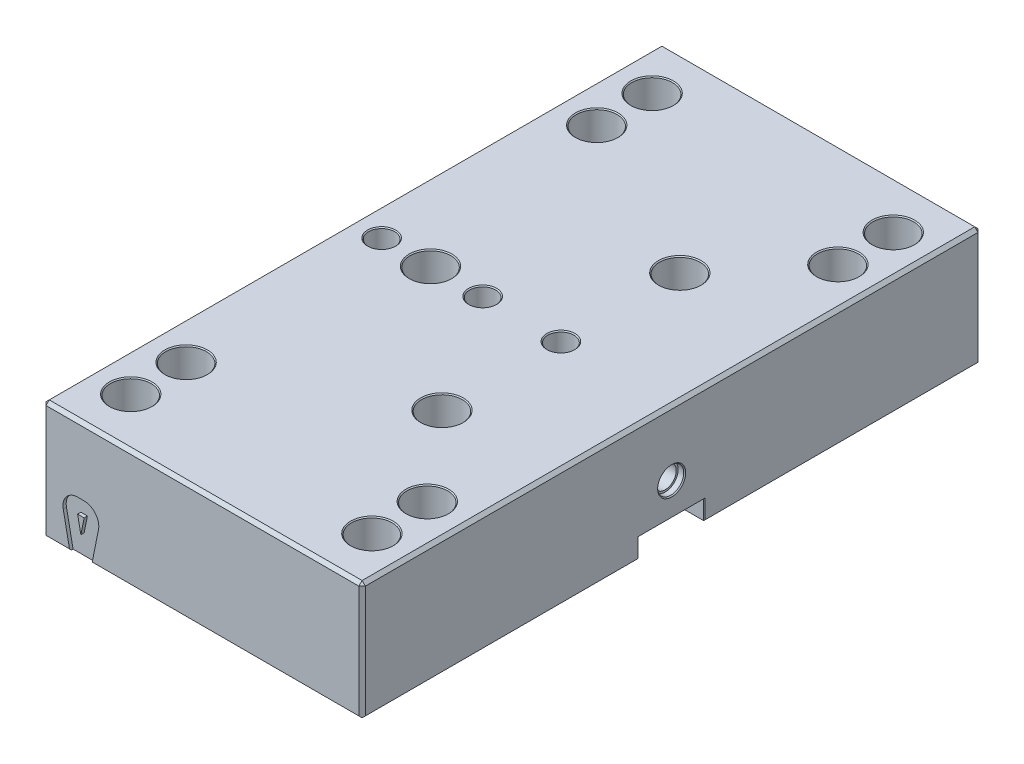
ISO-10303-21;
HEADER;
FILE_DESCRIPTION(('STEP AP214'),'2;1');
FILE_NAME('part.step','',(''),(''),'','','');
FILE_SCHEMA(('AUTOMOTIVE_DESIGN { 1 0 10303 214 1 1 1 1 }'));
ENDSEC;
DATA;
#1=APPLICATION_CONTEXT('core data for automotive mechanical design processes');
#2=APPLICATION_PROTOCOL_DEFINITION('international standard','automotive_design',2000,#1);
#3=PRODUCT_CONTEXT('',#1,'mechanical');
#4=PRODUCT('Part','Part','',(#3));
#5=PRODUCT_RELATED_PRODUCT_CATEGORY('part','',(#4));
#6=PRODUCT_DEFINITION_FORMATION('','',#4);
#7=PRODUCT_DEFINITION_CONTEXT('part definition',#1,'design');
#8=PRODUCT_DEFINITION('design','',#6,#7);
#9=PRODUCT_DEFINITION_SHAPE('','',#8);
#10=(LENGTH_UNIT() NAMED_UNIT(*) SI_UNIT(.MILLI.,.METRE.));
#11=(NAMED_UNIT(*) PLANE_ANGLE_UNIT() SI_UNIT($,.RADIAN.));
#12=(NAMED_UNIT(*) SI_UNIT($,.STERADIAN.) SOLID_ANGLE_UNIT());
#13=UNCERTAINTY_MEASURE_WITH_UNIT(LENGTH_MEASURE(1.E-05),#10,'distance_accuracy_value','');
#14=(GEOMETRIC_REPRESENTATION_CONTEXT(3) GLOBAL_UNCERTAINTY_ASSIGNED_CONTEXT((#13)) GLOBAL_UNIT_ASSIGNED_CONTEXT((#10,
#11,#12)) REPRESENTATION_CONTEXT('',''));
#15=CARTESIAN_POINT('',(0.,0.,0.));
#16=DIRECTION('',(0.,0.,1.));
#17=DIRECTION('',(1.,0.,0.));
#18=AXIS2_PLACEMENT_3D('',#15,#16,#17);
#19=CARTESIAN_POINT('',(-9.,36.,-95.));
#20=DIRECTION('',(0.,0.,1.));
#21=DIRECTION('',(1.,0.,0.));
#22=AXIS2_PLACEMENT_3D('',#19,#20,#21);
#23=PLANE('',#22);
#24=DIRECTION('',(0.196116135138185,0.98058067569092,0.));
#25=VECTOR('',#24,1.);
#26=CARTESIAN_POINT('',(8.11261304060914,10.1174773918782,-95.));
#27=LINE('',#26,#25);
#28=CARTESIAN_POINT('',(6.1891175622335,0.5,-95.));
#29=VERTEX_POINT('',#28);
#30=CARTESIAN_POINT('',(8.11261304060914,10.1174773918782,-95.));
#31=VERTEX_POINT('',#30);
#32=EDGE_CURVE('E322',#29,#31,#27,.T.);
#33=ORIENTED_EDGE('',*,*,#32,.T.);
#34=CARTESIAN_POINT('',(3.7,11.,-95.));
#35=DIRECTION('',(0.,0.,1.));
#36=DIRECTION('',(1.,0.,0.));
#37=AXIS2_PLACEMENT_3D('',#34,#35,#36);
#38=CIRCLE('',#37,4.5);
#39=CARTESIAN_POINT('',(3.7,15.5,-95.));
#40=VERTEX_POINT('',#39);
#41=EDGE_CURVE('E340',#31,#40,#38,.T.);
#42=ORIENTED_EDGE('',*,*,#41,.T.);
#43=DIRECTION('',(-1.,0.,0.));
#44=VECTOR('',#43,1.);
#45=CARTESIAN_POINT('',(1.7,15.5,-95.));
#46=LINE('',#45,#44);
#47=CARTESIAN_POINT('',(1.7,15.5,-95.));
#48=VERTEX_POINT('',#47);
#49=EDGE_CURVE('E337',#40,#48,#46,.T.);
#50=ORIENTED_EDGE('',*,*,#49,.T.);
#51=CARTESIAN_POINT('',(1.7,11.,-95.));
#52=DIRECTION('',(0.,0.,1.));
#53=DIRECTION('',(-1.,0.,0.));
#54=AXIS2_PLACEMENT_3D('',#51,#52,#53);
#55=CIRCLE('',#54,4.5);
#56=CARTESIAN_POINT('',(-2.71261304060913,10.1174773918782,-95.));
#57=VERTEX_POINT('',#56);
#58=EDGE_CURVE('E334',#48,#57,#55,.T.);
#59=ORIENTED_EDGE('',*,*,#58,.T.);
#60=DIRECTION('',(0.196116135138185,-0.98058067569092,0.));
#61=VECTOR('',#60,1.);
#62=CARTESIAN_POINT('',(-2.71261304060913,10.1174773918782,-95.));
#63=LINE('',#62,#61);
#64=CARTESIAN_POINT('',(-0.789117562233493,0.5,-95.));
#65=VERTEX_POINT('',#64);
#66=EDGE_CURVE('E316',#57,#65,#63,.T.);
#67=ORIENTED_EDGE('',*,*,#66,.T.);
#68=DIRECTION('',(-1.,0.,0.));
#69=VECTOR('',#68,1.);
#70=CARTESIAN_POINT('',(-9.,0.5,-95.));
#71=LINE('',#70,#69);
#72=CARTESIAN_POINT('',(-8.,0.5,-95.));
#73=VERTEX_POINT('',#72);
#74=EDGE_CURVE('E1050',#65,#73,#71,.T.);
#75=ORIENTED_EDGE('',*,*,#74,.T.);
#76=DIRECTION('',(0.,1.,0.));
#77=VECTOR('',#76,1.);
#78=CARTESIAN_POINT('',(-8.,36.,-95.));
#79=LINE('',#78,#77);
#80=CARTESIAN_POINT('',(-8.,35.,-95.));
#81=VERTEX_POINT('',#80);
#82=EDGE_CURVE('E1188',#73,#81,#79,.T.);
#83=ORIENTED_EDGE('',*,*,#82,.T.);
#84=DIRECTION('',(1.,0.,0.));
#85=VECTOR('',#84,1.);
#86=CARTESIAN_POINT('',(89.,35.,-95.));
#87=LINE('',#86,#85);
#88=CARTESIAN_POINT('',(88.,35.,-95.));
#89=VERTEX_POINT('',#88);
#90=EDGE_CURVE('E1183',#81,#89,#87,.T.);
#91=ORIENTED_EDGE('',*,*,#90,.T.);
#92=DIRECTION('',(0.,-1.,0.));
#93=VECTOR('',#92,1.);
#94=CARTESIAN_POINT('',(88.,36.,-95.));
#95=LINE('',#94,#93);
#96=CARTESIAN_POINT('',(88.,0.5,-95.));
#97=VERTEX_POINT('',#96);
#98=EDGE_CURVE('E1185',#89,#97,#95,.T.);
#99=ORIENTED_EDGE('',*,*,#98,.T.);
#100=EDGE_CURVE('E1067',#97,#29,#71,.T.);
#101=ORIENTED_EDGE('',*,*,#100,.T.);
#102=EDGE_LOOP('',(#33,#42,#50,#59,#67,#75,#83,#91,#99,#101));
#103=FACE_BOUND('',#102,.T.);
#104=ADVANCED_FACE('F14',(#103),#23,.F.);
#105=CARTESIAN_POINT('',(-9.,0.,95.));
#106=DIRECTION('',(0.,1.,0.));
#107=DIRECTION('',(0.,0.,1.));
#108=AXIS2_PLACEMENT_3D('',#105,#106,#107);
#109=PLANE('',#108);
#110=CARTESIAN_POINT('',(0.,0.,0.));
#111=DIRECTION('',(0.,1.,0.));
#112=DIRECTION('',(0.,0.,1.));
#113=AXIS2_PLACEMENT_3D('',#110,#111,#112);
#114=CIRCLE('',#113,4.2);
#115=CARTESIAN_POINT('',(0.,0.,4.2));
#116=VERTEX_POINT('',#115);
#117=EDGE_CURVE('E638',#116,#116,#114,.T.);
#118=ORIENTED_EDGE('',*,*,#117,.T.);
#119=EDGE_LOOP('',(#118));
#120=FACE_BOUND('',#119,.T.);
#121=CARTESIAN_POINT('',(55.,0.,-36.5));
#122=DIRECTION('',(0.,-1.,0.));
#123=DIRECTION('',(0.,0.,-1.));
#124=AXIS2_PLACEMENT_3D('',#121,#122,#123);
#125=CIRCLE('',#124,10.3);
#126=CARTESIAN_POINT('',(55.,0.,-46.8));
#127=VERTEX_POINT('',#126);
#128=EDGE_CURVE('E581',#127,#127,#125,.T.);
#129=ORIENTED_EDGE('',*,*,#128,.F.);
#130=EDGE_LOOP('',(#129));
#131=FACE_BOUND('',#130,.T.);
#132=CARTESIAN_POINT('',(55.,0.,36.5));
#133=DIRECTION('',(0.,-1.,0.));
#134=DIRECTION('',(0.,0.,-1.));
#135=AXIS2_PLACEMENT_3D('',#132,#133,#134);
#136=CIRCLE('',#135,10.3);
#137=CARTESIAN_POINT('',(55.,0.,26.2));
#138=VERTEX_POINT('',#137);
#139=EDGE_CURVE('E563',#138,#138,#136,.T.);
#140=ORIENTED_EDGE('',*,*,#139,.F.);
#141=EDGE_LOOP('',(#140));
#142=FACE_BOUND('',#141,.T.);
#143=CARTESIAN_POINT('',(77.,0.,80.));
#144=DIRECTION('',(0.,1.,0.));
#145=DIRECTION('',(0.,0.,1.));
#146=AXIS2_PLACEMENT_3D('',#143,#144,#145);
#147=CIRCLE('',#146,6.55);
#148=CARTESIAN_POINT('',(77.,0.,86.55));
#149=VERTEX_POINT('',#148);
#150=EDGE_CURVE('E560',#149,#149,#147,.T.);
#151=ORIENTED_EDGE('',*,*,#150,.T.);
#152=EDGE_LOOP('',(#151));
#153=FACE_BOUND('',#152,.T.);
#154=CARTESIAN_POINT('',(3.,0.,80.));
#155=DIRECTION('',(0.,1.,0.));
#156=DIRECTION('',(0.,0.,1.));
#157=AXIS2_PLACEMENT_3D('',#154,#155,#156);
#158=CIRCLE('',#157,6.55);
#159=CARTESIAN_POINT('',(3.,0.,86.55));
#160=VERTEX_POINT('',#159);
#161=EDGE_CURVE('E548',#160,#160,#158,.T.);
#162=ORIENTED_EDGE('',*,*,#161,.T.);
#163=EDGE_LOOP('',(#162));
#164=FACE_BOUND('',#163,.T.);
#165=CARTESIAN_POINT('',(77.,0.,-80.));
#166=DIRECTION('',(0.,1.,0.));
#167=DIRECTION('',(0.,0.,1.));
#168=AXIS2_PLACEMENT_3D('',#165,#166,#167);
#169=CIRCLE('',#168,6.55);
#170=CARTESIAN_POINT('',(77.,0.,-73.45));
#171=VERTEX_POINT('',#170);
#172=EDGE_CURVE('E536',#171,#171,#169,.T.);
#173=ORIENTED_EDGE('',*,*,#172,.T.);
#174=EDGE_LOOP('',(#173));
#175=FACE_BOUND('',#174,.T.);
#176=CARTESIAN_POINT('',(3.,0.,-80.));
#177=DIRECTION('',(0.,1.,0.));
#178=DIRECTION('',(0.,0.,1.));
#179=AXIS2_PLACEMENT_3D('',#176,#177,#178);
#180=CIRCLE('',#179,6.55);
#181=CARTESIAN_POINT('',(3.,0.,-73.45));
#182=VERTEX_POINT('',#181);
#183=EDGE_CURVE('E524',#182,#182,#180,.T.);
#184=ORIENTED_EDGE('',*,*,#183,.T.);
#185=EDGE_LOOP('',(#184));
#186=FACE_BOUND('',#185,.T.);
#187=CARTESIAN_POINT('',(77.,0.,-63.));
#188=DIRECTION('',(0.,1.,0.));
#189=DIRECTION('',(0.,0.,1.));
#190=AXIS2_PLACEMENT_3D('',#187,#188,#189);
#191=CIRCLE('',#190,6.55);
#192=CARTESIAN_POINT('',(77.,0.,-56.45));
#193=VERTEX_POINT('',#192);
#194=EDGE_CURVE('E512',#193,#193,#191,.T.);
#195=ORIENTED_EDGE('',*,*,#194,.T.);
#196=EDGE_LOOP('',(#195));
#197=FACE_BOUND('',#196,.T.);
#198=CARTESIAN_POINT('',(77.,0.,63.));
#199=DIRECTION('',(0.,1.,0.));
#200=DIRECTION('',(0.,0.,1.));
#201=AXIS2_PLACEMENT_3D('',#198,#199,#200);
#202=CIRCLE('',#201,6.55);
#203=CARTESIAN_POINT('',(77.,0.,69.55));
#204=VERTEX_POINT('',#203);
#205=EDGE_CURVE('E500',#204,#204,#202,.T.);
#206=ORIENTED_EDGE('',*,*,#205,.T.);
#207=EDGE_LOOP('',(#206));
#208=FACE_BOUND('',#207,.T.);
#209=CARTESIAN_POINT('',(3.,0.,63.));
#210=DIRECTION('',(0.,1.,0.));
#211=DIRECTION('',(0.,0.,1.));
#212=AXIS2_PLACEMENT_3D('',#209,#210,#211);
#213=CIRCLE('',#212,6.55);
#214=CARTESIAN_POINT('',(3.,0.,69.55));
#215=VERTEX_POINT('',#214);
#216=EDGE_CURVE('E488',#215,#215,#213,.T.);
#217=ORIENTED_EDGE('',*,*,#216,.T.);
#218=EDGE_LOOP('',(#217));
#219=FACE_BOUND('',#218,.T.);
#220=CARTESIAN_POINT('',(3.,0.,-63.));
#221=DIRECTION('',(0.,1.,0.));
#222=DIRECTION('',(0.,0.,1.));
#223=AXIS2_PLACEMENT_3D('',#220,#221,#222);
#224=CIRCLE('',#223,6.55);
#225=CARTESIAN_POINT('',(3.,0.,-56.45));
#226=VERTEX_POINT('',#225);
#227=EDGE_CURVE('E476',#226,#226,#224,.T.);
#228=ORIENTED_EDGE('',*,*,#227,.T.);
#229=EDGE_LOOP('',(#228));
#230=FACE_BOUND('',#229,.T.);
#231=DIRECTION('',(0.,0.,-1.));
#232=VECTOR('',#231,1.);
#233=CARTESIAN_POINT('',(6.0891175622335,0.,-94.));
#234=LINE('',#233,#232);
#235=CARTESIAN_POINT('',(6.0891175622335,0.,-94.));
#236=VERTEX_POINT('',#235);
#237=CARTESIAN_POINT('',(6.0891175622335,0.,-94.5));
#238=VERTEX_POINT('',#237);
#239=EDGE_CURVE('E345',#236,#238,#234,.T.);
#240=ORIENTED_EDGE('',*,*,#239,.T.);
#241=DIRECTION('',(1.,0.,0.));
#242=VECTOR('',#241,1.);
#243=CARTESIAN_POINT('',(-9.,0.,-94.5));
#244=LINE('',#243,#242);
#245=CARTESIAN_POINT('',(88.5,0.,-94.5));
#246=VERTEX_POINT('',#245);
#247=EDGE_CURVE('E1057',#238,#246,#244,.T.);
#248=ORIENTED_EDGE('',*,*,#247,.T.);
#249=DIRECTION('',(0.,0.,1.));
#250=VECTOR('',#249,1.);
#251=CARTESIAN_POINT('',(88.5,0.,95.));
#252=LINE('',#251,#250);
#253=CARTESIAN_POINT('',(88.5,0.,-10.3));
#254=VERTEX_POINT('',#253);
#255=EDGE_CURVE('E1056',#246,#254,#252,.T.);
#256=ORIENTED_EDGE('',*,*,#255,.T.);
#257=DIRECTION('',(-1.,0.,0.));
#258=VECTOR('',#257,1.);
#259=CARTESIAN_POINT('',(-9.,0.,-10.3));
#260=LINE('',#259,#258);
#261=CARTESIAN_POINT('',(15.,0.,-10.3));
#262=VERTEX_POINT('',#261);
#263=EDGE_CURVE('E1109',#254,#262,#260,.T.);
#264=ORIENTED_EDGE('',*,*,#263,.T.);
#265=CARTESIAN_POINT('',(15.,0.,0.));
#266=DIRECTION('',(0.,-1.,0.));
#267=DIRECTION('',(0.,0.,-1.));
#268=AXIS2_PLACEMENT_3D('',#265,#266,#267);
#269=CIRCLE('',#268,10.3);
#270=CARTESIAN_POINT('',(15.,0.,10.3));
#271=VERTEX_POINT('',#270);
#272=EDGE_CURVE('E599',#271,#262,#269,.T.);
#273=ORIENTED_EDGE('',*,*,#272,.F.);
#274=DIRECTION('',(1.,0.,0.));
#275=VECTOR('',#274,1.);
#276=CARTESIAN_POINT('',(-9.,0.,10.3));
#277=LINE('',#276,#275);
#278=CARTESIAN_POINT('',(88.5,0.,10.3));
#279=VERTEX_POINT('',#278);
#280=EDGE_CURVE('E1097',#271,#279,#277,.T.);
#281=ORIENTED_EDGE('',*,*,#280,.T.);
#282=DIRECTION('',(0.,0.,1.));
#283=VECTOR('',#282,1.);
#284=CARTESIAN_POINT('',(88.5,0.,95.));
#285=LINE('',#284,#283);
#286=CARTESIAN_POINT('',(88.5,0.,94.5));
#287=VERTEX_POINT('',#286);
#288=EDGE_CURVE('E1106',#279,#287,#285,.T.);
#289=ORIENTED_EDGE('',*,*,#288,.T.);
#290=DIRECTION('',(-1.,0.,0.));
#291=VECTOR('',#290,1.);
#292=CARTESIAN_POINT('',(-9.,0.,94.5));
#293=LINE('',#292,#291);
#294=CARTESIAN_POINT('',(6.0891175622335,0.,94.5));
#295=VERTEX_POINT('',#294);
#296=EDGE_CURVE('E1116',#287,#295,#293,.T.);
#297=ORIENTED_EDGE('',*,*,#296,.T.);
#298=DIRECTION('',(0.,0.,1.));
#299=VECTOR('',#298,1.);
#300=CARTESIAN_POINT('',(6.0891175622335,0.,94.));
#301=LINE('',#300,#299);
#302=CARTESIAN_POINT('',(6.0891175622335,0.,94.));
#303=VERTEX_POINT('',#302);
#304=EDGE_CURVE('E402',#303,#295,#301,.T.);
#305=ORIENTED_EDGE('',*,*,#304,.F.);
#306=DIRECTION('',(1.,0.,0.));
#307=VECTOR('',#306,1.);
#308=CARTESIAN_POINT('',(-0.689117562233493,0.,94.));
#309=LINE('',#308,#307);
#310=CARTESIAN_POINT('',(-0.689117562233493,0.,94.));
#311=VERTEX_POINT('',#310);
#312=EDGE_CURVE('E383',#311,#303,#309,.T.);
#313=ORIENTED_EDGE('',*,*,#312,.F.);
#314=DIRECTION('',(0.,0.,1.));
#315=VECTOR('',#314,1.);
#316=CARTESIAN_POINT('',(-0.689117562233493,0.,94.));
#317=LINE('',#316,#315);
#318=CARTESIAN_POINT('',(-0.689117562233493,0.,94.5));
#319=VERTEX_POINT('',#318);
#320=EDGE_CURVE('E414',#311,#319,#317,.T.);
#321=ORIENTED_EDGE('',*,*,#320,.T.);
#322=CARTESIAN_POINT('',(-8.5,0.,94.5));
#323=VERTEX_POINT('',#322);
#324=EDGE_CURVE('E1113',#319,#323,#293,.T.);
#325=ORIENTED_EDGE('',*,*,#324,.T.);
#326=DIRECTION('',(0.,0.,-1.));
#327=VECTOR('',#326,1.);
#328=CARTESIAN_POINT('',(-8.5,0.,95.));
#329=LINE('',#328,#327);
#330=CARTESIAN_POINT('',(-8.5,0.,-94.5));
#331=VERTEX_POINT('',#330);
#332=EDGE_CURVE('E1055',#323,#331,#329,.T.);
#333=ORIENTED_EDGE('',*,*,#332,.T.);
#334=CARTESIAN_POINT('',(-0.689117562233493,0.,-94.5));
#335=VERTEX_POINT('',#334);
#336=EDGE_CURVE('E1048',#331,#335,#244,.T.);
#337=ORIENTED_EDGE('',*,*,#336,.T.);
#338=DIRECTION('',(0.,0.,-1.));
#339=VECTOR('',#338,1.);
#340=CARTESIAN_POINT('',(-0.689117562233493,0.,-94.));
#341=LINE('',#340,#339);
#342=CARTESIAN_POINT('',(-0.689117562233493,0.,-94.));
#343=VERTEX_POINT('',#342);
#344=EDGE_CURVE('E37',#343,#335,#341,.T.);
#345=ORIENTED_EDGE('',*,*,#344,.F.);
#346=DIRECTION('',(1.,0.,0.));
#347=VECTOR('',#346,1.);
#348=CARTESIAN_POINT('',(-0.689117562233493,0.,-94.));
#349=LINE('',#348,#347);
#350=EDGE_CURVE('E318',#343,#236,#349,.T.);
#351=ORIENTED_EDGE('',*,*,#350,.T.);
#352=EDGE_LOOP('',(#240,#248,#256,#264,#273,#281,#289,#297,#305,#313,#321,#325,#333,#337,#345,#351));
#353=FACE_BOUND('',#352,.T.);
#354=ADVANCED_FACE('F887',(#120,#131,#142,#153,#164,#175,#186,#197,#208,#219,#230,#353),#109,.F.);
#355=CARTESIAN_POINT('',(-9.,0.5,-95.));
#356=DIRECTION('',(0.,0.707106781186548,0.707106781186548));
#357=DIRECTION('',(0.,-0.707106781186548,0.707106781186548));
#358=AXIS2_PLACEMENT_3D('',#355,#356,#357);
#359=PLANE('',#358);
#360=ORIENTED_EDGE('',*,*,#247,.F.);
#361=DIRECTION('',(-0.140028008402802,-0.700140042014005,0.700140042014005));
#362=VECTOR('',#361,1.);
#363=CARTESIAN_POINT('',(5.8912917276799,-0.989129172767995,-93.510870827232));
#364=LINE('',#363,#362);
#365=EDGE_CURVE('E9',#238,#29,#364,.F.);
#366=ORIENTED_EDGE('',*,*,#365,.T.);
#367=ORIENTED_EDGE('',*,*,#100,.F.);
#368=DIRECTION('',(-0.577350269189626,0.577350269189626,-0.577350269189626));
#369=VECTOR('',#368,1.);
#370=CARTESIAN_POINT('',(76.1666666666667,12.3333333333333,-106.833333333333));
#371=LINE('',#370,#369);
#372=EDGE_CURVE('E1118',#246,#97,#371,.T.);
#373=ORIENTED_EDGE('',*,*,#372,.F.);
#374=EDGE_LOOP('',(#360,#366,#367,#373));
#375=FACE_BOUND('',#374,.T.);
#376=ADVANCED_FACE('F894',(#375),#359,.F.);
#377=ORIENTED_EDGE('',*,*,#74,.F.);
#378=DIRECTION('',(-0.140028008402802,0.700140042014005,-0.700140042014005));
#379=VECTOR('',#378,1.);
#380=CARTESIAN_POINT('',(-0.950115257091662,1.30498847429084,-95.8049884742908));
#381=LINE('',#380,#379);
#382=EDGE_CURVE('E22',#65,#335,#381,.F.);
#383=ORIENTED_EDGE('',*,*,#382,.T.);
#384=ORIENTED_EDGE('',*,*,#336,.F.);
#385=DIRECTION('',(-0.577350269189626,-0.577350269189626,0.577350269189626));
#386=VECTOR('',#385,1.);
#387=CARTESIAN_POINT('',(3.16666666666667,11.6666666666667,-106.166666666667));
#388=LINE('',#387,#386);
#389=EDGE_CURVE('E1072',#73,#331,#388,.T.);
#390=ORIENTED_EDGE('',*,*,#389,.F.);
#391=EDGE_LOOP('',(#377,#383,#384,#390));
#392=FACE_BOUND('',#391,.T.);
#393=ADVANCED_FACE('F1046',(#392),#359,.F.);
#394=CARTESIAN_POINT('',(-9.,0.5,95.));
#395=DIRECTION('',(0.,0.707106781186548,-0.707106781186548));
#396=DIRECTION('',(0.,0.707106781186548,0.707106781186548));
#397=AXIS2_PLACEMENT_3D('',#394,#395,#396);
#398=PLANE('',#397);
#399=DIRECTION('',(-0.140028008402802,0.700140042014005,0.700140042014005));
#400=VECTOR('',#399,1.);
#401=CARTESIAN_POINT('',(-0.950115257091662,1.30498847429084,95.8049884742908));
#402=LINE('',#401,#400);
#403=CARTESIAN_POINT('',(-0.789117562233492,0.5,95.));
#404=VERTEX_POINT('',#403);
#405=EDGE_CURVE('E1041',#404,#319,#402,.F.);
#406=ORIENTED_EDGE('',*,*,#405,.F.);
#407=DIRECTION('',(1.,0.,0.));
#408=VECTOR('',#407,1.);
#409=CARTESIAN_POINT('',(-9.,0.5,95.));
#410=LINE('',#409,#408);
#411=CARTESIAN_POINT('',(-8.,0.5,95.));
#412=VERTEX_POINT('',#411);
#413=EDGE_CURVE('E1083',#412,#404,#410,.T.);
#414=ORIENTED_EDGE('',*,*,#413,.F.);
#415=DIRECTION('',(0.577350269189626,0.577350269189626,0.577350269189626));
#416=VECTOR('',#415,1.);
#417=CARTESIAN_POINT('',(3.83333333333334,12.3333333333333,106.833333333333));
#418=LINE('',#417,#416);
#419=EDGE_CURVE('E1077',#323,#412,#418,.T.);
#420=ORIENTED_EDGE('',*,*,#419,.F.);
#421=ORIENTED_EDGE('',*,*,#324,.F.);
#422=EDGE_LOOP('',(#406,#414,#420,#421));
#423=FACE_BOUND('',#422,.T.);
#424=ADVANCED_FACE('F883',(#423),#398,.F.);
#425=CARTESIAN_POINT('',(-9.,16.,0.));
#426=DIRECTION('',(-1.,0.,0.));
#427=DIRECTION('',(0.,0.,1.));
#428=AXIS2_PLACEMENT_3D('',#425,#426,#427);
#429=CYLINDRICAL_SURFACE('',#428,3.4);
#430=CARTESIAN_POINT('',(-1.91049731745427,16.,3.4));
#431=CARTESIAN_POINT('',(-1.91051738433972,16.1102915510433,3.39999326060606));
#432=CARTESIAN_POINT('',(-1.92026234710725,16.2206291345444,3.3945667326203));
#433=CARTESIAN_POINT('',(-1.95699230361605,16.43747755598,3.37351247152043));
#434=CARTESIAN_POINT('',(-1.98402888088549,16.5439759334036,3.35785421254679));
#435=CARTESIAN_POINT('',(-2.06506952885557,16.7965936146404,3.30885790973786));
#436=CARTESIAN_POINT('',(-2.12570226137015,16.9395745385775,3.27077556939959));
#437=CARTESIAN_POINT('',(-2.26036967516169,17.2139406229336,3.17921460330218));
#438=CARTESIAN_POINT('',(-2.33445459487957,17.3452794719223,3.12567780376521));
#439=CARTESIAN_POINT('',(-2.47216532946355,17.5708977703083,3.01735158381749));
#440=CARTESIAN_POINT('',(-2.53469743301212,17.6671474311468,2.96521255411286));
#441=CARTESIAN_POINT('',(-2.66106994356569,17.8536477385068,2.85234719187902));
#442=CARTESIAN_POINT('',(-2.72491103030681,17.94389515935,2.79161629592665));
#443=CARTESIAN_POINT('',(-2.85196312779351,18.1183118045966,2.66168312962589));
#444=CARTESIAN_POINT('',(-2.91517485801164,18.2024888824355,2.59249212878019));
#445=CARTESIAN_POINT('',(-3.03953451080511,18.3646287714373,2.44550711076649));
#446=CARTESIAN_POINT('',(-3.10068225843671,18.4425910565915,2.36771236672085));
#447=CARTESIAN_POINT('',(-3.25163235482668,18.6321020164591,2.15899603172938));
#448=CARTESIAN_POINT('',(-3.33908092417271,18.7390581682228,2.0220680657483));
#449=CARTESIAN_POINT('',(-3.50032324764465,18.9334588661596,1.72793871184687));
#450=CARTESIAN_POINT('',(-3.57414003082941,19.0209363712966,1.57077229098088));
#451=CARTESIAN_POINT('',(-3.69063031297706,19.1578131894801,1.26898339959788));
#452=CARTESIAN_POINT('',(-3.73654299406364,19.2112691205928,1.12746878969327));
#453=CARTESIAN_POINT('',(-3.8126332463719,19.2994959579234,0.834657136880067));
#454=CARTESIAN_POINT('',(-3.84282015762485,19.3342779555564,0.683365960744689));
#455=CARTESIAN_POINT('',(-3.88516414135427,19.3829939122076,0.374111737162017));
#456=CARTESIAN_POINT('',(-3.89722781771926,19.3968198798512,0.216118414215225));
#457=CARTESIAN_POINT('',(-3.90191570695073,19.4021976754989,-0.100531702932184));
#458=CARTESIAN_POINT('',(-3.89454330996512,19.3937533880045,-0.259188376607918));
#459=CARTESIAN_POINT('',(-3.86247372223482,19.3568995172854,-0.558644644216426));
#460=CARTESIAN_POINT('',(-3.83927651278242,19.3302181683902,-0.699828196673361));
#461=CARTESIAN_POINT('',(-3.77882457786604,19.26034055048,-0.974846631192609));
#462=CARTESIAN_POINT('',(-3.74156736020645,19.217141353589,-1.10868020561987));
#463=CARTESIAN_POINT('',(-3.65222252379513,19.1127980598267,-1.37566312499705));
#464=CARTESIAN_POINT('',(-3.59928246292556,19.0506133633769,-1.50811508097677));
#465=CARTESIAN_POINT('',(-3.48285208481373,18.9123246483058,-1.76042745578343));
#466=CARTESIAN_POINT('',(-3.41935531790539,18.8362121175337,-1.88028010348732));
#467=CARTESIAN_POINT('',(-3.24986562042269,18.6299715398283,-2.16521518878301));
#468=CARTESIAN_POINT('',(-3.13881594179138,18.4921995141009,-2.32184458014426));
#469=CARTESIAN_POINT('',(-2.96594342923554,18.2691402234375,-2.53408624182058));
#470=CARTESIAN_POINT('',(-2.90715498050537,18.1918954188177,-2.60115262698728));
#471=CARTESIAN_POINT('',(-2.78866079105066,18.0321213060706,-2.72779499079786));
#472=CARTESIAN_POINT('',(-2.72895530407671,17.9495934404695,-2.78737300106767));
#473=CARTESIAN_POINT('',(-2.61919883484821,17.7924437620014,-2.89042614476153));
#474=CARTESIAN_POINT('',(-2.56907837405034,17.7185643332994,-2.93496782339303));
#475=CARTESIAN_POINT('',(-2.47019277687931,17.5668966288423,-3.01866520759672));
#476=CARTESIAN_POINT('',(-2.42142798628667,17.4891073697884,-3.0578195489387));
#477=CARTESIAN_POINT('',(-2.32673262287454,17.3295854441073,-3.13047350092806));
#478=CARTESIAN_POINT('',(-2.28079462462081,17.2478642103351,-3.16398836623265));
#479=CARTESIAN_POINT('',(-2.19344929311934,17.0799799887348,-3.22515409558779));
#480=CARTESIAN_POINT('',(-2.15203822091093,16.9938207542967,-3.25280981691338));
#481=CARTESIAN_POINT('',(-2.07276963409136,16.8086921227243,-3.3039435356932));
#482=CARTESIAN_POINT('',(-2.03556416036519,16.7092669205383,-3.3268241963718));
#483=CARTESIAN_POINT('',(-1.97376290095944,16.5051069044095,-3.36386309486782));
#484=CARTESIAN_POINT('',(-1.94913484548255,16.4003864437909,-3.37804367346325));
#485=CARTESIAN_POINT('',(-1.91659508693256,16.1860155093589,-3.3966248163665));
#486=CARTESIAN_POINT('',(-1.90889175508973,16.0763203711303,-3.4009035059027));
#487=CARTESIAN_POINT('',(-1.91267835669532,15.8573611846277,-3.39877309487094));
#488=CARTESIAN_POINT('',(-1.92417530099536,15.7480973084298,-3.3923600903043));
#489=CARTESIAN_POINT('',(-1.96639951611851,15.5192358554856,-3.36807088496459));
#490=CARTESIAN_POINT('',(-1.99953845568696,15.4002647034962,-3.3487488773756));
#491=CARTESIAN_POINT('',(-2.08032405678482,15.1696027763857,-3.29916219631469));
#492=CARTESIAN_POINT('',(-2.12802529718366,15.0579413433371,-3.26885627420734));
#493=CARTESIAN_POINT('',(-2.22503763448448,14.8565544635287,-3.20346238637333));
#494=CARTESIAN_POINT('',(-2.27326951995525,14.7658984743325,-3.16956563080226));
#495=CARTESIAN_POINT('',(-2.37362759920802,14.5895499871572,-3.09512487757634));
#496=CARTESIAN_POINT('',(-2.42575657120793,14.5038611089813,-3.05457611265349));
#497=CARTESIAN_POINT('',(-2.53207998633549,14.3370024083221,-2.96703967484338));
#498=CARTESIAN_POINT('',(-2.58627725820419,14.2558391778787,-2.92004293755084));
#499=CARTESIAN_POINT('',(-2.69526651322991,14.097970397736,-2.8197563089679));
#500=CARTESIAN_POINT('',(-2.75005834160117,14.021263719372,-2.7664680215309));
#501=CARTESIAN_POINT('',(-2.8630417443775,13.8669355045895,-2.64953956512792));
#502=CARTESIAN_POINT('',(-2.92119698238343,13.789639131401,-2.58543208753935));
#503=CARTESIAN_POINT('',(-3.03574271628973,13.6403356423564,-2.44992980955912));
#504=CARTESIAN_POINT('',(-3.09213288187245,13.5683295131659,-2.37853365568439));
#505=CARTESIAN_POINT('',(-3.25676011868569,13.3611433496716,-2.15357892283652));
#506=CARTESIAN_POINT('',(-3.3608526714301,13.2342664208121,-1.98885798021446));
#507=CARTESIAN_POINT('',(-3.52341614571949,13.0391748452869,-1.67853455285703));
#508=CARTESIAN_POINT('',(-3.5866434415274,12.9643459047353,-1.53959741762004));
#509=CARTESIAN_POINT('',(-3.67038543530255,12.8659891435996,-1.32075244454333));
#510=CARTESIAN_POINT('',(-3.69645523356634,12.8355115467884,-1.24604232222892));
#511=CARTESIAN_POINT('',(-3.74442253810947,12.7796108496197,-1.09347429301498));
#512=CARTESIAN_POINT('',(-3.76632180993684,12.7541856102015,-1.01561773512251));
#513=CARTESIAN_POINT('',(-3.80568435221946,12.7085919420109,-0.856472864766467));
#514=CARTESIAN_POINT('',(-3.82310574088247,12.6884731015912,-0.775159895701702));
#515=CARTESIAN_POINT('',(-3.85284329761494,12.6541855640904,-0.610410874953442));
#516=CARTESIAN_POINT('',(-3.86516209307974,12.6400138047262,-0.526975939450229));
#517=CARTESIAN_POINT('',(-3.88439235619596,12.6179097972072,-0.358690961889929));
#518=CARTESIAN_POINT('',(-3.89130599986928,12.6099750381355,-0.273841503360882));
#519=CARTESIAN_POINT('',(-3.8995590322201,12.6005052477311,-0.103546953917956));
#520=CARTESIAN_POINT('',(-3.90089913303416,12.5989693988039,-0.0181019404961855));
#521=CARTESIAN_POINT('',(-3.89684628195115,12.6036162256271,0.215786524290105));
#522=CARTESIAN_POINT('',(-3.8857410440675,12.6163470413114,0.364088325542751));
#523=CARTESIAN_POINT('',(-3.84732259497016,12.6605381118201,0.655581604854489));
#524=CARTESIAN_POINT('',(-3.82000805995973,12.6919998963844,0.798772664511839));
#525=CARTESIAN_POINT('',(-3.75119379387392,12.7717092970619,1.07656797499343));
#526=CARTESIAN_POINT('',(-3.70970970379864,12.8199384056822,1.21118150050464));
#527=CARTESIAN_POINT('',(-3.61505979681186,12.9308817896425,1.46981678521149));
#528=CARTESIAN_POINT('',(-3.56188891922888,12.9936023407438,1.5938339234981));
#529=CARTESIAN_POINT('',(-3.4198113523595,13.1630706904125,1.88459593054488));
#530=CARTESIAN_POINT('',(-3.32571088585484,13.27680584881,2.04478746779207));
#531=CARTESIAN_POINT('',(-3.17570153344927,13.4629904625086,2.26559451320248));
#532=CARTESIAN_POINT('',(-3.12412488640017,13.5277748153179,2.33605523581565));
#533=CARTESIAN_POINT('',(-3.01889570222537,13.662162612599,2.47053378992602));
#534=CARTESIAN_POINT('',(-2.9652438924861,13.7317643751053,2.53455385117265));
#535=CARTESIAN_POINT('',(-2.85568008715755,13.8769764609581,2.65744451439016));
#536=CARTESIAN_POINT('',(-2.79974429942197,13.9526810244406,2.71618186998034));
#537=CARTESIAN_POINT('',(-2.68777203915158,14.1086852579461,2.82702698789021));
#538=CARTESIAN_POINT('',(-2.6317356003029,14.188983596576,2.87913665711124));
#539=CARTESIAN_POINT('',(-2.5208848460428,14.3542118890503,2.97667264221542));
#540=CARTESIAN_POINT('',(-2.46606937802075,14.4391371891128,3.02210550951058));
#541=CARTESIAN_POINT('',(-2.35930818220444,14.6139544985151,3.10616760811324));
#542=CARTESIAN_POINT('',(-2.30736071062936,14.7038434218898,3.14480100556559));
#543=CARTESIAN_POINT('',(-2.20193846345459,14.9016002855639,3.21965361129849));
#544=CARTESIAN_POINT('',(-2.14919773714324,15.0102604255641,3.25484950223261));
#545=CARTESIAN_POINT('',(-2.05538619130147,15.2351665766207,3.3148897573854));
#546=CARTESIAN_POINT('',(-2.01428476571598,15.3513916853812,3.33976135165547));
#547=CARTESIAN_POINT('',(-1.95952696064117,15.5566911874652,3.3720876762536));
#548=CARTESIAN_POINT('',(-1.94138836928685,15.6440744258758,3.38248508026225));
#549=CARTESIAN_POINT('',(-1.91687343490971,15.8209637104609,3.39643930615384));
#550=CARTESIAN_POINT('',(-1.91048102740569,15.9104666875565,3.40000547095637));
#551=CARTESIAN_POINT('',(-1.91049731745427,16.,3.4));
#552=B_SPLINE_CURVE_WITH_KNOTS('',3,(#430,#431,#432,#433,#434,#435,#436,#437,#438,#439,#440,
#441,#442,#443,#444,#445,#446,#447,#448,#449,#450,#451,#452,#453,#454,#455,#456,#457,#458,#459,
#460,#461,#462,#463,#464,#465,#466,#467,#468,#469,#470,#471,#472,#473,#474,#475,#476,#477,#478,
#479,#480,#481,#482,#483,#484,#485,#486,#487,#488,#489,#490,#491,#492,#493,#494,#495,#496,#497,
#498,#499,#500,#501,#502,#503,#504,#505,#506,#507,#508,#509,#510,#511,#512,#513,#514,#515,#516,
#517,#518,#519,#520,#521,#522,#523,#524,#525,#526,#527,#528,#529,#530,#531,#532,#533,#534,#535,
#536,#537,#538,#539,#540,#541,#542,#543,#544,#545,#546,#547,#548,#549,#550,#551),.UNSPECIFIED.,
.T.,.F.,(4,2,2,2,2,2,2,2,2,2,2,2,2,2,2,2,2,2,2,2,2,2,2,2,2,2,2,2,2,2,2,2,2,2,2,2,2,2,2,2,2,2,2,
2,2,2,2,2,2,2,2,2,2,2,2,2,2,2,2,2,4),(0.,0.330474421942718,0.66193932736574,1.13896340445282,
1.61780705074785,1.99556297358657,2.37352029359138,2.75097952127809,3.12847066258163,
3.70977249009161,4.2900831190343,4.76240915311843,5.23445433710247,5.70892390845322,
6.18331072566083,6.6180361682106,7.05283870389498,7.51793624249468,7.98331898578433,
8.68812654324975,9.04184133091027,9.39545994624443,9.69456710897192,9.99374987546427,
10.2921098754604,10.590221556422,10.9150762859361,11.2390932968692,11.5670776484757,
11.8951817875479,12.2680913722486,12.6424161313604,12.9664004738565,13.2906180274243,
13.6152961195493,13.9398916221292,14.2876450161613,14.6354631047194,15.3288092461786,
15.8367584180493,16.0908724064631,16.3448785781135,16.6011804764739,16.8573502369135,
17.1134168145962,17.3694506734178,17.8148317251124,18.2602491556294,18.7051764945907,
19.1502968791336,19.7999607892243,20.1259242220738,20.4517744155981,20.784337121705,
21.1168039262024,21.4489422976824,21.7808764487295,22.1574485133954,22.5330209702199,
22.8016636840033,23.0699387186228),.UNSPECIFIED.);
#553=CARTESIAN_POINT('',(-1.91049731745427,16.,3.4));
#554=VERTEX_POINT('',#553);
#555=EDGE_CURVE('E465',#554,#554,#552,.T.);
#556=ORIENTED_EDGE('',*,*,#555,.F.);
#557=EDGE_LOOP('',(#556));
#558=FACE_BOUND('',#557,.T.);
#559=CARTESIAN_POINT('',(-7.,16.,0.));
#560=DIRECTION('',(-1.,0.,0.));
#561=DIRECTION('',(0.,0.,1.));
#562=AXIS2_PLACEMENT_3D('',#559,#560,#561);
#563=CIRCLE('',#562,3.4);
#564=CARTESIAN_POINT('',(-7.,16.,3.4));
#565=VERTEX_POINT('',#564);
#566=EDGE_CURVE('E440',#565,#565,#563,.F.);
#567=ORIENTED_EDGE('',*,*,#566,.F.);
#568=EDGE_LOOP('',(#567));
#569=FACE_BOUND('',#568,.T.);
#570=ADVANCED_FACE('F683',(#558,#569),#429,.F.);
#571=CARTESIAN_POINT('',(31.,36.,0.));
#572=DIRECTION('',(0.,1.,0.));
#573=DIRECTION('',(0.,0.,1.));
#574=AXIS2_PLACEMENT_3D('',#571,#572,#573);
#575=CYLINDRICAL_SURFACE('',#574,3.9);
#576=CARTESIAN_POINT('',(31.,26.,0.));
#577=DIRECTION('',(0.,1.,0.));
#578=DIRECTION('',(0.,0.,1.));
#579=AXIS2_PLACEMENT_3D('',#576,#577,#578);
#580=CIRCLE('',#579,3.9);
#581=CARTESIAN_POINT('',(31.,26.,3.9));
#582=VERTEX_POINT('',#581);
#583=EDGE_CURVE('E626',#582,#582,#580,.T.);
#584=ORIENTED_EDGE('',*,*,#583,.T.);
#585=EDGE_LOOP('',(#584));
#586=FACE_BOUND('',#585,.T.);
#587=CARTESIAN_POINT('',(31.,6.,0.));
#588=DIRECTION('',(0.,-1.,0.));
#589=DIRECTION('',(0.,0.,-1.));
#590=AXIS2_PLACEMENT_3D('',#587,#588,#589);
#591=CIRCLE('',#590,3.9);
#592=CARTESIAN_POINT('',(31.,6.,-3.9));
#593=VERTEX_POINT('',#592);
#594=EDGE_CURVE('E456',#593,#593,#591,.F.);
#595=ORIENTED_EDGE('',*,*,#594,.F.);
#596=EDGE_LOOP('',(#595));
#597=FACE_BOUND('',#596,.T.);
#598=ADVANCED_FACE('F875',(#586,#597),#575,.F.);
#599=CARTESIAN_POINT('',(55.,36.,0.));
#600=DIRECTION('',(0.,1.,0.));
#601=DIRECTION('',(0.,0.,1.));
#602=AXIS2_PLACEMENT_3D('',#599,#600,#601);
#603=CYLINDRICAL_SURFACE('',#602,3.9);
#604=CARTESIAN_POINT('',(55.,26.,0.));
#605=DIRECTION('',(0.,1.,0.));
#606=DIRECTION('',(0.,0.,1.));
#607=AXIS2_PLACEMENT_3D('',#604,#605,#606);
#608=CIRCLE('',#607,3.9);
#609=CARTESIAN_POINT('',(55.,26.,3.9));
#610=VERTEX_POINT('',#609);
#611=EDGE_CURVE('E632',#610,#610,#608,.T.);
#612=ORIENTED_EDGE('',*,*,#611,.T.);
#613=EDGE_LOOP('',(#612));
#614=FACE_BOUND('',#613,.T.);
#615=CARTESIAN_POINT('',(55.,6.,0.));
#616=DIRECTION('',(0.,-1.,0.));
#617=DIRECTION('',(0.,0.,-1.));
#618=AXIS2_PLACEMENT_3D('',#615,#616,#617);
#619=CIRCLE('',#618,3.9);
#620=CARTESIAN_POINT('',(55.,6.,-3.9));
#621=VERTEX_POINT('',#620);
#622=EDGE_CURVE('E451',#621,#621,#619,.F.);
#623=ORIENTED_EDGE('',*,*,#622,.F.);
#624=EDGE_LOOP('',(#623));
#625=FACE_BOUND('',#624,.T.);
#626=ADVANCED_FACE('F835',(#614,#625),#603,.F.);
#627=CARTESIAN_POINT('',(15.,0.,0.));
#628=DIRECTION('',(0.,-1.,0.));
#629=DIRECTION('',(0.,0.,-1.));
#630=AXIS2_PLACEMENT_3D('',#627,#628,#629);
#631=CYLINDRICAL_SURFACE('',#630,10.);
#632=CARTESIAN_POINT('',(15.,12.5,0.));
#633=DIRECTION('',(0.,-1.,0.));
#634=DIRECTION('',(0.,0.,-1.));
#635=AXIS2_PLACEMENT_3D('',#632,#633,#634);
#636=CIRCLE('',#635,10.);
#637=CARTESIAN_POINT('',(15.,12.5,-10.));
#638=VERTEX_POINT('',#637);
#639=EDGE_CURVE('E605',#638,#638,#636,.T.);
#640=ORIENTED_EDGE('',*,*,#639,.F.);
#641=EDGE_LOOP('',(#640));
#642=FACE_BOUND('',#641,.T.);
#643=CARTESIAN_POINT('',(15.,6.,0.));
#644=DIRECTION('',(0.,-1.,0.));
#645=DIRECTION('',(0.,0.,-1.));
#646=AXIS2_PLACEMENT_3D('',#643,#644,#645);
#647=CIRCLE('',#646,10.);
#648=CARTESIAN_POINT('',(15.,6.,10.));
#649=VERTEX_POINT('',#648);
#650=CARTESIAN_POINT('',(15.,6.,-10.));
#651=VERTEX_POINT('',#650);
#652=EDGE_CURVE('E659',#649,#651,#647,.F.);
#653=ORIENTED_EDGE('',*,*,#652,.F.);
#654=DIRECTION('',(0.,-1.,0.));
#655=VECTOR('',#654,1.);
#656=CARTESIAN_POINT('',(15.,6.,10.));
#657=LINE('',#656,#655);
#658=CARTESIAN_POINT('',(15.,0.299999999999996,10.));
#659=VERTEX_POINT('',#658);
#660=EDGE_CURVE('E448',#649,#659,#657,.T.);
#661=ORIENTED_EDGE('',*,*,#660,.T.);
#662=CARTESIAN_POINT('',(15.,0.3,0.));
#663=DIRECTION('',(0.,-1.,0.));
#664=DIRECTION('',(0.,0.,-1.));
#665=AXIS2_PLACEMENT_3D('',#662,#663,#664);
#666=CIRCLE('',#665,10.);
#667=CARTESIAN_POINT('',(15.,0.3,-10.));
#668=VERTEX_POINT('',#667);
#669=EDGE_CURVE('E602',#659,#668,#666,.T.);
#670=ORIENTED_EDGE('',*,*,#669,.T.);
#671=DIRECTION('',(0.,-1.,0.));
#672=VECTOR('',#671,1.);
#673=CARTESIAN_POINT('',(15.,6.,-10.));
#674=LINE('',#673,#672);
#675=EDGE_CURVE('E447',#651,#668,#674,.T.);
#676=ORIENTED_EDGE('',*,*,#675,.F.);
#677=EDGE_LOOP('',(#653,#661,#670,#676));
#678=FACE_BOUND('',#677,.T.);
#679=ADVANCED_FACE('F831',(#642,#678),#631,.F.);
#680=CARTESIAN_POINT('',(-9.,36.,-95.));
#681=DIRECTION('',(1.,0.,0.));
#682=DIRECTION('',(0.,0.,-1.));
#683=AXIS2_PLACEMENT_3D('',#680,#681,#682);
#684=PLANE('',#683);
#685=CARTESIAN_POINT('',(-9.,16.,0.));
#686=DIRECTION('',(1.,0.,0.));
#687=DIRECTION('',(0.,0.,-1.));
#688=AXIS2_PLACEMENT_3D('',#685,#686,#687);
#689=CIRCLE('',#688,4.3);
#690=CARTESIAN_POINT('',(-9.,16.,-4.3));
#691=VERTEX_POINT('',#690);
#692=EDGE_CURVE('E1036',#691,#691,#689,.T.);
#693=ORIENTED_EDGE('',*,*,#692,.T.);
#694=EDGE_LOOP('',(#693));
#695=FACE_BOUND('',#694,.T.);
#696=DIRECTION('',(0.,-1.,0.));
#697=VECTOR('',#696,1.);
#698=CARTESIAN_POINT('',(-9.,36.,-94.));
#699=LINE('',#698,#697);
#700=CARTESIAN_POINT('',(-9.,35.,-94.));
#701=VERTEX_POINT('',#700);
#702=CARTESIAN_POINT('',(-9.,0.5,-94.));
#703=VERTEX_POINT('',#702);
#704=EDGE_CURVE('E1158',#701,#703,#699,.T.);
#705=ORIENTED_EDGE('',*,*,#704,.T.);
#706=DIRECTION('',(0.,0.,1.));
#707=VECTOR('',#706,1.);
#708=CARTESIAN_POINT('',(-9.,0.5,-95.));
#709=LINE('',#708,#707);
#710=CARTESIAN_POINT('',(-9.,0.5,94.));
#711=VERTEX_POINT('',#710);
#712=EDGE_CURVE('E1074',#703,#711,#709,.T.);
#713=ORIENTED_EDGE('',*,*,#712,.T.);
#714=DIRECTION('',(0.,1.,0.));
#715=VECTOR('',#714,1.);
#716=CARTESIAN_POINT('',(-9.,36.,94.));
#717=LINE('',#716,#715);
#718=CARTESIAN_POINT('',(-9.,35.,94.));
#719=VERTEX_POINT('',#718);
#720=EDGE_CURVE('E1165',#711,#719,#717,.T.);
#721=ORIENTED_EDGE('',*,*,#720,.T.);
#722=DIRECTION('',(0.,0.,-1.));
#723=VECTOR('',#722,1.);
#724=CARTESIAN_POINT('',(-9.,35.,-95.));
#725=LINE('',#724,#723);
#726=EDGE_CURVE('E1155',#719,#701,#725,.T.);
#727=ORIENTED_EDGE('',*,*,#726,.T.);
#728=EDGE_LOOP('',(#705,#713,#721,#727));
#729=FACE_BOUND('',#728,.T.);
#730=ADVANCED_FACE('F834',(#695,#729),#684,.F.);
#731=CARTESIAN_POINT('',(-9.,36.,95.));
#732=DIRECTION('',(0.,0.,-1.));
#733=DIRECTION('',(-1.,0.,0.));
#734=AXIS2_PLACEMENT_3D('',#731,#732,#733);
#735=PLANE('',#734);
#736=ORIENTED_EDGE('',*,*,#413,.T.);
#737=DIRECTION('',(0.196116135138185,-0.98058067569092,0.));
#738=VECTOR('',#737,1.);
#739=CARTESIAN_POINT('',(-2.71261304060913,10.1174773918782,95.));
#740=LINE('',#739,#738);
#741=CARTESIAN_POINT('',(-2.71261304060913,10.1174773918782,95.));
#742=VERTEX_POINT('',#741);
#743=EDGE_CURVE('E387',#742,#404,#740,.T.);
#744=ORIENTED_EDGE('',*,*,#743,.F.);
#745=CARTESIAN_POINT('',(1.7,11.,95.));
#746=DIRECTION('',(0.,0.,1.));
#747=DIRECTION('',(-1.,0.,0.));
#748=AXIS2_PLACEMENT_3D('',#745,#746,#747);
#749=CIRCLE('',#748,4.5);
#750=CARTESIAN_POINT('',(1.7,15.5,95.));
#751=VERTEX_POINT('',#750);
#752=EDGE_CURVE('E410',#751,#742,#749,.T.);
#753=ORIENTED_EDGE('',*,*,#752,.F.);
#754=DIRECTION('',(-1.,0.,0.));
#755=VECTOR('',#754,1.);
#756=CARTESIAN_POINT('',(1.7,15.5,95.));
#757=LINE('',#756,#755);
#758=CARTESIAN_POINT('',(3.7,15.5,95.));
#759=VERTEX_POINT('',#758);
#760=EDGE_CURVE('E407',#759,#751,#757,.T.);
#761=ORIENTED_EDGE('',*,*,#760,.F.);
#762=CARTESIAN_POINT('',(3.7,11.,95.));
#763=DIRECTION('',(0.,0.,1.));
#764=DIRECTION('',(1.,0.,0.));
#765=AXIS2_PLACEMENT_3D('',#762,#763,#764);
#766=CIRCLE('',#765,4.5);
#767=CARTESIAN_POINT('',(8.11261304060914,10.1174773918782,95.));
#768=VERTEX_POINT('',#767);
#769=EDGE_CURVE('E404',#768,#759,#766,.T.);
#770=ORIENTED_EDGE('',*,*,#769,.F.);
#771=DIRECTION('',(0.196116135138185,0.98058067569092,0.));
#772=VECTOR('',#771,1.);
#773=CARTESIAN_POINT('',(8.11261304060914,10.1174773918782,95.));
#774=LINE('',#773,#772);
#775=CARTESIAN_POINT('',(6.1891175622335,0.5,95.));
#776=VERTEX_POINT('',#775);
#777=EDGE_CURVE('E378',#776,#768,#774,.T.);
#778=ORIENTED_EDGE('',*,*,#777,.F.);
#779=CARTESIAN_POINT('',(88.,0.500000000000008,95.));
#780=VERTEX_POINT('',#779);
#781=EDGE_CURVE('E1082',#776,#780,#410,.T.);
#782=ORIENTED_EDGE('',*,*,#781,.T.);
#783=DIRECTION('',(0.,1.,0.));
#784=VECTOR('',#783,1.);
#785=CARTESIAN_POINT('',(88.,36.,95.));
#786=LINE('',#785,#784);
#787=CARTESIAN_POINT('',(88.,35.,95.));
#788=VERTEX_POINT('',#787);
#789=EDGE_CURVE('E1156',#780,#788,#786,.T.);
#790=ORIENTED_EDGE('',*,*,#789,.T.);
#791=DIRECTION('',(-1.,0.,0.));
#792=VECTOR('',#791,1.);
#793=CARTESIAN_POINT('',(-9.,35.,95.));
#794=LINE('',#793,#792);
#795=CARTESIAN_POINT('',(-8.,35.,95.));
#796=VERTEX_POINT('',#795);
#797=EDGE_CURVE('E1153',#788,#796,#794,.T.);
#798=ORIENTED_EDGE('',*,*,#797,.T.);
#799=DIRECTION('',(0.,-1.,0.));
#800=VECTOR('',#799,1.);
#801=CARTESIAN_POINT('',(-8.,36.,95.));
#802=LINE('',#801,#800);
#803=EDGE_CURVE('E1150',#796,#412,#802,.T.);
#804=ORIENTED_EDGE('',*,*,#803,.T.);
#805=EDGE_LOOP('',(#736,#744,#753,#761,#770,#778,#782,#790,#798,#804));
#806=FACE_BOUND('',#805,.T.);
#807=ADVANCED_FACE('F1132',(#806),#735,.F.);
#808=CARTESIAN_POINT('',(89.,36.,-95.));
#809=DIRECTION('',(-1.,0.,0.));
#810=DIRECTION('',(0.,0.,1.));
#811=AXIS2_PLACEMENT_3D('',#808,#809,#810);
#812=PLANE('',#811);
#813=CARTESIAN_POINT('',(89.,16.,0.));
#814=DIRECTION('',(-1.,0.,0.));
#815=DIRECTION('',(0.,0.,1.));
#816=AXIS2_PLACEMENT_3D('',#813,#814,#815);
#817=CIRCLE('',#816,4.3);
#818=CARTESIAN_POINT('',(89.,16.,4.3));
#819=VERTEX_POINT('',#818);
#820=EDGE_CURVE('E1029',#819,#819,#817,.T.);
#821=ORIENTED_EDGE('',*,*,#820,.T.);
#822=EDGE_LOOP('',(#821));
#823=FACE_BOUND('',#822,.T.);
#824=DIRECTION('',(0.,-1.,0.));
#825=VECTOR('',#824,1.);
#826=CARTESIAN_POINT('',(89.,36.,-10.3));
#827=LINE('',#826,#825);
#828=CARTESIAN_POINT('',(89.,6.3,-10.3));
#829=VERTEX_POINT('',#828);
#830=CARTESIAN_POINT('',(89.,0.5,-10.3));
#831=VERTEX_POINT('',#830);
#832=EDGE_CURVE('E1108',#829,#831,#827,.T.);
#833=ORIENTED_EDGE('',*,*,#832,.T.);
#834=DIRECTION('',(0.,0.,-1.));
#835=VECTOR('',#834,1.);
#836=CARTESIAN_POINT('',(89.,0.5,-95.));
#837=LINE('',#836,#835);
#838=CARTESIAN_POINT('',(89.,0.500000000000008,-94.));
#839=VERTEX_POINT('',#838);
#840=EDGE_CURVE('E1227',#831,#839,#837,.T.);
#841=ORIENTED_EDGE('',*,*,#840,.T.);
#842=DIRECTION('',(0.,1.,0.));
#843=VECTOR('',#842,1.);
#844=CARTESIAN_POINT('',(89.,36.,-94.));
#845=LINE('',#844,#843);
#846=CARTESIAN_POINT('',(89.,35.,-94.));
#847=VERTEX_POINT('',#846);
#848=EDGE_CURVE('E1169',#839,#847,#845,.T.);
#849=ORIENTED_EDGE('',*,*,#848,.T.);
#850=DIRECTION('',(0.,0.,1.));
#851=VECTOR('',#850,1.);
#852=CARTESIAN_POINT('',(89.,35.,95.));
#853=LINE('',#852,#851);
#854=CARTESIAN_POINT('',(89.,35.,94.));
#855=VERTEX_POINT('',#854);
#856=EDGE_CURVE('E1167',#847,#855,#853,.T.);
#857=ORIENTED_EDGE('',*,*,#856,.T.);
#858=DIRECTION('',(0.,-1.,0.));
#859=VECTOR('',#858,1.);
#860=CARTESIAN_POINT('',(89.,36.,94.));
#861=LINE('',#860,#859);
#862=CARTESIAN_POINT('',(89.,0.5,94.));
#863=VERTEX_POINT('',#862);
#864=EDGE_CURVE('E1171',#855,#863,#861,.T.);
#865=ORIENTED_EDGE('',*,*,#864,.T.);
#866=DIRECTION('',(0.,0.,-1.));
#867=VECTOR('',#866,1.);
#868=CARTESIAN_POINT('',(89.,0.5,-95.));
#869=LINE('',#868,#867);
#870=CARTESIAN_POINT('',(89.,0.5,10.3));
#871=VERTEX_POINT('',#870);
#872=EDGE_CURVE('E1190',#863,#871,#869,.T.);
#873=ORIENTED_EDGE('',*,*,#872,.T.);
#874=DIRECTION('',(0.,1.,0.));
#875=VECTOR('',#874,1.);
#876=CARTESIAN_POINT('',(89.,36.,10.3));
#877=LINE('',#876,#875);
#878=CARTESIAN_POINT('',(89.,6.3,10.3));
#879=VERTEX_POINT('',#878);
#880=EDGE_CURVE('E1296',#871,#879,#877,.T.);
#881=ORIENTED_EDGE('',*,*,#880,.T.);
#882=DIRECTION('',(0.,0.,-1.));
#883=VECTOR('',#882,1.);
#884=CARTESIAN_POINT('',(89.,6.3,-10.));
#885=LINE('',#884,#883);
#886=EDGE_CURVE('E1294',#879,#829,#885,.T.);
#887=ORIENTED_EDGE('',*,*,#886,.T.);
#888=EDGE_LOOP('',(#833,#841,#849,#857,#865,#873,#881,#887));
#889=FACE_BOUND('',#888,.T.);
#890=ADVANCED_FACE('F1273',(#823,#889),#812,.F.);
#891=CARTESIAN_POINT('',(-9.,36.,95.));
#892=DIRECTION('',(0.,1.,0.));
#893=DIRECTION('',(0.,0.,1.));
#894=AXIS2_PLACEMENT_3D('',#891,#892,#893);
#895=PLANE('',#894);
#896=DIRECTION('',(0.,0.,1.));
#897=VECTOR('',#896,1.);
#898=CARTESIAN_POINT('',(-8.,36.,95.));
#899=LINE('',#898,#897);
#900=CARTESIAN_POINT('',(-8.,36.,-94.));
#901=VERTEX_POINT('',#900);
#902=CARTESIAN_POINT('',(-8.,36.,94.));
#903=VERTEX_POINT('',#902);
#904=EDGE_CURVE('E1178',#901,#903,#899,.T.);
#905=ORIENTED_EDGE('',*,*,#904,.T.);
#906=DIRECTION('',(1.,0.,0.));
#907=VECTOR('',#906,1.);
#908=CARTESIAN_POINT('',(89.,36.,94.));
#909=LINE('',#908,#907);
#910=CARTESIAN_POINT('',(88.,36.,94.));
#911=VERTEX_POINT('',#910);
#912=EDGE_CURVE('E1180',#903,#911,#909,.T.);
#913=ORIENTED_EDGE('',*,*,#912,.T.);
#914=DIRECTION('',(0.,0.,-1.));
#915=VECTOR('',#914,1.);
#916=CARTESIAN_POINT('',(88.,36.,-95.));
#917=LINE('',#916,#915);
#918=CARTESIAN_POINT('',(88.,36.,-94.));
#919=VERTEX_POINT('',#918);
#920=EDGE_CURVE('E1174',#911,#919,#917,.T.);
#921=ORIENTED_EDGE('',*,*,#920,.T.);
#922=DIRECTION('',(-1.,0.,0.));
#923=VECTOR('',#922,1.);
#924=CARTESIAN_POINT('',(-9.,36.,-94.));
#925=LINE('',#924,#923);
#926=EDGE_CURVE('E1176',#919,#901,#925,.T.);
#927=ORIENTED_EDGE('',*,*,#926,.T.);
#928=EDGE_LOOP('',(#905,#913,#921,#927));
#929=FACE_BOUND('',#928,.T.);
#930=CARTESIAN_POINT('',(3.,36.,-63.));
#931=DIRECTION('',(0.,1.,0.));
#932=DIRECTION('',(0.,0.,1.));
#933=AXIS2_PLACEMENT_3D('',#930,#931,#932);
#934=CIRCLE('',#933,6.55);
#935=CARTESIAN_POINT('',(3.,36.,-56.45));
#936=VERTEX_POINT('',#935);
#937=EDGE_CURVE('E466',#936,#936,#934,.T.);
#938=ORIENTED_EDGE('',*,*,#937,.F.);
#939=EDGE_LOOP('',(#938));
#940=FACE_BOUND('',#939,.T.);
#941=CARTESIAN_POINT('',(3.,36.,63.));
#942=DIRECTION('',(0.,1.,0.));
#943=DIRECTION('',(0.,0.,1.));
#944=AXIS2_PLACEMENT_3D('',#941,#942,#943);
#945=CIRCLE('',#944,6.55);
#946=CARTESIAN_POINT('',(3.,36.,69.55));
#947=VERTEX_POINT('',#946);
#948=EDGE_CURVE('E479',#947,#947,#945,.T.);
#949=ORIENTED_EDGE('',*,*,#948,.F.);
#950=EDGE_LOOP('',(#949));
#951=FACE_BOUND('',#950,.T.);
#952=CARTESIAN_POINT('',(77.,36.,63.));
#953=DIRECTION('',(0.,1.,0.));
#954=DIRECTION('',(0.,0.,1.));
#955=AXIS2_PLACEMENT_3D('',#952,#953,#954);
#956=CIRCLE('',#955,6.55);
#957=CARTESIAN_POINT('',(77.,36.,69.55));
#958=VERTEX_POINT('',#957);
#959=EDGE_CURVE('E491',#958,#958,#956,.T.);
#960=ORIENTED_EDGE('',*,*,#959,.F.);
#961=EDGE_LOOP('',(#960));
#962=FACE_BOUND('',#961,.T.);
#963=CARTESIAN_POINT('',(77.,36.,-63.));
#964=DIRECTION('',(0.,1.,0.));
#965=DIRECTION('',(0.,0.,1.));
#966=AXIS2_PLACEMENT_3D('',#963,#964,#965);
#967=CIRCLE('',#966,6.55);
#968=CARTESIAN_POINT('',(77.,36.,-56.45));
#969=VERTEX_POINT('',#968);
#970=EDGE_CURVE('E503',#969,#969,#967,.T.);
#971=ORIENTED_EDGE('',*,*,#970,.F.);
#972=EDGE_LOOP('',(#971));
#973=FACE_BOUND('',#972,.T.);
#974=CARTESIAN_POINT('',(3.,36.,-80.));
#975=DIRECTION('',(0.,1.,0.));
#976=DIRECTION('',(0.,0.,1.));
#977=AXIS2_PLACEMENT_3D('',#974,#975,#976);
#978=CIRCLE('',#977,6.55);
#979=CARTESIAN_POINT('',(3.,36.,-73.45));
#980=VERTEX_POINT('',#979);
#981=EDGE_CURVE('E515',#980,#980,#978,.T.);
#982=ORIENTED_EDGE('',*,*,#981,.F.);
#983=EDGE_LOOP('',(#982));
#984=FACE_BOUND('',#983,.T.);
#985=CARTESIAN_POINT('',(77.,36.,-80.));
#986=DIRECTION('',(0.,1.,0.));
#987=DIRECTION('',(0.,0.,1.));
#988=AXIS2_PLACEMENT_3D('',#985,#986,#987);
#989=CIRCLE('',#988,6.55);
#990=CARTESIAN_POINT('',(77.,36.,-73.45));
#991=VERTEX_POINT('',#990);
#992=EDGE_CURVE('E527',#991,#991,#989,.T.);
#993=ORIENTED_EDGE('',*,*,#992,.F.);
#994=EDGE_LOOP('',(#993));
#995=FACE_BOUND('',#994,.T.);
#996=CARTESIAN_POINT('',(3.,36.,80.));
#997=DIRECTION('',(0.,1.,0.));
#998=DIRECTION('',(0.,0.,1.));
#999=AXIS2_PLACEMENT_3D('',#996,#997,#998);
#1000=CIRCLE('',#999,6.55);
#1001=CARTESIAN_POINT('',(3.,36.,86.55));
#1002=VERTEX_POINT('',#1001);
#1003=EDGE_CURVE('E539',#1002,#1002,#1000,.T.);
#1004=ORIENTED_EDGE('',*,*,#1003,.F.);
#1005=EDGE_LOOP('',(#1004));
#1006=FACE_BOUND('',#1005,.T.);
#1007=CARTESIAN_POINT('',(77.,36.,80.));
#1008=DIRECTION('',(0.,1.,0.));
#1009=DIRECTION('',(0.,0.,1.));
#1010=AXIS2_PLACEMENT_3D('',#1007,#1008,#1009);
#1011=CIRCLE('',#1010,6.55);
#1012=CARTESIAN_POINT('',(77.,36.,86.55));
#1013=VERTEX_POINT('',#1012);
#1014=EDGE_CURVE('E551',#1013,#1013,#1011,.T.);
#1015=ORIENTED_EDGE('',*,*,#1014,.F.);
#1016=EDGE_LOOP('',(#1015));
#1017=FACE_BOUND('',#1016,.T.);
#1018=CARTESIAN_POINT('',(55.,36.,36.5));
#1019=DIRECTION('',(0.,-1.,0.));
#1020=DIRECTION('',(0.,0.,-1.));
#1021=AXIS2_PLACEMENT_3D('',#1018,#1019,#1020);
#1022=CIRCLE('',#1021,6.55);
#1023=CARTESIAN_POINT('',(55.,36.,29.95));
#1024=VERTEX_POINT('',#1023);
#1025=EDGE_CURVE('E578',#1024,#1024,#1022,.T.);
#1026=ORIENTED_EDGE('',*,*,#1025,.T.);
#1027=EDGE_LOOP('',(#1026));
#1028=FACE_BOUND('',#1027,.T.);
#1029=CARTESIAN_POINT('',(55.,36.,-36.5));
#1030=DIRECTION('',(0.,-1.,0.));
#1031=DIRECTION('',(0.,0.,-1.));
#1032=AXIS2_PLACEMENT_3D('',#1029,#1030,#1031);
#1033=CIRCLE('',#1032,6.55);
#1034=CARTESIAN_POINT('',(55.,36.,-43.05));
#1035=VERTEX_POINT('',#1034);
#1036=EDGE_CURVE('E596',#1035,#1035,#1033,.T.);
#1037=ORIENTED_EDGE('',*,*,#1036,.T.);
#1038=EDGE_LOOP('',(#1037));
#1039=FACE_BOUND('',#1038,.T.);
#1040=CARTESIAN_POINT('',(15.,36.,0.));
#1041=DIRECTION('',(0.,-1.,0.));
#1042=DIRECTION('',(0.,0.,-1.));
#1043=AXIS2_PLACEMENT_3D('',#1040,#1041,#1042);
#1044=CIRCLE('',#1043,6.55);
#1045=CARTESIAN_POINT('',(15.,36.,-6.55));
#1046=VERTEX_POINT('',#1045);
#1047=EDGE_CURVE('E614',#1046,#1046,#1044,.T.);
#1048=ORIENTED_EDGE('',*,*,#1047,.T.);
#1049=EDGE_LOOP('',(#1048));
#1050=FACE_BOUND('',#1049,.T.);
#1051=CARTESIAN_POINT('',(0.,36.,0.));
#1052=DIRECTION('',(0.,1.,0.));
#1053=DIRECTION('',(0.,0.,1.));
#1054=AXIS2_PLACEMENT_3D('',#1051,#1052,#1053);
#1055=CIRCLE('',#1054,4.3);
#1056=CARTESIAN_POINT('',(0.,36.,4.3));
#1057=VERTEX_POINT('',#1056);
#1058=EDGE_CURVE('E650',#1057,#1057,#1055,.F.);
#1059=ORIENTED_EDGE('',*,*,#1058,.T.);
#1060=EDGE_LOOP('',(#1059));
#1061=FACE_BOUND('',#1060,.T.);
#1062=CARTESIAN_POINT('',(55.,36.,0.));
#1063=DIRECTION('',(0.,1.,0.));
#1064=DIRECTION('',(0.,0.,1.));
#1065=AXIS2_PLACEMENT_3D('',#1062,#1063,#1064);
#1066=CIRCLE('',#1065,4.3);
#1067=CARTESIAN_POINT('',(55.,36.,4.3));
#1068=VERTEX_POINT('',#1067);
#1069=EDGE_CURVE('E647',#1068,#1068,#1066,.F.);
#1070=ORIENTED_EDGE('',*,*,#1069,.T.);
#1071=EDGE_LOOP('',(#1070));
#1072=FACE_BOUND('',#1071,.T.);
#1073=CARTESIAN_POINT('',(31.,36.,0.));
#1074=DIRECTION('',(0.,1.,0.));
#1075=DIRECTION('',(0.,0.,1.));
#1076=AXIS2_PLACEMENT_3D('',#1073,#1074,#1075);
#1077=CIRCLE('',#1076,4.3);
#1078=CARTESIAN_POINT('',(31.,36.,4.3));
#1079=VERTEX_POINT('',#1078);
#1080=EDGE_CURVE('E644',#1079,#1079,#1077,.F.);
#1081=ORIENTED_EDGE('',*,*,#1080,.T.);
#1082=EDGE_LOOP('',(#1081));
#1083=FACE_BOUND('',#1082,.T.);
#1084=ADVANCED_FACE('F1359',(#929,#940,#951,#962,#973,#984,#995,#1006,#1017,#1028,#1039,#1050,
#1061,#1072,#1083),#895,.T.);
#1085=CARTESIAN_POINT('',(0.,0.3,0.));
#1086=DIRECTION('',(0.,-1.,0.));
#1087=DIRECTION('',(0.,0.,-1.));
#1088=AXIS2_PLACEMENT_3D('',#1085,#1086,#1087);
#1089=CONICAL_SURFACE('',#1088,3.9,0.785398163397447);
#1090=ORIENTED_EDGE('',*,*,#117,.F.);
#1091=EDGE_LOOP('',(#1090));
#1092=FACE_BOUND('',#1091,.T.);
#1093=CARTESIAN_POINT('',(0.,0.3,0.));
#1094=DIRECTION('',(0.,1.,0.));
#1095=DIRECTION('',(0.,0.,1.));
#1096=AXIS2_PLACEMENT_3D('',#1093,#1094,#1095);
#1097=CIRCLE('',#1096,3.9);
#1098=CARTESIAN_POINT('',(0.,0.3,3.9));
#1099=VERTEX_POINT('',#1098);
#1100=EDGE_CURVE('E635',#1099,#1099,#1097,.T.);
#1101=ORIENTED_EDGE('',*,*,#1100,.T.);
#1102=EDGE_LOOP('',(#1101));
#1103=FACE_BOUND('',#1102,.T.);
#1104=ADVANCED_FACE('F1362',(#1092,#1103),#1089,.F.);
#1105=CARTESIAN_POINT('',(0.,36.,0.));
#1106=DIRECTION('',(0.,1.,0.));
#1107=DIRECTION('',(0.,0.,1.));
#1108=AXIS2_PLACEMENT_3D('',#1105,#1106,#1107);
#1109=CYLINDRICAL_SURFACE('',#1108,3.9);
#1110=CARTESIAN_POINT('',(1.91049731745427,16.,3.4));
#1111=CARTESIAN_POINT('',(1.91051738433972,15.8897084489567,3.39999326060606));
#1112=CARTESIAN_POINT('',(1.92026234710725,15.7793708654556,3.3945667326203));
#1113=CARTESIAN_POINT('',(1.95699230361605,15.56252244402,3.37351247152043));
#1114=CARTESIAN_POINT('',(1.9840288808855,15.4560240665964,3.35785421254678));
#1115=CARTESIAN_POINT('',(2.06506952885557,15.2034063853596,3.30885790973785));
#1116=CARTESIAN_POINT('',(2.12570226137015,15.0604254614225,3.27077556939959));
#1117=CARTESIAN_POINT('',(2.26036967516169,14.7860593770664,3.17921460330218));
#1118=CARTESIAN_POINT('',(2.33445459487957,14.6547205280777,3.12567780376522));
#1119=CARTESIAN_POINT('',(2.47216532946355,14.4291022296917,3.01735158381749));
#1120=CARTESIAN_POINT('',(2.53469743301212,14.3328525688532,2.96521255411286));
#1121=CARTESIAN_POINT('',(2.66106994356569,14.1463522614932,2.85234719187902));
#1122=CARTESIAN_POINT('',(2.72491103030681,14.05610484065,2.79161629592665));
#1123=CARTESIAN_POINT('',(2.85196312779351,13.8816881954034,2.66168312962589));
#1124=CARTESIAN_POINT('',(2.91517485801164,13.7975111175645,2.5924921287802));
#1125=CARTESIAN_POINT('',(3.0395345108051,13.6353712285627,2.4455071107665));
#1126=CARTESIAN_POINT('',(3.10068225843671,13.5574089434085,2.36771236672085));
#1127=CARTESIAN_POINT('',(3.25163235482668,13.3678979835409,2.15899603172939));
#1128=CARTESIAN_POINT('',(3.33908092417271,13.2609418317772,2.0220680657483));
#1129=CARTESIAN_POINT('',(3.50032324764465,13.0665411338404,1.72793871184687));
#1130=CARTESIAN_POINT('',(3.57414003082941,12.9790636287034,1.57077229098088));
#1131=CARTESIAN_POINT('',(3.69063031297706,12.8421868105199,1.26898339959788));
#1132=CARTESIAN_POINT('',(3.73654299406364,12.7887308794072,1.12746878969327));
#1133=CARTESIAN_POINT('',(3.8126332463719,12.7005040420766,0.834657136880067));
#1134=CARTESIAN_POINT('',(3.84282015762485,12.6657220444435,0.68336596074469));
#1135=CARTESIAN_POINT('',(3.88516414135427,12.6170060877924,0.374111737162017));
#1136=CARTESIAN_POINT('',(3.89722781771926,12.6031801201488,0.216118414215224));
#1137=CARTESIAN_POINT('',(3.90191570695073,12.5978023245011,-0.100531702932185));
#1138=CARTESIAN_POINT('',(3.89454330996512,12.6062466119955,-0.25918837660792));
#1139=CARTESIAN_POINT('',(3.86247372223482,12.6431004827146,-0.558644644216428));
#1140=CARTESIAN_POINT('',(3.83927651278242,12.6697818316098,-0.699828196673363));
#1141=CARTESIAN_POINT('',(3.77882457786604,12.73965944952,-0.974846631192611));
#1142=CARTESIAN_POINT('',(3.74156736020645,12.782858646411,-1.10868020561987));
#1143=CARTESIAN_POINT('',(3.65222252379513,12.8872019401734,-1.37566312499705));
#1144=CARTESIAN_POINT('',(3.59928246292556,12.9493866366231,-1.50811508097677));
#1145=CARTESIAN_POINT('',(3.48285208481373,13.0876753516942,-1.76042745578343));
#1146=CARTESIAN_POINT('',(3.41935531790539,13.1637878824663,-1.88028010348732));
#1147=CARTESIAN_POINT('',(3.24986562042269,13.3700284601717,-2.16521518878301));
#1148=CARTESIAN_POINT('',(3.13881594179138,13.5078004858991,-2.32184458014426));
#1149=CARTESIAN_POINT('',(2.96594342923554,13.7308597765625,-2.53408624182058));
#1150=CARTESIAN_POINT('',(2.90715498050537,13.8081045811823,-2.60115262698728));
#1151=CARTESIAN_POINT('',(2.78866079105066,13.9678786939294,-2.72779499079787));
#1152=CARTESIAN_POINT('',(2.7289553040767,14.0504065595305,-2.78737300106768));
#1153=CARTESIAN_POINT('',(2.6191988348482,14.2075562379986,-2.89042614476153));
#1154=CARTESIAN_POINT('',(2.56907837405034,14.2814356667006,-2.93496782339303));
#1155=CARTESIAN_POINT('',(2.47019277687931,14.4331033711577,-3.01866520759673));
#1156=CARTESIAN_POINT('',(2.42142798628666,14.5108926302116,-3.0578195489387));
#1157=CARTESIAN_POINT('',(2.32673262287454,14.6704145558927,-3.13047350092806));
#1158=CARTESIAN_POINT('',(2.28079462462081,14.7521357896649,-3.16398836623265));
#1159=CARTESIAN_POINT('',(2.19344929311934,14.9200200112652,-3.22515409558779));
#1160=CARTESIAN_POINT('',(2.15203822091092,15.0061792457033,-3.25280981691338));
#1161=CARTESIAN_POINT('',(2.07276963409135,15.1913078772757,-3.3039435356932));
#1162=CARTESIAN_POINT('',(2.03556416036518,15.2907330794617,-3.3268241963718));
#1163=CARTESIAN_POINT('',(1.97376290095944,15.4948930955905,-3.36386309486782));
#1164=CARTESIAN_POINT('',(1.94913484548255,15.5996135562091,-3.37804367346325));
#1165=CARTESIAN_POINT('',(1.91659508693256,15.8139844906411,-3.3966248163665));
#1166=CARTESIAN_POINT('',(1.90889175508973,15.9236796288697,-3.4009035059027));
#1167=CARTESIAN_POINT('',(1.91267835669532,16.1426388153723,-3.39877309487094));
#1168=CARTESIAN_POINT('',(1.92417530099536,16.2519026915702,-3.3923600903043));
#1169=CARTESIAN_POINT('',(1.96639951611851,16.4807641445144,-3.36807088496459));
#1170=CARTESIAN_POINT('',(1.99953845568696,16.5997352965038,-3.3487488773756));
#1171=CARTESIAN_POINT('',(2.08032405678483,16.8303972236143,-3.29916219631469));
#1172=CARTESIAN_POINT('',(2.12802529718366,16.9420586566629,-3.26885627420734));
#1173=CARTESIAN_POINT('',(2.22503763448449,17.1434455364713,-3.20346238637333));
#1174=CARTESIAN_POINT('',(2.27326951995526,17.2341015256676,-3.16956563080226));
#1175=CARTESIAN_POINT('',(2.37362759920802,17.4104500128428,-3.09512487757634));
#1176=CARTESIAN_POINT('',(2.42575657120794,17.4961388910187,-3.05457611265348));
#1177=CARTESIAN_POINT('',(2.5320799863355,17.6629975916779,-2.96703967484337));
#1178=CARTESIAN_POINT('',(2.5862772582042,17.7441608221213,-2.92004293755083));
#1179=CARTESIAN_POINT('',(2.69526651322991,17.902029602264,-2.81975630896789));
#1180=CARTESIAN_POINT('',(2.75005834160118,17.9787362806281,-2.7664680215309));
#1181=CARTESIAN_POINT('',(2.86304174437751,18.1330644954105,-2.64953956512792));
#1182=CARTESIAN_POINT('',(2.92119698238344,18.210360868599,-2.58543208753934));
#1183=CARTESIAN_POINT('',(3.03574271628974,18.3596643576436,-2.44992980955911));
#1184=CARTESIAN_POINT('',(3.09213288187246,18.4316704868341,-2.37853365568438));
#1185=CARTESIAN_POINT('',(3.25676011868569,18.6388566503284,-2.15357892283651));
#1186=CARTESIAN_POINT('',(3.36085267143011,18.765733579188,-1.98885798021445));
#1187=CARTESIAN_POINT('',(3.52341614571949,18.9608251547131,-1.67853455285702));
#1188=CARTESIAN_POINT('',(3.5866434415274,19.0356540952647,-1.53959741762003));
#1189=CARTESIAN_POINT('',(3.67038543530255,19.1340108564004,-1.32075244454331));
#1190=CARTESIAN_POINT('',(3.69645523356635,19.1644884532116,-1.24604232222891));
#1191=CARTESIAN_POINT('',(3.74442253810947,19.2203891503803,-1.09347429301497));
#1192=CARTESIAN_POINT('',(3.76632180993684,19.2458143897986,-1.0156177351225));
#1193=CARTESIAN_POINT('',(3.80568435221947,19.2914080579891,-0.856472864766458));
#1194=CARTESIAN_POINT('',(3.82310574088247,19.3115268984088,-0.775159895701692));
#1195=CARTESIAN_POINT('',(3.85284329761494,19.3458144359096,-0.610410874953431));
#1196=CARTESIAN_POINT('',(3.86516209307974,19.3599861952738,-0.526975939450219));
#1197=CARTESIAN_POINT('',(3.88439235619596,19.3820902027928,-0.35869096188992));
#1198=CARTESIAN_POINT('',(3.89130599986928,19.3900249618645,-0.273841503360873));
#1199=CARTESIAN_POINT('',(3.8995590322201,19.3994947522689,-0.103546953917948));
#1200=CARTESIAN_POINT('',(3.90089913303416,19.4010306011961,-0.0181019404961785));
#1201=CARTESIAN_POINT('',(3.89684628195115,19.3963837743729,0.215786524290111));
#1202=CARTESIAN_POINT('',(3.8857410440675,19.3836529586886,0.364088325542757));
#1203=CARTESIAN_POINT('',(3.84732259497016,19.3394618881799,0.655581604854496));
#1204=CARTESIAN_POINT('',(3.82000805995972,19.3080001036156,0.798772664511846));
#1205=CARTESIAN_POINT('',(3.75119379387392,19.2282907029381,1.07656797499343));
#1206=CARTESIAN_POINT('',(3.70970970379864,19.1800615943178,1.21118150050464));
#1207=CARTESIAN_POINT('',(3.61505979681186,19.0691182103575,1.46981678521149));
#1208=CARTESIAN_POINT('',(3.56188891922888,19.0063976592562,1.5938339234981));
#1209=CARTESIAN_POINT('',(3.41981135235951,18.8369293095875,1.88459593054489));
#1210=CARTESIAN_POINT('',(3.32571088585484,18.72319415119,2.04478746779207));
#1211=CARTESIAN_POINT('',(3.17570153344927,18.5370095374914,2.26559451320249));
#1212=CARTESIAN_POINT('',(3.12412488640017,18.4722251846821,2.33605523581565));
#1213=CARTESIAN_POINT('',(3.01889570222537,18.337837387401,2.47053378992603));
#1214=CARTESIAN_POINT('',(2.9652438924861,18.2682356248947,2.53455385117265));
#1215=CARTESIAN_POINT('',(2.85568008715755,18.1230235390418,2.65744451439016));
#1216=CARTESIAN_POINT('',(2.79974429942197,18.0473189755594,2.71618186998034));
#1217=CARTESIAN_POINT('',(2.68777203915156,17.8913147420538,2.82702698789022));
#1218=CARTESIAN_POINT('',(2.63173560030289,17.811016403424,2.87913665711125));
#1219=CARTESIAN_POINT('',(2.52088484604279,17.6457881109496,2.97667264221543));
#1220=CARTESIAN_POINT('',(2.46606937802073,17.5608628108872,3.02210550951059));
#1221=CARTESIAN_POINT('',(2.35930818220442,17.3860455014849,3.10616760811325));
#1222=CARTESIAN_POINT('',(2.30736071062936,17.2961565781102,3.1448010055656));
#1223=CARTESIAN_POINT('',(2.20193846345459,17.0983997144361,3.21965361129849));
#1224=CARTESIAN_POINT('',(2.14919773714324,16.9897395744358,3.25484950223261));
#1225=CARTESIAN_POINT('',(2.05538619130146,16.7648334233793,3.31488975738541));
#1226=CARTESIAN_POINT('',(2.01428476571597,16.6486083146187,3.33976135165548));
#1227=CARTESIAN_POINT('',(1.95952696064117,16.4433088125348,3.3720876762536));
#1228=CARTESIAN_POINT('',(1.94138836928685,16.3559255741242,3.38248508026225));
#1229=CARTESIAN_POINT('',(1.91687343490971,16.1790362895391,3.39643930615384));
#1230=CARTESIAN_POINT('',(1.91048102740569,16.0895333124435,3.40000547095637));
#1231=CARTESIAN_POINT('',(1.91049731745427,16.,3.4));
#1232=B_SPLINE_CURVE_WITH_KNOTS('',3,(#1110,#1111,#1112,#1113,#1114,#1115,#1116,#1117,#1118,
#1119,#1120,#1121,#1122,#1123,#1124,#1125,#1126,#1127,#1128,#1129,#1130,#1131,#1132,#1133,#1134,
#1135,#1136,#1137,#1138,#1139,#1140,#1141,#1142,#1143,#1144,#1145,#1146,#1147,#1148,#1149,#1150,
#1151,#1152,#1153,#1154,#1155,#1156,#1157,#1158,#1159,#1160,#1161,#1162,#1163,#1164,#1165,#1166,
#1167,#1168,#1169,#1170,#1171,#1172,#1173,#1174,#1175,#1176,#1177,#1178,#1179,#1180,#1181,#1182,
#1183,#1184,#1185,#1186,#1187,#1188,#1189,#1190,#1191,#1192,#1193,#1194,#1195,#1196,#1197,#1198,
#1199,#1200,#1201,#1202,#1203,#1204,#1205,#1206,#1207,#1208,#1209,#1210,#1211,#1212,#1213,#1214,
#1215,#1216,#1217,#1218,#1219,#1220,#1221,#1222,#1223,#1224,#1225,#1226,#1227,#1228,#1229,#1230,
#1231),.UNSPECIFIED.,.T.,.F.,(4,2,2,2,2,2,2,2,2,2,2,2,2,2,2,2,2,2,2,2,2,2,2,2,2,2,2,2,2,2,2,2,2,
2,2,2,2,2,2,2,2,2,2,2,2,2,2,2,2,2,2,2,2,2,2,2,2,2,2,2,4),(0.,0.330474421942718,
0.661939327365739,1.13896340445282,1.61780705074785,1.99556297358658,2.37352029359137,
2.75097952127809,3.12847066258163,3.7097724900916,4.2900831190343,4.76240915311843,
5.23445433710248,5.70892390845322,6.18331072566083,6.6180361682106,7.05283870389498,
7.51793624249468,7.98331898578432,8.68812654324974,9.04184133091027,9.39545994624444,
9.69456710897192,9.99374987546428,10.2921098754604,10.590221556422,10.9150762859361,
11.2390932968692,11.5670776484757,11.8951817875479,12.2680913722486,12.6424161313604,
12.9664004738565,13.2906180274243,13.6152961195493,13.9398916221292,14.2876450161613,
14.6354631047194,15.3288092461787,15.8367584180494,16.0908724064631,16.3448785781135,
16.6011804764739,16.8573502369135,17.1134168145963,17.3694506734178,17.8148317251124,
18.2602491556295,18.7051764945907,19.1502968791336,19.7999607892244,20.1259242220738,
20.4517744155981,20.784337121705,21.1168039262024,21.4489422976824,21.7808764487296,
22.1574485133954,22.5330209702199,22.8016636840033,23.0699387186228),.UNSPECIFIED.);
#1233=CARTESIAN_POINT('',(1.91049731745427,16.,3.4));
#1234=VERTEX_POINT('',#1233);
#1235=EDGE_CURVE('E470',#1234,#1234,#1232,.T.);
#1236=ORIENTED_EDGE('',*,*,#1235,.T.);
#1237=EDGE_LOOP('',(#1236));
#1238=FACE_BOUND('',#1237,.T.);
#1239=ORIENTED_EDGE('',*,*,#555,.T.);
#1240=EDGE_LOOP('',(#1239));
#1241=FACE_BOUND('',#1240,.T.);
#1242=ORIENTED_EDGE('',*,*,#1100,.F.);
#1243=EDGE_LOOP('',(#1242));
#1244=FACE_BOUND('',#1243,.T.);
#1245=CARTESIAN_POINT('',(0.,26.,0.));
#1246=DIRECTION('',(0.,1.,0.));
#1247=DIRECTION('',(0.,0.,1.));
#1248=AXIS2_PLACEMENT_3D('',#1245,#1246,#1247);
#1249=CIRCLE('',#1248,3.9);
#1250=CARTESIAN_POINT('',(0.,26.,3.9));
#1251=VERTEX_POINT('',#1250);
#1252=EDGE_CURVE('E620',#1251,#1251,#1249,.T.);
#1253=ORIENTED_EDGE('',*,*,#1252,.T.);
#1254=EDGE_LOOP('',(#1253));
#1255=FACE_BOUND('',#1254,.T.);
#1256=ADVANCED_FACE('F671',(#1238,#1241,#1244,#1255),#1109,.F.);
#1257=CARTESIAN_POINT('',(58.9,26.,0.));
#1258=DIRECTION('',(0.,-1.,0.));
#1259=DIRECTION('',(0.,0.,-1.));
#1260=AXIS2_PLACEMENT_3D('',#1257,#1258,#1259);
#1261=PLANE('',#1260);
#1262=ORIENTED_EDGE('',*,*,#611,.F.);
#1263=EDGE_LOOP('',(#1262));
#1264=FACE_BOUND('',#1263,.T.);
#1265=CARTESIAN_POINT('',(55.,26.,0.));
#1266=DIRECTION('',(0.,1.,0.));
#1267=DIRECTION('',(0.,0.,1.));
#1268=AXIS2_PLACEMENT_3D('',#1265,#1266,#1267);
#1269=CIRCLE('',#1268,4.);
#1270=CARTESIAN_POINT('',(55.,26.,4.));
#1271=VERTEX_POINT('',#1270);
#1272=EDGE_CURVE('E629',#1271,#1271,#1269,.T.);
#1273=ORIENTED_EDGE('',*,*,#1272,.T.);
#1274=EDGE_LOOP('',(#1273));
#1275=FACE_BOUND('',#1274,.T.);
#1276=ADVANCED_FACE('F869',(#1264,#1275),#1261,.F.);
#1277=CARTESIAN_POINT('',(55.,36.,0.));
#1278=DIRECTION('',(0.,1.,0.));
#1279=DIRECTION('',(0.,0.,1.));
#1280=AXIS2_PLACEMENT_3D('',#1277,#1278,#1279);
#1281=CYLINDRICAL_SURFACE('',#1280,4.);
#1282=CARTESIAN_POINT('',(55.,35.7,0.));
#1283=DIRECTION('',(0.,1.,0.));
#1284=DIRECTION('',(0.,0.,1.));
#1285=AXIS2_PLACEMENT_3D('',#1282,#1283,#1284);
#1286=CIRCLE('',#1285,4.);
#1287=CARTESIAN_POINT('',(55.,35.7,4.));
#1288=VERTEX_POINT('',#1287);
#1289=EDGE_CURVE('E653',#1288,#1288,#1286,.T.);
#1290=ORIENTED_EDGE('',*,*,#1289,.T.);
#1291=EDGE_LOOP('',(#1290));
#1292=FACE_BOUND('',#1291,.T.);
#1293=ORIENTED_EDGE('',*,*,#1272,.F.);
#1294=EDGE_LOOP('',(#1293));
#1295=FACE_BOUND('',#1294,.T.);
#1296=ADVANCED_FACE('F865',(#1292,#1295),#1281,.F.);
#1297=CARTESIAN_POINT('',(34.9,26.,0.));
#1298=DIRECTION('',(0.,-1.,0.));
#1299=DIRECTION('',(0.,0.,-1.));
#1300=AXIS2_PLACEMENT_3D('',#1297,#1298,#1299);
#1301=PLANE('',#1300);
#1302=ORIENTED_EDGE('',*,*,#583,.F.);
#1303=EDGE_LOOP('',(#1302));
#1304=FACE_BOUND('',#1303,.T.);
#1305=CARTESIAN_POINT('',(31.,26.,0.));
#1306=DIRECTION('',(0.,1.,0.));
#1307=DIRECTION('',(0.,0.,1.));
#1308=AXIS2_PLACEMENT_3D('',#1305,#1306,#1307);
#1309=CIRCLE('',#1308,4.);
#1310=CARTESIAN_POINT('',(31.,26.,4.));
#1311=VERTEX_POINT('',#1310);
#1312=EDGE_CURVE('E623',#1311,#1311,#1309,.T.);
#1313=ORIENTED_EDGE('',*,*,#1312,.T.);
#1314=EDGE_LOOP('',(#1313));
#1315=FACE_BOUND('',#1314,.T.);
#1316=ADVANCED_FACE('F861',(#1304,#1315),#1301,.F.);
#1317=CARTESIAN_POINT('',(31.,36.,0.));
#1318=DIRECTION('',(0.,1.,0.));
#1319=DIRECTION('',(0.,0.,1.));
#1320=AXIS2_PLACEMENT_3D('',#1317,#1318,#1319);
#1321=CYLINDRICAL_SURFACE('',#1320,4.);
#1322=CARTESIAN_POINT('',(31.,35.7,0.));
#1323=DIRECTION('',(0.,1.,0.));
#1324=DIRECTION('',(0.,0.,1.));
#1325=AXIS2_PLACEMENT_3D('',#1322,#1323,#1324);
#1326=CIRCLE('',#1325,4.);
#1327=CARTESIAN_POINT('',(31.,35.7,4.));
#1328=VERTEX_POINT('',#1327);
#1329=EDGE_CURVE('E656',#1328,#1328,#1326,.T.);
#1330=ORIENTED_EDGE('',*,*,#1329,.T.);
#1331=EDGE_LOOP('',(#1330));
#1332=FACE_BOUND('',#1331,.T.);
#1333=ORIENTED_EDGE('',*,*,#1312,.F.);
#1334=EDGE_LOOP('',(#1333));
#1335=FACE_BOUND('',#1334,.T.);
#1336=ADVANCED_FACE('F857',(#1332,#1335),#1321,.F.);
#1337=CARTESIAN_POINT('',(3.9,26.,0.));
#1338=DIRECTION('',(0.,-1.,0.));
#1339=DIRECTION('',(0.,0.,-1.));
#1340=AXIS2_PLACEMENT_3D('',#1337,#1338,#1339);
#1341=PLANE('',#1340);
#1342=ORIENTED_EDGE('',*,*,#1252,.F.);
#1343=EDGE_LOOP('',(#1342));
#1344=FACE_BOUND('',#1343,.T.);
#1345=CARTESIAN_POINT('',(0.,26.,0.));
#1346=DIRECTION('',(0.,1.,0.));
#1347=DIRECTION('',(0.,0.,1.));
#1348=AXIS2_PLACEMENT_3D('',#1345,#1346,#1347);
#1349=CIRCLE('',#1348,4.);
#1350=CARTESIAN_POINT('',(0.,26.,4.));
#1351=VERTEX_POINT('',#1350);
#1352=EDGE_CURVE('E617',#1351,#1351,#1349,.T.);
#1353=ORIENTED_EDGE('',*,*,#1352,.T.);
#1354=EDGE_LOOP('',(#1353));
#1355=FACE_BOUND('',#1354,.T.);
#1356=ADVANCED_FACE('F853',(#1344,#1355),#1341,.F.);
#1357=CARTESIAN_POINT('',(0.,36.,0.));
#1358=DIRECTION('',(0.,1.,0.));
#1359=DIRECTION('',(0.,0.,1.));
#1360=AXIS2_PLACEMENT_3D('',#1357,#1358,#1359);
#1361=CYLINDRICAL_SURFACE('',#1360,4.);
#1362=CARTESIAN_POINT('',(0.,35.7,0.));
#1363=DIRECTION('',(0.,1.,0.));
#1364=DIRECTION('',(0.,0.,1.));
#1365=AXIS2_PLACEMENT_3D('',#1362,#1363,#1364);
#1366=CIRCLE('',#1365,4.);
#1367=CARTESIAN_POINT('',(0.,35.7,4.));
#1368=VERTEX_POINT('',#1367);
#1369=EDGE_CURVE('E641',#1368,#1368,#1366,.T.);
#1370=ORIENTED_EDGE('',*,*,#1369,.T.);
#1371=EDGE_LOOP('',(#1370));
#1372=FACE_BOUND('',#1371,.T.);
#1373=ORIENTED_EDGE('',*,*,#1352,.F.);
#1374=EDGE_LOOP('',(#1373));
#1375=FACE_BOUND('',#1374,.T.);
#1376=ADVANCED_FACE('F849',(#1372,#1375),#1361,.F.);
#1377=CARTESIAN_POINT('',(0.,35.7,0.));
#1378=DIRECTION('',(0.,1.,0.));
#1379=DIRECTION('',(0.,0.,1.));
#1380=AXIS2_PLACEMENT_3D('',#1377,#1378,#1379);
#1381=CONICAL_SURFACE('',#1380,4.,0.785398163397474);
#1382=ORIENTED_EDGE('',*,*,#1058,.F.);
#1383=EDGE_LOOP('',(#1382));
#1384=FACE_BOUND('',#1383,.T.);
#1385=ORIENTED_EDGE('',*,*,#1369,.F.);
#1386=EDGE_LOOP('',(#1385));
#1387=FACE_BOUND('',#1386,.T.);
#1388=ADVANCED_FACE('F852',(#1384,#1387),#1381,.F.);
#1389=CARTESIAN_POINT('',(55.,35.7,0.));
#1390=DIRECTION('',(0.,1.,0.));
#1391=DIRECTION('',(0.,0.,1.));
#1392=AXIS2_PLACEMENT_3D('',#1389,#1390,#1391);
#1393=CONICAL_SURFACE('',#1392,4.,0.785398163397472);
#1394=ORIENTED_EDGE('',*,*,#1069,.F.);
#1395=EDGE_LOOP('',(#1394));
#1396=FACE_BOUND('',#1395,.T.);
#1397=ORIENTED_EDGE('',*,*,#1289,.F.);
#1398=EDGE_LOOP('',(#1397));
#1399=FACE_BOUND('',#1398,.T.);
#1400=ADVANCED_FACE('F1394',(#1396,#1399),#1393,.F.);
#1401=CARTESIAN_POINT('',(31.,35.7,0.));
#1402=DIRECTION('',(0.,1.,0.));
#1403=DIRECTION('',(0.,0.,1.));
#1404=AXIS2_PLACEMENT_3D('',#1401,#1402,#1403);
#1405=CONICAL_SURFACE('',#1404,4.,0.785398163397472);
#1406=ORIENTED_EDGE('',*,*,#1080,.F.);
#1407=EDGE_LOOP('',(#1406));
#1408=FACE_BOUND('',#1407,.T.);
#1409=ORIENTED_EDGE('',*,*,#1329,.F.);
#1410=EDGE_LOOP('',(#1409));
#1411=FACE_BOUND('',#1410,.T.);
#1412=ADVANCED_FACE('F847',(#1408,#1411),#1405,.F.);
#1413=CARTESIAN_POINT('',(15.,35.7,0.));
#1414=DIRECTION('',(0.,1.,0.));
#1415=DIRECTION('',(0.,0.,1.));
#1416=AXIS2_PLACEMENT_3D('',#1413,#1414,#1415);
#1417=CONICAL_SURFACE('',#1416,6.25,0.78539816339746);
#1418=ORIENTED_EDGE('',*,*,#1047,.F.);
#1419=EDGE_LOOP('',(#1418));
#1420=FACE_BOUND('',#1419,.T.);
#1421=CARTESIAN_POINT('',(15.,35.7,0.));
#1422=DIRECTION('',(0.,-1.,0.));
#1423=DIRECTION('',(0.,0.,-1.));
#1424=AXIS2_PLACEMENT_3D('',#1421,#1422,#1423);
#1425=CIRCLE('',#1424,6.25);
#1426=CARTESIAN_POINT('',(15.,35.7,-6.25));
#1427=VERTEX_POINT('',#1426);
#1428=EDGE_CURVE('E611',#1427,#1427,#1425,.T.);
#1429=ORIENTED_EDGE('',*,*,#1428,.T.);
#1430=EDGE_LOOP('',(#1429));
#1431=FACE_BOUND('',#1430,.T.);
#1432=ADVANCED_FACE('F843',(#1420,#1431),#1417,.F.);
#1433=CARTESIAN_POINT('',(15.,0.,0.));
#1434=DIRECTION('',(0.,-1.,0.));
#1435=DIRECTION('',(0.,0.,-1.));
#1436=AXIS2_PLACEMENT_3D('',#1433,#1434,#1435);
#1437=CYLINDRICAL_SURFACE('',#1436,6.25);
#1438=ORIENTED_EDGE('',*,*,#1428,.F.);
#1439=EDGE_LOOP('',(#1438));
#1440=FACE_BOUND('',#1439,.T.);
#1441=CARTESIAN_POINT('',(15.,12.5,0.));
#1442=DIRECTION('',(0.,-1.,0.));
#1443=DIRECTION('',(0.,0.,-1.));
#1444=AXIS2_PLACEMENT_3D('',#1441,#1442,#1443);
#1445=CIRCLE('',#1444,6.25);
#1446=CARTESIAN_POINT('',(15.,12.5,-6.25));
#1447=VERTEX_POINT('',#1446);
#1448=EDGE_CURVE('E608',#1447,#1447,#1445,.T.);
#1449=ORIENTED_EDGE('',*,*,#1448,.T.);
#1450=EDGE_LOOP('',(#1449));
#1451=FACE_BOUND('',#1450,.T.);
#1452=ADVANCED_FACE('F839',(#1440,#1451),#1437,.F.);
#1453=CARTESIAN_POINT('',(25.,12.5,0.));
#1454=DIRECTION('',(0.,1.,0.));
#1455=DIRECTION('',(0.,0.,1.));
#1456=AXIS2_PLACEMENT_3D('',#1453,#1454,#1455);
#1457=PLANE('',#1456);
#1458=ORIENTED_EDGE('',*,*,#1448,.F.);
#1459=EDGE_LOOP('',(#1458));
#1460=FACE_BOUND('',#1459,.T.);
#1461=ORIENTED_EDGE('',*,*,#639,.T.);
#1462=EDGE_LOOP('',(#1461));
#1463=FACE_BOUND('',#1462,.T.);
#1464=ADVANCED_FACE('F829',(#1460,#1463),#1457,.F.);
#1465=CARTESIAN_POINT('',(15.,0.,0.));
#1466=DIRECTION('',(0.,-1.,0.));
#1467=DIRECTION('',(0.,0.,-1.));
#1468=AXIS2_PLACEMENT_3D('',#1465,#1466,#1467);
#1469=CONICAL_SURFACE('',#1468,10.3,0.785398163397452);
#1470=ORIENTED_EDGE('',*,*,#669,.F.);
#1471=DIRECTION('',(0.,-0.707106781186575,0.70710678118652));
#1472=VECTOR('',#1471,1.);
#1473=CARTESIAN_POINT('',(15.,5.15,5.1500000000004));
#1474=LINE('',#1473,#1472);
#1475=EDGE_CURVE('E1288',#659,#271,#1474,.T.);
#1476=ORIENTED_EDGE('',*,*,#1475,.T.);
#1477=ORIENTED_EDGE('',*,*,#272,.T.);
#1478=DIRECTION('',(0.,-0.707106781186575,-0.70710678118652));
#1479=VECTOR('',#1478,1.);
#1480=CARTESIAN_POINT('',(15.,5.15,-5.1500000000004));
#1481=LINE('',#1480,#1479);
#1482=EDGE_CURVE('E1287',#262,#668,#1481,.F.);
#1483=ORIENTED_EDGE('',*,*,#1482,.T.);
#1484=EDGE_LOOP('',(#1470,#1476,#1477,#1483));
#1485=FACE_BOUND('',#1484,.T.);
#1486=ADVANCED_FACE('F825',(#1485),#1469,.F.);
#1487=CARTESIAN_POINT('',(55.,35.7,-36.5));
#1488=DIRECTION('',(0.,1.,0.));
#1489=DIRECTION('',(0.,0.,1.));
#1490=AXIS2_PLACEMENT_3D('',#1487,#1488,#1489);
#1491=CONICAL_SURFACE('',#1490,6.25,0.78539816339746);
#1492=ORIENTED_EDGE('',*,*,#1036,.F.);
#1493=EDGE_LOOP('',(#1492));
#1494=FACE_BOUND('',#1493,.T.);
#1495=CARTESIAN_POINT('',(55.,35.7,-36.5));
#1496=DIRECTION('',(0.,-1.,0.));
#1497=DIRECTION('',(0.,0.,-1.));
#1498=AXIS2_PLACEMENT_3D('',#1495,#1496,#1497);
#1499=CIRCLE('',#1498,6.25);
#1500=CARTESIAN_POINT('',(55.,35.7,-42.75));
#1501=VERTEX_POINT('',#1500);
#1502=EDGE_CURVE('E593',#1501,#1501,#1499,.T.);
#1503=ORIENTED_EDGE('',*,*,#1502,.T.);
#1504=EDGE_LOOP('',(#1503));
#1505=FACE_BOUND('',#1504,.T.);
#1506=ADVANCED_FACE('F821',(#1494,#1505),#1491,.F.);
#1507=CARTESIAN_POINT('',(55.,0.,-36.5));
#1508=DIRECTION('',(0.,-1.,0.));
#1509=DIRECTION('',(0.,0.,-1.));
#1510=AXIS2_PLACEMENT_3D('',#1507,#1508,#1509);
#1511=CYLINDRICAL_SURFACE('',#1510,6.25);
#1512=ORIENTED_EDGE('',*,*,#1502,.F.);
#1513=EDGE_LOOP('',(#1512));
#1514=FACE_BOUND('',#1513,.T.);
#1515=CARTESIAN_POINT('',(55.,12.5,-36.5));
#1516=DIRECTION('',(0.,-1.,0.));
#1517=DIRECTION('',(0.,0.,-1.));
#1518=AXIS2_PLACEMENT_3D('',#1515,#1516,#1517);
#1519=CIRCLE('',#1518,6.25);
#1520=CARTESIAN_POINT('',(55.,12.5,-42.75));
#1521=VERTEX_POINT('',#1520);
#1522=EDGE_CURVE('E590',#1521,#1521,#1519,.T.);
#1523=ORIENTED_EDGE('',*,*,#1522,.T.);
#1524=EDGE_LOOP('',(#1523));
#1525=FACE_BOUND('',#1524,.T.);
#1526=ADVANCED_FACE('F817',(#1514,#1525),#1511,.F.);
#1527=CARTESIAN_POINT('',(65.,12.5,-36.5));
#1528=DIRECTION('',(0.,1.,0.));
#1529=DIRECTION('',(0.,0.,1.));
#1530=AXIS2_PLACEMENT_3D('',#1527,#1528,#1529);
#1531=PLANE('',#1530);
#1532=ORIENTED_EDGE('',*,*,#1522,.F.);
#1533=EDGE_LOOP('',(#1532));
#1534=FACE_BOUND('',#1533,.T.);
#1535=CARTESIAN_POINT('',(55.,12.5,-36.5));
#1536=DIRECTION('',(0.,-1.,0.));
#1537=DIRECTION('',(0.,0.,-1.));
#1538=AXIS2_PLACEMENT_3D('',#1535,#1536,#1537);
#1539=CIRCLE('',#1538,10.);
#1540=CARTESIAN_POINT('',(55.,12.5,-46.5));
#1541=VERTEX_POINT('',#1540);
#1542=EDGE_CURVE('E587',#1541,#1541,#1539,.T.);
#1543=ORIENTED_EDGE('',*,*,#1542,.T.);
#1544=EDGE_LOOP('',(#1543));
#1545=FACE_BOUND('',#1544,.T.);
#1546=ADVANCED_FACE('F813',(#1534,#1545),#1531,.F.);
#1547=CARTESIAN_POINT('',(55.,0.,-36.5));
#1548=DIRECTION('',(0.,-1.,0.));
#1549=DIRECTION('',(0.,0.,-1.));
#1550=AXIS2_PLACEMENT_3D('',#1547,#1548,#1549);
#1551=CYLINDRICAL_SURFACE('',#1550,10.);
#1552=ORIENTED_EDGE('',*,*,#1542,.F.);
#1553=EDGE_LOOP('',(#1552));
#1554=FACE_BOUND('',#1553,.T.);
#1555=CARTESIAN_POINT('',(55.,0.3,-36.5));
#1556=DIRECTION('',(0.,-1.,0.));
#1557=DIRECTION('',(0.,0.,-1.));
#1558=AXIS2_PLACEMENT_3D('',#1555,#1556,#1557);
#1559=CIRCLE('',#1558,10.);
#1560=CARTESIAN_POINT('',(55.,0.3,-46.5));
#1561=VERTEX_POINT('',#1560);
#1562=EDGE_CURVE('E584',#1561,#1561,#1559,.T.);
#1563=ORIENTED_EDGE('',*,*,#1562,.T.);
#1564=EDGE_LOOP('',(#1563));
#1565=FACE_BOUND('',#1564,.T.);
#1566=ADVANCED_FACE('F809',(#1554,#1565),#1551,.F.);
#1567=CARTESIAN_POINT('',(55.,0.,-36.5));
#1568=DIRECTION('',(0.,-1.,0.));
#1569=DIRECTION('',(0.,0.,-1.));
#1570=AXIS2_PLACEMENT_3D('',#1567,#1568,#1569);
#1571=CONICAL_SURFACE('',#1570,10.3,0.785398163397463);
#1572=ORIENTED_EDGE('',*,*,#1562,.F.);
#1573=EDGE_LOOP('',(#1572));
#1574=FACE_BOUND('',#1573,.T.);
#1575=ORIENTED_EDGE('',*,*,#128,.T.);
#1576=EDGE_LOOP('',(#1575));
#1577=FACE_BOUND('',#1576,.T.);
#1578=ADVANCED_FACE('F805',(#1574,#1577),#1571,.F.);
#1579=CARTESIAN_POINT('',(55.,35.7,36.5));
#1580=DIRECTION('',(0.,1.,0.));
#1581=DIRECTION('',(0.,0.,1.));
#1582=AXIS2_PLACEMENT_3D('',#1579,#1580,#1581);
#1583=CONICAL_SURFACE('',#1582,6.25,0.78539816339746);
#1584=ORIENTED_EDGE('',*,*,#1025,.F.);
#1585=EDGE_LOOP('',(#1584));
#1586=FACE_BOUND('',#1585,.T.);
#1587=CARTESIAN_POINT('',(55.,35.7,36.5));
#1588=DIRECTION('',(0.,-1.,0.));
#1589=DIRECTION('',(0.,0.,-1.));
#1590=AXIS2_PLACEMENT_3D('',#1587,#1588,#1589);
#1591=CIRCLE('',#1590,6.25);
#1592=CARTESIAN_POINT('',(55.,35.7,30.25));
#1593=VERTEX_POINT('',#1592);
#1594=EDGE_CURVE('E575',#1593,#1593,#1591,.T.);
#1595=ORIENTED_EDGE('',*,*,#1594,.T.);
#1596=EDGE_LOOP('',(#1595));
#1597=FACE_BOUND('',#1596,.T.);
#1598=ADVANCED_FACE('F801',(#1586,#1597),#1583,.F.);
#1599=CARTESIAN_POINT('',(55.,0.,36.5));
#1600=DIRECTION('',(0.,-1.,0.));
#1601=DIRECTION('',(0.,0.,-1.));
#1602=AXIS2_PLACEMENT_3D('',#1599,#1600,#1601);
#1603=CYLINDRICAL_SURFACE('',#1602,6.25);
#1604=ORIENTED_EDGE('',*,*,#1594,.F.);
#1605=EDGE_LOOP('',(#1604));
#1606=FACE_BOUND('',#1605,.T.);
#1607=CARTESIAN_POINT('',(55.,12.5,36.5));
#1608=DIRECTION('',(0.,-1.,0.));
#1609=DIRECTION('',(0.,0.,-1.));
#1610=AXIS2_PLACEMENT_3D('',#1607,#1608,#1609);
#1611=CIRCLE('',#1610,6.25);
#1612=CARTESIAN_POINT('',(55.,12.5,30.25));
#1613=VERTEX_POINT('',#1612);
#1614=EDGE_CURVE('E572',#1613,#1613,#1611,.T.);
#1615=ORIENTED_EDGE('',*,*,#1614,.T.);
#1616=EDGE_LOOP('',(#1615));
#1617=FACE_BOUND('',#1616,.T.);
#1618=ADVANCED_FACE('F797',(#1606,#1617),#1603,.F.);
#1619=CARTESIAN_POINT('',(65.,12.5,36.5));
#1620=DIRECTION('',(0.,1.,0.));
#1621=DIRECTION('',(0.,0.,1.));
#1622=AXIS2_PLACEMENT_3D('',#1619,#1620,#1621);
#1623=PLANE('',#1622);
#1624=ORIENTED_EDGE('',*,*,#1614,.F.);
#1625=EDGE_LOOP('',(#1624));
#1626=FACE_BOUND('',#1625,.T.);
#1627=CARTESIAN_POINT('',(55.,12.5,36.5));
#1628=DIRECTION('',(0.,-1.,0.));
#1629=DIRECTION('',(0.,0.,-1.));
#1630=AXIS2_PLACEMENT_3D('',#1627,#1628,#1629);
#1631=CIRCLE('',#1630,10.);
#1632=CARTESIAN_POINT('',(55.,12.5,26.5));
#1633=VERTEX_POINT('',#1632);
#1634=EDGE_CURVE('E569',#1633,#1633,#1631,.T.);
#1635=ORIENTED_EDGE('',*,*,#1634,.T.);
#1636=EDGE_LOOP('',(#1635));
#1637=FACE_BOUND('',#1636,.T.);
#1638=ADVANCED_FACE('F793',(#1626,#1637),#1623,.F.);
#1639=CARTESIAN_POINT('',(55.,0.,36.5));
#1640=DIRECTION('',(0.,-1.,0.));
#1641=DIRECTION('',(0.,0.,-1.));
#1642=AXIS2_PLACEMENT_3D('',#1639,#1640,#1641);
#1643=CYLINDRICAL_SURFACE('',#1642,10.);
#1644=ORIENTED_EDGE('',*,*,#1634,.F.);
#1645=EDGE_LOOP('',(#1644));
#1646=FACE_BOUND('',#1645,.T.);
#1647=CARTESIAN_POINT('',(55.,0.3,36.5));
#1648=DIRECTION('',(0.,-1.,0.));
#1649=DIRECTION('',(0.,0.,-1.));
#1650=AXIS2_PLACEMENT_3D('',#1647,#1648,#1649);
#1651=CIRCLE('',#1650,10.);
#1652=CARTESIAN_POINT('',(55.,0.3,26.5));
#1653=VERTEX_POINT('',#1652);
#1654=EDGE_CURVE('E566',#1653,#1653,#1651,.T.);
#1655=ORIENTED_EDGE('',*,*,#1654,.T.);
#1656=EDGE_LOOP('',(#1655));
#1657=FACE_BOUND('',#1656,.T.);
#1658=ADVANCED_FACE('F789',(#1646,#1657),#1643,.F.);
#1659=CARTESIAN_POINT('',(55.,0.,36.5));
#1660=DIRECTION('',(0.,-1.,0.));
#1661=DIRECTION('',(0.,0.,-1.));
#1662=AXIS2_PLACEMENT_3D('',#1659,#1660,#1661);
#1663=CONICAL_SURFACE('',#1662,10.3,0.785398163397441);
#1664=ORIENTED_EDGE('',*,*,#1654,.F.);
#1665=EDGE_LOOP('',(#1664));
#1666=FACE_BOUND('',#1665,.T.);
#1667=ORIENTED_EDGE('',*,*,#139,.T.);
#1668=EDGE_LOOP('',(#1667));
#1669=FACE_BOUND('',#1668,.T.);
#1670=ADVANCED_FACE('F785',(#1666,#1669),#1663,.F.);
#1671=CARTESIAN_POINT('',(77.,0.299999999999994,80.));
#1672=DIRECTION('',(0.,-1.,0.));
#1673=DIRECTION('',(0.,0.,-1.));
#1674=AXIS2_PLACEMENT_3D('',#1671,#1672,#1673);
#1675=CONICAL_SURFACE('',#1674,6.25,0.785398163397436);
#1676=ORIENTED_EDGE('',*,*,#150,.F.);
#1677=EDGE_LOOP('',(#1676));
#1678=FACE_BOUND('',#1677,.T.);
#1679=CARTESIAN_POINT('',(77.,0.299999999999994,80.));
#1680=DIRECTION('',(0.,1.,0.));
#1681=DIRECTION('',(0.,0.,1.));
#1682=AXIS2_PLACEMENT_3D('',#1679,#1680,#1681);
#1683=CIRCLE('',#1682,6.25);
#1684=CARTESIAN_POINT('',(77.,0.299999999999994,86.25));
#1685=VERTEX_POINT('',#1684);
#1686=EDGE_CURVE('E557',#1685,#1685,#1683,.T.);
#1687=ORIENTED_EDGE('',*,*,#1686,.T.);
#1688=EDGE_LOOP('',(#1687));
#1689=FACE_BOUND('',#1688,.T.);
#1690=ADVANCED_FACE('F781',(#1678,#1689),#1675,.F.);
#1691=CARTESIAN_POINT('',(77.,36.,80.));
#1692=DIRECTION('',(0.,1.,0.));
#1693=DIRECTION('',(0.,0.,1.));
#1694=AXIS2_PLACEMENT_3D('',#1691,#1692,#1693);
#1695=CYLINDRICAL_SURFACE('',#1694,6.25);
#1696=ORIENTED_EDGE('',*,*,#1686,.F.);
#1697=EDGE_LOOP('',(#1696));
#1698=FACE_BOUND('',#1697,.T.);
#1699=CARTESIAN_POINT('',(77.,35.7,80.));
#1700=DIRECTION('',(0.,1.,0.));
#1701=DIRECTION('',(0.,0.,1.));
#1702=AXIS2_PLACEMENT_3D('',#1699,#1700,#1701);
#1703=CIRCLE('',#1702,6.25);
#1704=CARTESIAN_POINT('',(77.,35.7,86.25));
#1705=VERTEX_POINT('',#1704);
#1706=EDGE_CURVE('E554',#1705,#1705,#1703,.T.);
#1707=ORIENTED_EDGE('',*,*,#1706,.T.);
#1708=EDGE_LOOP('',(#1707));
#1709=FACE_BOUND('',#1708,.T.);
#1710=ADVANCED_FACE('F777',(#1698,#1709),#1695,.F.);
#1711=CARTESIAN_POINT('',(77.,36.,80.));
#1712=DIRECTION('',(0.,1.,0.));
#1713=DIRECTION('',(0.,0.,1.));
#1714=AXIS2_PLACEMENT_3D('',#1711,#1712,#1713);
#1715=CONICAL_SURFACE('',#1714,6.55,0.785398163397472);
#1716=ORIENTED_EDGE('',*,*,#1706,.F.);
#1717=EDGE_LOOP('',(#1716));
#1718=FACE_BOUND('',#1717,.T.);
#1719=ORIENTED_EDGE('',*,*,#1014,.T.);
#1720=EDGE_LOOP('',(#1719));
#1721=FACE_BOUND('',#1720,.T.);
#1722=ADVANCED_FACE('F773',(#1718,#1721),#1715,.F.);
#1723=CARTESIAN_POINT('',(3.,0.299999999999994,80.));
#1724=DIRECTION('',(0.,-1.,0.));
#1725=DIRECTION('',(0.,0.,-1.));
#1726=AXIS2_PLACEMENT_3D('',#1723,#1724,#1725);
#1727=CONICAL_SURFACE('',#1726,6.25,0.785398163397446);
#1728=ORIENTED_EDGE('',*,*,#161,.F.);
#1729=EDGE_LOOP('',(#1728));
#1730=FACE_BOUND('',#1729,.T.);
#1731=CARTESIAN_POINT('',(3.,0.299999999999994,80.));
#1732=DIRECTION('',(0.,1.,0.));
#1733=DIRECTION('',(0.,0.,1.));
#1734=AXIS2_PLACEMENT_3D('',#1731,#1732,#1733);
#1735=CIRCLE('',#1734,6.25);
#1736=CARTESIAN_POINT('',(3.,0.299999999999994,86.25));
#1737=VERTEX_POINT('',#1736);
#1738=EDGE_CURVE('E545',#1737,#1737,#1735,.T.);
#1739=ORIENTED_EDGE('',*,*,#1738,.T.);
#1740=EDGE_LOOP('',(#1739));
#1741=FACE_BOUND('',#1740,.T.);
#1742=ADVANCED_FACE('F769',(#1730,#1741),#1727,.F.);
#1743=CARTESIAN_POINT('',(3.,36.,80.));
#1744=DIRECTION('',(0.,1.,0.));
#1745=DIRECTION('',(0.,0.,1.));
#1746=AXIS2_PLACEMENT_3D('',#1743,#1744,#1745);
#1747=CYLINDRICAL_SURFACE('',#1746,6.25);
#1748=ORIENTED_EDGE('',*,*,#1738,.F.);
#1749=EDGE_LOOP('',(#1748));
#1750=FACE_BOUND('',#1749,.T.);
#1751=CARTESIAN_POINT('',(3.,35.7,80.));
#1752=DIRECTION('',(0.,1.,0.));
#1753=DIRECTION('',(0.,0.,1.));
#1754=AXIS2_PLACEMENT_3D('',#1751,#1752,#1753);
#1755=CIRCLE('',#1754,6.25);
#1756=CARTESIAN_POINT('',(3.,35.7,86.25));
#1757=VERTEX_POINT('',#1756);
#1758=EDGE_CURVE('E542',#1757,#1757,#1755,.T.);
#1759=ORIENTED_EDGE('',*,*,#1758,.T.);
#1760=EDGE_LOOP('',(#1759));
#1761=FACE_BOUND('',#1760,.T.);
#1762=ADVANCED_FACE('F765',(#1750,#1761),#1747,.F.);
#1763=CARTESIAN_POINT('',(3.,36.,80.));
#1764=DIRECTION('',(0.,1.,0.));
#1765=DIRECTION('',(0.,0.,1.));
#1766=AXIS2_PLACEMENT_3D('',#1763,#1764,#1765);
#1767=CONICAL_SURFACE('',#1766,6.55,0.785398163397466);
#1768=ORIENTED_EDGE('',*,*,#1758,.F.);
#1769=EDGE_LOOP('',(#1768));
#1770=FACE_BOUND('',#1769,.T.);
#1771=ORIENTED_EDGE('',*,*,#1003,.T.);
#1772=EDGE_LOOP('',(#1771));
#1773=FACE_BOUND('',#1772,.T.);
#1774=ADVANCED_FACE('F761',(#1770,#1773),#1767,.F.);
#1775=CARTESIAN_POINT('',(77.,0.299999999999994,-80.));
#1776=DIRECTION('',(0.,-1.,0.));
#1777=DIRECTION('',(0.,0.,-1.));
#1778=AXIS2_PLACEMENT_3D('',#1775,#1776,#1777);
#1779=CONICAL_SURFACE('',#1778,6.25,0.785398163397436);
#1780=ORIENTED_EDGE('',*,*,#172,.F.);
#1781=EDGE_LOOP('',(#1780));
#1782=FACE_BOUND('',#1781,.T.);
#1783=CARTESIAN_POINT('',(77.,0.299999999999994,-80.));
#1784=DIRECTION('',(0.,1.,0.));
#1785=DIRECTION('',(0.,0.,1.));
#1786=AXIS2_PLACEMENT_3D('',#1783,#1784,#1785);
#1787=CIRCLE('',#1786,6.25);
#1788=CARTESIAN_POINT('',(77.,0.299999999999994,-73.75));
#1789=VERTEX_POINT('',#1788);
#1790=EDGE_CURVE('E533',#1789,#1789,#1787,.T.);
#1791=ORIENTED_EDGE('',*,*,#1790,.T.);
#1792=EDGE_LOOP('',(#1791));
#1793=FACE_BOUND('',#1792,.T.);
#1794=ADVANCED_FACE('F757',(#1782,#1793),#1779,.F.);
#1795=CARTESIAN_POINT('',(77.,36.,-80.));
#1796=DIRECTION('',(0.,1.,0.));
#1797=DIRECTION('',(0.,0.,1.));
#1798=AXIS2_PLACEMENT_3D('',#1795,#1796,#1797);
#1799=CYLINDRICAL_SURFACE('',#1798,6.25);
#1800=ORIENTED_EDGE('',*,*,#1790,.F.);
#1801=EDGE_LOOP('',(#1800));
#1802=FACE_BOUND('',#1801,.T.);
#1803=CARTESIAN_POINT('',(77.,35.7,-80.));
#1804=DIRECTION('',(0.,1.,0.));
#1805=DIRECTION('',(0.,0.,1.));
#1806=AXIS2_PLACEMENT_3D('',#1803,#1804,#1805);
#1807=CIRCLE('',#1806,6.25);
#1808=CARTESIAN_POINT('',(77.,35.7,-73.75));
#1809=VERTEX_POINT('',#1808);
#1810=EDGE_CURVE('E530',#1809,#1809,#1807,.T.);
#1811=ORIENTED_EDGE('',*,*,#1810,.T.);
#1812=EDGE_LOOP('',(#1811));
#1813=FACE_BOUND('',#1812,.T.);
#1814=ADVANCED_FACE('F753',(#1802,#1813),#1799,.F.);
#1815=CARTESIAN_POINT('',(77.,36.,-80.));
#1816=DIRECTION('',(0.,1.,0.));
#1817=DIRECTION('',(0.,0.,1.));
#1818=AXIS2_PLACEMENT_3D('',#1815,#1816,#1817);
#1819=CONICAL_SURFACE('',#1818,6.55,0.785398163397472);
#1820=ORIENTED_EDGE('',*,*,#1810,.F.);
#1821=EDGE_LOOP('',(#1820));
#1822=FACE_BOUND('',#1821,.T.);
#1823=ORIENTED_EDGE('',*,*,#992,.T.);
#1824=EDGE_LOOP('',(#1823));
#1825=FACE_BOUND('',#1824,.T.);
#1826=ADVANCED_FACE('F749',(#1822,#1825),#1819,.F.);
#1827=CARTESIAN_POINT('',(3.,0.299999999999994,-80.));
#1828=DIRECTION('',(0.,-1.,0.));
#1829=DIRECTION('',(0.,0.,-1.));
#1830=AXIS2_PLACEMENT_3D('',#1827,#1828,#1829);
#1831=CONICAL_SURFACE('',#1830,6.25,0.785398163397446);
#1832=ORIENTED_EDGE('',*,*,#183,.F.);
#1833=EDGE_LOOP('',(#1832));
#1834=FACE_BOUND('',#1833,.T.);
#1835=CARTESIAN_POINT('',(3.,0.299999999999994,-80.));
#1836=DIRECTION('',(0.,1.,0.));
#1837=DIRECTION('',(0.,0.,1.));
#1838=AXIS2_PLACEMENT_3D('',#1835,#1836,#1837);
#1839=CIRCLE('',#1838,6.25);
#1840=CARTESIAN_POINT('',(3.,0.299999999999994,-73.75));
#1841=VERTEX_POINT('',#1840);
#1842=EDGE_CURVE('E521',#1841,#1841,#1839,.T.);
#1843=ORIENTED_EDGE('',*,*,#1842,.T.);
#1844=EDGE_LOOP('',(#1843));
#1845=FACE_BOUND('',#1844,.T.);
#1846=ADVANCED_FACE('F745',(#1834,#1845),#1831,.F.);
#1847=CARTESIAN_POINT('',(3.,36.,-80.));
#1848=DIRECTION('',(0.,1.,0.));
#1849=DIRECTION('',(0.,0.,1.));
#1850=AXIS2_PLACEMENT_3D('',#1847,#1848,#1849);
#1851=CYLINDRICAL_SURFACE('',#1850,6.25);
#1852=ORIENTED_EDGE('',*,*,#1842,.F.);
#1853=EDGE_LOOP('',(#1852));
#1854=FACE_BOUND('',#1853,.T.);
#1855=CARTESIAN_POINT('',(3.,35.7,-80.));
#1856=DIRECTION('',(0.,1.,0.));
#1857=DIRECTION('',(0.,0.,1.));
#1858=AXIS2_PLACEMENT_3D('',#1855,#1856,#1857);
#1859=CIRCLE('',#1858,6.25);
#1860=CARTESIAN_POINT('',(3.,35.7,-73.75));
#1861=VERTEX_POINT('',#1860);
#1862=EDGE_CURVE('E518',#1861,#1861,#1859,.T.);
#1863=ORIENTED_EDGE('',*,*,#1862,.T.);
#1864=EDGE_LOOP('',(#1863));
#1865=FACE_BOUND('',#1864,.T.);
#1866=ADVANCED_FACE('F741',(#1854,#1865),#1851,.F.);
#1867=CARTESIAN_POINT('',(3.,36.,-80.));
#1868=DIRECTION('',(0.,1.,0.));
#1869=DIRECTION('',(0.,0.,1.));
#1870=AXIS2_PLACEMENT_3D('',#1867,#1868,#1869);
#1871=CONICAL_SURFACE('',#1870,6.55,0.785398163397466);
#1872=ORIENTED_EDGE('',*,*,#1862,.F.);
#1873=EDGE_LOOP('',(#1872));
#1874=FACE_BOUND('',#1873,.T.);
#1875=ORIENTED_EDGE('',*,*,#981,.T.);
#1876=EDGE_LOOP('',(#1875));
#1877=FACE_BOUND('',#1876,.T.);
#1878=ADVANCED_FACE('F737',(#1874,#1877),#1871,.F.);
#1879=CARTESIAN_POINT('',(77.,0.299999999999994,-63.));
#1880=DIRECTION('',(0.,-1.,0.));
#1881=DIRECTION('',(0.,0.,-1.));
#1882=AXIS2_PLACEMENT_3D('',#1879,#1880,#1881);
#1883=CONICAL_SURFACE('',#1882,6.25,0.785398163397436);
#1884=ORIENTED_EDGE('',*,*,#194,.F.);
#1885=EDGE_LOOP('',(#1884));
#1886=FACE_BOUND('',#1885,.T.);
#1887=CARTESIAN_POINT('',(77.,0.299999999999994,-63.));
#1888=DIRECTION('',(0.,1.,0.));
#1889=DIRECTION('',(0.,0.,1.));
#1890=AXIS2_PLACEMENT_3D('',#1887,#1888,#1889);
#1891=CIRCLE('',#1890,6.25);
#1892=CARTESIAN_POINT('',(77.,0.299999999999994,-56.75));
#1893=VERTEX_POINT('',#1892);
#1894=EDGE_CURVE('E509',#1893,#1893,#1891,.T.);
#1895=ORIENTED_EDGE('',*,*,#1894,.T.);
#1896=EDGE_LOOP('',(#1895));
#1897=FACE_BOUND('',#1896,.T.);
#1898=ADVANCED_FACE('F733',(#1886,#1897),#1883,.F.);
#1899=CARTESIAN_POINT('',(77.,36.,-63.));
#1900=DIRECTION('',(0.,1.,0.));
#1901=DIRECTION('',(0.,0.,1.));
#1902=AXIS2_PLACEMENT_3D('',#1899,#1900,#1901);
#1903=CYLINDRICAL_SURFACE('',#1902,6.25);
#1904=ORIENTED_EDGE('',*,*,#1894,.F.);
#1905=EDGE_LOOP('',(#1904));
#1906=FACE_BOUND('',#1905,.T.);
#1907=CARTESIAN_POINT('',(77.,35.7,-63.));
#1908=DIRECTION('',(0.,1.,0.));
#1909=DIRECTION('',(0.,0.,1.));
#1910=AXIS2_PLACEMENT_3D('',#1907,#1908,#1909);
#1911=CIRCLE('',#1910,6.25);
#1912=CARTESIAN_POINT('',(77.,35.7,-56.75));
#1913=VERTEX_POINT('',#1912);
#1914=EDGE_CURVE('E506',#1913,#1913,#1911,.T.);
#1915=ORIENTED_EDGE('',*,*,#1914,.T.);
#1916=EDGE_LOOP('',(#1915));
#1917=FACE_BOUND('',#1916,.T.);
#1918=ADVANCED_FACE('F729',(#1906,#1917),#1903,.F.);
#1919=CARTESIAN_POINT('',(77.,36.,-63.));
#1920=DIRECTION('',(0.,1.,0.));
#1921=DIRECTION('',(0.,0.,1.));
#1922=AXIS2_PLACEMENT_3D('',#1919,#1920,#1921);
#1923=CONICAL_SURFACE('',#1922,6.55,0.785398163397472);
#1924=ORIENTED_EDGE('',*,*,#1914,.F.);
#1925=EDGE_LOOP('',(#1924));
#1926=FACE_BOUND('',#1925,.T.);
#1927=ORIENTED_EDGE('',*,*,#970,.T.);
#1928=EDGE_LOOP('',(#1927));
#1929=FACE_BOUND('',#1928,.T.);
#1930=ADVANCED_FACE('F725',(#1926,#1929),#1923,.F.);
#1931=CARTESIAN_POINT('',(77.,0.299999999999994,63.));
#1932=DIRECTION('',(0.,-1.,0.));
#1933=DIRECTION('',(0.,0.,-1.));
#1934=AXIS2_PLACEMENT_3D('',#1931,#1932,#1933);
#1935=CONICAL_SURFACE('',#1934,6.25,0.785398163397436);
#1936=ORIENTED_EDGE('',*,*,#205,.F.);
#1937=EDGE_LOOP('',(#1936));
#1938=FACE_BOUND('',#1937,.T.);
#1939=CARTESIAN_POINT('',(77.,0.299999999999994,63.));
#1940=DIRECTION('',(0.,1.,0.));
#1941=DIRECTION('',(0.,0.,1.));
#1942=AXIS2_PLACEMENT_3D('',#1939,#1940,#1941);
#1943=CIRCLE('',#1942,6.25);
#1944=CARTESIAN_POINT('',(77.,0.299999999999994,69.25));
#1945=VERTEX_POINT('',#1944);
#1946=EDGE_CURVE('E497',#1945,#1945,#1943,.T.);
#1947=ORIENTED_EDGE('',*,*,#1946,.T.);
#1948=EDGE_LOOP('',(#1947));
#1949=FACE_BOUND('',#1948,.T.);
#1950=ADVANCED_FACE('F721',(#1938,#1949),#1935,.F.);
#1951=CARTESIAN_POINT('',(77.,36.,63.));
#1952=DIRECTION('',(0.,1.,0.));
#1953=DIRECTION('',(0.,0.,1.));
#1954=AXIS2_PLACEMENT_3D('',#1951,#1952,#1953);
#1955=CYLINDRICAL_SURFACE('',#1954,6.25);
#1956=ORIENTED_EDGE('',*,*,#1946,.F.);
#1957=EDGE_LOOP('',(#1956));
#1958=FACE_BOUND('',#1957,.T.);
#1959=CARTESIAN_POINT('',(77.,35.7,63.));
#1960=DIRECTION('',(0.,1.,0.));
#1961=DIRECTION('',(0.,0.,1.));
#1962=AXIS2_PLACEMENT_3D('',#1959,#1960,#1961);
#1963=CIRCLE('',#1962,6.25);
#1964=CARTESIAN_POINT('',(77.,35.7,69.25));
#1965=VERTEX_POINT('',#1964);
#1966=EDGE_CURVE('E494',#1965,#1965,#1963,.T.);
#1967=ORIENTED_EDGE('',*,*,#1966,.T.);
#1968=EDGE_LOOP('',(#1967));
#1969=FACE_BOUND('',#1968,.T.);
#1970=ADVANCED_FACE('F717',(#1958,#1969),#1955,.F.);
#1971=CARTESIAN_POINT('',(77.,36.,63.));
#1972=DIRECTION('',(0.,1.,0.));
#1973=DIRECTION('',(0.,0.,1.));
#1974=AXIS2_PLACEMENT_3D('',#1971,#1972,#1973);
#1975=CONICAL_SURFACE('',#1974,6.55,0.785398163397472);
#1976=ORIENTED_EDGE('',*,*,#1966,.F.);
#1977=EDGE_LOOP('',(#1976));
#1978=FACE_BOUND('',#1977,.T.);
#1979=ORIENTED_EDGE('',*,*,#959,.T.);
#1980=EDGE_LOOP('',(#1979));
#1981=FACE_BOUND('',#1980,.T.);
#1982=ADVANCED_FACE('F713',(#1978,#1981),#1975,.F.);
#1983=CARTESIAN_POINT('',(3.,0.299999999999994,63.));
#1984=DIRECTION('',(0.,-1.,0.));
#1985=DIRECTION('',(0.,0.,-1.));
#1986=AXIS2_PLACEMENT_3D('',#1983,#1984,#1985);
#1987=CONICAL_SURFACE('',#1986,6.25,0.785398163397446);
#1988=ORIENTED_EDGE('',*,*,#216,.F.);
#1989=EDGE_LOOP('',(#1988));
#1990=FACE_BOUND('',#1989,.T.);
#1991=CARTESIAN_POINT('',(3.,0.299999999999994,63.));
#1992=DIRECTION('',(0.,1.,0.));
#1993=DIRECTION('',(0.,0.,1.));
#1994=AXIS2_PLACEMENT_3D('',#1991,#1992,#1993);
#1995=CIRCLE('',#1994,6.25);
#1996=CARTESIAN_POINT('',(3.,0.299999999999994,69.25));
#1997=VERTEX_POINT('',#1996);
#1998=EDGE_CURVE('E485',#1997,#1997,#1995,.T.);
#1999=ORIENTED_EDGE('',*,*,#1998,.T.);
#2000=EDGE_LOOP('',(#1999));
#2001=FACE_BOUND('',#2000,.T.);
#2002=ADVANCED_FACE('F709',(#1990,#2001),#1987,.F.);
#2003=CARTESIAN_POINT('',(3.,36.,63.));
#2004=DIRECTION('',(0.,1.,0.));
#2005=DIRECTION('',(0.,0.,1.));
#2006=AXIS2_PLACEMENT_3D('',#2003,#2004,#2005);
#2007=CYLINDRICAL_SURFACE('',#2006,6.25);
#2008=ORIENTED_EDGE('',*,*,#1998,.F.);
#2009=EDGE_LOOP('',(#2008));
#2010=FACE_BOUND('',#2009,.T.);
#2011=CARTESIAN_POINT('',(3.,35.7,63.));
#2012=DIRECTION('',(0.,1.,0.));
#2013=DIRECTION('',(0.,0.,1.));
#2014=AXIS2_PLACEMENT_3D('',#2011,#2012,#2013);
#2015=CIRCLE('',#2014,6.25);
#2016=CARTESIAN_POINT('',(3.,35.7,69.25));
#2017=VERTEX_POINT('',#2016);
#2018=EDGE_CURVE('E482',#2017,#2017,#2015,.T.);
#2019=ORIENTED_EDGE('',*,*,#2018,.T.);
#2020=EDGE_LOOP('',(#2019));
#2021=FACE_BOUND('',#2020,.T.);
#2022=ADVANCED_FACE('F705',(#2010,#2021),#2007,.F.);
#2023=CARTESIAN_POINT('',(3.,36.,63.));
#2024=DIRECTION('',(0.,1.,0.));
#2025=DIRECTION('',(0.,0.,1.));
#2026=AXIS2_PLACEMENT_3D('',#2023,#2024,#2025);
#2027=CONICAL_SURFACE('',#2026,6.55,0.785398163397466);
#2028=ORIENTED_EDGE('',*,*,#2018,.F.);
#2029=EDGE_LOOP('',(#2028));
#2030=FACE_BOUND('',#2029,.T.);
#2031=ORIENTED_EDGE('',*,*,#948,.T.);
#2032=EDGE_LOOP('',(#2031));
#2033=FACE_BOUND('',#2032,.T.);
#2034=ADVANCED_FACE('F701',(#2030,#2033),#2027,.F.);
#2035=CARTESIAN_POINT('',(3.,0.299999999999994,-63.));
#2036=DIRECTION('',(0.,-1.,0.));
#2037=DIRECTION('',(0.,0.,-1.));
#2038=AXIS2_PLACEMENT_3D('',#2035,#2036,#2037);
#2039=CONICAL_SURFACE('',#2038,6.25,0.785398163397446);
#2040=ORIENTED_EDGE('',*,*,#227,.F.);
#2041=EDGE_LOOP('',(#2040));
#2042=FACE_BOUND('',#2041,.T.);
#2043=CARTESIAN_POINT('',(3.,0.299999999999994,-63.));
#2044=DIRECTION('',(0.,1.,0.));
#2045=DIRECTION('',(0.,0.,1.));
#2046=AXIS2_PLACEMENT_3D('',#2043,#2044,#2045);
#2047=CIRCLE('',#2046,6.25);
#2048=CARTESIAN_POINT('',(3.,0.299999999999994,-56.75));
#2049=VERTEX_POINT('',#2048);
#2050=EDGE_CURVE('E473',#2049,#2049,#2047,.T.);
#2051=ORIENTED_EDGE('',*,*,#2050,.T.);
#2052=EDGE_LOOP('',(#2051));
#2053=FACE_BOUND('',#2052,.T.);
#2054=ADVANCED_FACE('F697',(#2042,#2053),#2039,.F.);
#2055=CARTESIAN_POINT('',(3.,36.,-63.));
#2056=DIRECTION('',(0.,1.,0.));
#2057=DIRECTION('',(0.,0.,1.));
#2058=AXIS2_PLACEMENT_3D('',#2055,#2056,#2057);
#2059=CYLINDRICAL_SURFACE('',#2058,6.25);
#2060=ORIENTED_EDGE('',*,*,#2050,.F.);
#2061=EDGE_LOOP('',(#2060));
#2062=FACE_BOUND('',#2061,.T.);
#2063=CARTESIAN_POINT('',(3.,35.7,-63.));
#2064=DIRECTION('',(0.,1.,0.));
#2065=DIRECTION('',(0.,0.,1.));
#2066=AXIS2_PLACEMENT_3D('',#2063,#2064,#2065);
#2067=CIRCLE('',#2066,6.25);
#2068=CARTESIAN_POINT('',(3.,35.7,-56.75));
#2069=VERTEX_POINT('',#2068);
#2070=EDGE_CURVE('E469',#2069,#2069,#2067,.T.);
#2071=ORIENTED_EDGE('',*,*,#2070,.T.);
#2072=EDGE_LOOP('',(#2071));
#2073=FACE_BOUND('',#2072,.T.);
#2074=ADVANCED_FACE('F693',(#2062,#2073),#2059,.F.);
#2075=CARTESIAN_POINT('',(3.,36.,-63.));
#2076=DIRECTION('',(0.,1.,0.));
#2077=DIRECTION('',(0.,0.,1.));
#2078=AXIS2_PLACEMENT_3D('',#2075,#2076,#2077);
#2079=CONICAL_SURFACE('',#2078,6.55,0.785398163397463);
#2080=ORIENTED_EDGE('',*,*,#2070,.F.);
#2081=EDGE_LOOP('',(#2080));
#2082=FACE_BOUND('',#2081,.T.);
#2083=ORIENTED_EDGE('',*,*,#937,.T.);
#2084=EDGE_LOOP('',(#2083));
#2085=FACE_BOUND('',#2084,.T.);
#2086=ADVANCED_FACE('F681',(#2082,#2085),#2079,.F.);
#2087=CARTESIAN_POINT('',(4.,16.,0.));
#2088=DIRECTION('',(-1.,0.,0.));
#2089=DIRECTION('',(0.,0.,1.));
#2090=AXIS2_PLACEMENT_3D('',#2087,#2088,#2089);
#2091=CIRCLE('',#2090,3.4);
#2092=CARTESIAN_POINT('',(4.,16.,3.4));
#2093=VERTEX_POINT('',#2092);
#2094=EDGE_CURVE('E462',#2093,#2093,#2091,.T.);
#2095=ORIENTED_EDGE('',*,*,#2094,.F.);
#2096=EDGE_LOOP('',(#2095));
#2097=FACE_BOUND('',#2096,.T.);
#2098=ORIENTED_EDGE('',*,*,#1235,.F.);
#2099=EDGE_LOOP('',(#2098));
#2100=FACE_BOUND('',#2099,.T.);
#2101=ADVANCED_FACE('F675',(#2097,#2100),#429,.F.);
#2102=CARTESIAN_POINT('',(4.,16.,0.));
#2103=DIRECTION('',(-1.,0.,0.));
#2104=DIRECTION('',(0.,0.,1.));
#2105=AXIS2_PLACEMENT_3D('',#2102,#2103,#2104);
#2106=CONICAL_SURFACE('',#2105,3.4,1.02974425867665);
#2107=CARTESIAN_POINT('',(6.04292610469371,16.,0.));
#2108=VERTEX_POINT('',#2107);
#2109=VERTEX_LOOP('',#2108);
#2110=FACE_BOUND('',#2109,.T.);
#2111=ORIENTED_EDGE('',*,*,#2094,.T.);
#2112=EDGE_LOOP('',(#2111));
#2113=FACE_BOUND('',#2112,.T.);
#2114=ADVANCED_FACE('F680',(#2110,#2113),#2106,.F.);
#2115=CARTESIAN_POINT('',(15.,6.,0.));
#2116=DIRECTION('',(0.,-1.,0.));
#2117=DIRECTION('',(0.,0.,-1.));
#2118=AXIS2_PLACEMENT_3D('',#2115,#2116,#2117);
#2119=PLANE('',#2118);
#2120=CARTESIAN_POINT('',(63.,6.,0.));
#2121=DIRECTION('',(0.,-1.,0.));
#2122=DIRECTION('',(0.,0.,-1.));
#2123=AXIS2_PLACEMENT_3D('',#2120,#2121,#2122);
#2124=CIRCLE('',#2123,2.5);
#2125=CARTESIAN_POINT('',(63.,6.,-2.5));
#2126=VERTEX_POINT('',#2125);
#2127=EDGE_CURVE('E417',#2126,#2126,#2124,.T.);
#2128=ORIENTED_EDGE('',*,*,#2127,.F.);
#2129=EDGE_LOOP('',(#2128));
#2130=FACE_BOUND('',#2129,.T.);
#2131=ORIENTED_EDGE('',*,*,#622,.T.);
#2132=EDGE_LOOP('',(#2131));
#2133=FACE_BOUND('',#2132,.T.);
#2134=DIRECTION('',(1.,0.,0.));
#2135=VECTOR('',#2134,1.);
#2136=CARTESIAN_POINT('',(15.,6.,-10.));
#2137=LINE('',#2136,#2135);
#2138=CARTESIAN_POINT('',(88.7,6.,-10.));
#2139=VERTEX_POINT('',#2138);
#2140=EDGE_CURVE('E441',#651,#2139,#2137,.T.);
#2141=ORIENTED_EDGE('',*,*,#2140,.T.);
#2142=DIRECTION('',(0.,0.,1.));
#2143=VECTOR('',#2142,1.);
#2144=CARTESIAN_POINT('',(88.7,6.,10.));
#2145=LINE('',#2144,#2143);
#2146=CARTESIAN_POINT('',(88.7,6.,10.));
#2147=VERTEX_POINT('',#2146);
#2148=EDGE_CURVE('E1298',#2139,#2147,#2145,.T.);
#2149=ORIENTED_EDGE('',*,*,#2148,.T.);
#2150=DIRECTION('',(-1.,0.,0.));
#2151=VECTOR('',#2150,1.);
#2152=CARTESIAN_POINT('',(15.,6.,10.));
#2153=LINE('',#2152,#2151);
#2154=EDGE_CURVE('E444',#2147,#649,#2153,.T.);
#2155=ORIENTED_EDGE('',*,*,#2154,.T.);
#2156=ORIENTED_EDGE('',*,*,#652,.T.);
#2157=EDGE_LOOP('',(#2141,#2149,#2155,#2156));
#2158=FACE_BOUND('',#2157,.T.);
#2159=ORIENTED_EDGE('',*,*,#594,.T.);
#2160=EDGE_LOOP('',(#2159));
#2161=FACE_BOUND('',#2160,.T.);
#2162=ADVANCED_FACE('F689',(#2130,#2133,#2158,#2161),#2119,.T.);
#2163=CARTESIAN_POINT('',(15.,6.,10.));
#2164=DIRECTION('',(0.,0.,1.));
#2165=DIRECTION('',(1.,0.,0.));
#2166=AXIS2_PLACEMENT_3D('',#2163,#2164,#2165);
#2167=PLANE('',#2166);
#2168=DIRECTION('',(0.,-1.,0.));
#2169=VECTOR('',#2168,1.);
#2170=CARTESIAN_POINT('',(88.7,6.,10.));
#2171=LINE('',#2170,#2169);
#2172=CARTESIAN_POINT('',(88.7,0.300000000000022,10.));
#2173=VERTEX_POINT('',#2172);
#2174=EDGE_CURVE('E1323',#2147,#2173,#2171,.T.);
#2175=ORIENTED_EDGE('',*,*,#2174,.T.);
#2176=DIRECTION('',(-1.,0.,0.));
#2177=VECTOR('',#2176,1.);
#2178=CARTESIAN_POINT('',(15.,0.300000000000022,10.));
#2179=LINE('',#2178,#2177);
#2180=EDGE_CURVE('E1321',#2173,#659,#2179,.T.);
#2181=ORIENTED_EDGE('',*,*,#2180,.T.);
#2182=ORIENTED_EDGE('',*,*,#660,.F.);
#2183=ORIENTED_EDGE('',*,*,#2154,.F.);
#2184=EDGE_LOOP('',(#2175,#2181,#2182,#2183));
#2185=FACE_BOUND('',#2184,.T.);
#2186=ADVANCED_FACE('F998',(#2185),#2167,.F.);
#2187=CARTESIAN_POINT('',(15.,6.,-10.));
#2188=DIRECTION('',(0.,0.,-1.));
#2189=DIRECTION('',(-1.,0.,0.));
#2190=AXIS2_PLACEMENT_3D('',#2187,#2188,#2189);
#2191=PLANE('',#2190);
#2192=DIRECTION('',(1.,0.,0.));
#2193=VECTOR('',#2192,1.);
#2194=CARTESIAN_POINT('',(15.,0.300000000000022,-10.));
#2195=LINE('',#2194,#2193);
#2196=CARTESIAN_POINT('',(88.7,0.300000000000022,-10.));
#2197=VERTEX_POINT('',#2196);
#2198=EDGE_CURVE('E1300',#668,#2197,#2195,.T.);
#2199=ORIENTED_EDGE('',*,*,#2198,.T.);
#2200=DIRECTION('',(0.,1.,0.));
#2201=VECTOR('',#2200,1.);
#2202=CARTESIAN_POINT('',(88.7,6.,-10.));
#2203=LINE('',#2202,#2201);
#2204=EDGE_CURVE('E1302',#2197,#2139,#2203,.T.);
#2205=ORIENTED_EDGE('',*,*,#2204,.T.);
#2206=ORIENTED_EDGE('',*,*,#2140,.F.);
#2207=ORIENTED_EDGE('',*,*,#675,.T.);
#2208=EDGE_LOOP('',(#2199,#2205,#2206,#2207));
#2209=FACE_BOUND('',#2208,.T.);
#2210=ADVANCED_FACE('F1002',(#2209),#2191,.F.);
#2211=CARTESIAN_POINT('',(15.,0.300000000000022,-10.));
#2212=DIRECTION('',(0.,0.70710678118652,-0.707106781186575));
#2213=DIRECTION('',(0.,0.707106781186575,0.70710678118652));
#2214=AXIS2_PLACEMENT_3D('',#2211,#2212,#2213);
#2215=PLANE('',#2214);
#2216=ORIENTED_EDGE('',*,*,#263,.F.);
#2217=DIRECTION('',(0.577350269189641,0.577350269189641,0.577350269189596));
#2218=VECTOR('',#2217,1.);
#2219=CARTESIAN_POINT('',(64.1999999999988,-24.3000000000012,-34.5999999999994));
#2220=LINE('',#2219,#2218);
#2221=CARTESIAN_POINT('',(88.75,0.249999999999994,-10.05));
#2222=VERTEX_POINT('',#2221);
#2223=EDGE_CURVE('E1059',#254,#2222,#2220,.T.);
#2224=ORIENTED_EDGE('',*,*,#2223,.T.);
#2225=DIRECTION('',(-0.577350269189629,0.577350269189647,0.577350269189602));
#2226=VECTOR('',#2225,1.);
#2227=CARTESIAN_POINT('',(64.1333333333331,24.8666666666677,14.5666666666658));
#2228=LINE('',#2227,#2226);
#2229=EDGE_CURVE('E445',#2197,#2222,#2228,.F.);
#2230=ORIENTED_EDGE('',*,*,#2229,.F.);
#2231=ORIENTED_EDGE('',*,*,#2198,.F.);
#2232=ORIENTED_EDGE('',*,*,#1482,.F.);
#2233=EDGE_LOOP('',(#2216,#2224,#2230,#2231,#2232));
#2234=FACE_BOUND('',#2233,.T.);
#2235=ADVANCED_FACE('F1005',(#2234),#2215,.F.);
#2236=CARTESIAN_POINT('',(89.,36.,-10.3));
#2237=DIRECTION('',(-0.707106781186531,0.,-0.707106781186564));
#2238=DIRECTION('',(-0.707106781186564,0.,0.707106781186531));
#2239=AXIS2_PLACEMENT_3D('',#2236,#2237,#2238);
#2240=PLANE('',#2239);
#2241=ORIENTED_EDGE('',*,*,#2229,.T.);
#2242=DIRECTION('',(0.577350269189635,0.577350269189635,-0.577350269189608));
#2243=VECTOR('',#2242,1.);
#2244=CARTESIAN_POINT('',(100.833333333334,12.3333333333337,-22.1333333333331));
#2245=LINE('',#2244,#2243);
#2246=EDGE_CURVE('E1065',#2222,#831,#2245,.T.);
#2247=ORIENTED_EDGE('',*,*,#2246,.T.);
#2248=ORIENTED_EDGE('',*,*,#832,.F.);
#2249=DIRECTION('',(0.577350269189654,0.577350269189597,-0.577350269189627));
#2250=VECTOR('',#2249,1.);
#2251=CARTESIAN_POINT('',(85.3666666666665,2.66666666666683,-6.66666666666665));
#2252=LINE('',#2251,#2250);
#2253=EDGE_CURVE('E1308',#2139,#829,#2252,.T.);
#2254=ORIENTED_EDGE('',*,*,#2253,.F.);
#2255=ORIENTED_EDGE('',*,*,#2204,.F.);
#2256=EDGE_LOOP('',(#2241,#2247,#2248,#2254,#2255));
#2257=FACE_BOUND('',#2256,.T.);
#2258=ADVANCED_FACE('F1313',(#2257),#2240,.F.);
#2259=CARTESIAN_POINT('',(88.7,6.,0.));
#2260=DIRECTION('',(0.707106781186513,-0.707106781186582,0.));
#2261=DIRECTION('',(0.707106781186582,0.707106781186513,0.));
#2262=AXIS2_PLACEMENT_3D('',#2259,#2260,#2261);
#2263=PLANE('',#2262);
#2264=ORIENTED_EDGE('',*,*,#2253,.T.);
#2265=ORIENTED_EDGE('',*,*,#886,.F.);
#2266=DIRECTION('',(0.577350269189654,0.577350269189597,0.577350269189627));
#2267=VECTOR('',#2266,1.);
#2268=CARTESIAN_POINT('',(88.7,6.,10.));
#2269=LINE('',#2268,#2267);
#2270=EDGE_CURVE('E1305',#2147,#879,#2269,.T.);
#2271=ORIENTED_EDGE('',*,*,#2270,.F.);
#2272=ORIENTED_EDGE('',*,*,#2148,.F.);
#2273=EDGE_LOOP('',(#2264,#2265,#2271,#2272));
#2274=FACE_BOUND('',#2273,.T.);
#2275=ADVANCED_FACE('F1411',(#2274),#2263,.T.);
#2276=CARTESIAN_POINT('',(88.7,6.,10.));
#2277=DIRECTION('',(-0.707106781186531,0.,0.707106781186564));
#2278=DIRECTION('',(0.707106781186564,0.,0.707106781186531));
#2279=AXIS2_PLACEMENT_3D('',#2276,#2277,#2278);
#2280=PLANE('',#2279);
#2281=ORIENTED_EDGE('',*,*,#880,.F.);
#2282=DIRECTION('',(-0.577350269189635,-0.577350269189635,-0.577350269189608));
#2283=VECTOR('',#2282,1.);
#2284=CARTESIAN_POINT('',(90.6333333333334,2.13333333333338,11.9333333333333));
#2285=LINE('',#2284,#2283);
#2286=CARTESIAN_POINT('',(88.75,0.249999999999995,10.05));
#2287=VERTEX_POINT('',#2286);
#2288=EDGE_CURVE('E1090',#871,#2287,#2285,.T.);
#2289=ORIENTED_EDGE('',*,*,#2288,.T.);
#2290=DIRECTION('',(-0.577350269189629,0.577350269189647,-0.577350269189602));
#2291=VECTOR('',#2290,1.);
#2292=CARTESIAN_POINT('',(86.8,2.20000000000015,8.1));
#2293=LINE('',#2292,#2291);
#2294=EDGE_CURVE('E1100',#2173,#2287,#2293,.F.);
#2295=ORIENTED_EDGE('',*,*,#2294,.F.);
#2296=ORIENTED_EDGE('',*,*,#2174,.F.);
#2297=ORIENTED_EDGE('',*,*,#2270,.T.);
#2298=EDGE_LOOP('',(#2281,#2289,#2295,#2296,#2297));
#2299=FACE_BOUND('',#2298,.T.);
#2300=ADVANCED_FACE('F1334',(#2299),#2280,.F.);
#2301=CARTESIAN_POINT('',(15.,0.300000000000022,10.));
#2302=DIRECTION('',(0.,0.70710678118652,0.707106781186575));
#2303=DIRECTION('',(0.,-0.707106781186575,0.70710678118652));
#2304=AXIS2_PLACEMENT_3D('',#2301,#2302,#2303);
#2305=PLANE('',#2304);
#2306=ORIENTED_EDGE('',*,*,#2294,.T.);
#2307=DIRECTION('',(-0.577350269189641,-0.577350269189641,0.577350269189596));
#2308=VECTOR('',#2307,1.);
#2309=CARTESIAN_POINT('',(64.1999999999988,-24.3000000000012,34.5999999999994));
#2310=LINE('',#2309,#2308);
#2311=EDGE_CURVE('E1030',#2287,#279,#2310,.T.);
#2312=ORIENTED_EDGE('',*,*,#2311,.T.);
#2313=ORIENTED_EDGE('',*,*,#280,.F.);
#2314=ORIENTED_EDGE('',*,*,#1475,.F.);
#2315=ORIENTED_EDGE('',*,*,#2180,.F.);
#2316=EDGE_LOOP('',(#2306,#2312,#2313,#2314,#2315));
#2317=FACE_BOUND('',#2316,.T.);
#2318=ADVANCED_FACE('F1096',(#2317),#2305,.F.);
#2319=CARTESIAN_POINT('',(88.,36.,-95.));
#2320=DIRECTION('',(-0.707106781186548,0.,0.707106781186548));
#2321=DIRECTION('',(0.707106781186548,0.,0.707106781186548));
#2322=AXIS2_PLACEMENT_3D('',#2319,#2320,#2321);
#2323=PLANE('',#2322);
#2324=ORIENTED_EDGE('',*,*,#848,.F.);
#2325=DIRECTION('',(-0.577350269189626,-0.577350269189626,-0.577350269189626));
#2326=VECTOR('',#2325,1.);
#2327=CARTESIAN_POINT('',(100.166666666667,11.6666666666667,-82.8333333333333));
#2328=LINE('',#2327,#2326);
#2329=EDGE_CURVE('E1114',#839,#246,#2328,.T.);
#2330=ORIENTED_EDGE('',*,*,#2329,.T.);
#2331=ORIENTED_EDGE('',*,*,#372,.T.);
#2332=ORIENTED_EDGE('',*,*,#98,.F.);
#2333=DIRECTION('',(0.707106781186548,0.,0.707106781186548));
#2334=VECTOR('',#2333,1.);
#2335=CARTESIAN_POINT('',(89.,35.,-94.));
#2336=LINE('',#2335,#2334);
#2337=EDGE_CURVE('E1222',#847,#89,#2336,.F.);
#2338=ORIENTED_EDGE('',*,*,#2337,.F.);
#2339=EDGE_LOOP('',(#2324,#2330,#2331,#2332,#2338));
#2340=FACE_BOUND('',#2339,.T.);
#2341=ADVANCED_FACE('F1233',(#2340),#2323,.F.);
#2342=CARTESIAN_POINT('',(89.,35.,-94.));
#2343=DIRECTION('',(0.577350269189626,0.577350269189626,-0.577350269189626));
#2344=DIRECTION('',(-0.707106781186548,0.,-0.707106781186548));
#2345=AXIS2_PLACEMENT_3D('',#2342,#2343,#2344);
#2346=PLANE('',#2345);
#2347=DIRECTION('',(0.707106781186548,-0.707106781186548,0.));
#2348=VECTOR('',#2347,1.);
#2349=CARTESIAN_POINT('',(89.,35.,-94.));
#2350=LINE('',#2349,#2348);
#2351=EDGE_CURVE('E1216',#847,#919,#2350,.F.);
#2352=ORIENTED_EDGE('',*,*,#2351,.F.);
#2353=ORIENTED_EDGE('',*,*,#2337,.T.);
#2354=DIRECTION('',(0.,0.707106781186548,0.707106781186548));
#2355=VECTOR('',#2354,1.);
#2356=CARTESIAN_POINT('',(88.,35.5,-94.5));
#2357=LINE('',#2356,#2355);
#2358=EDGE_CURVE('E1219',#919,#89,#2357,.F.);
#2359=ORIENTED_EDGE('',*,*,#2358,.F.);
#2360=EDGE_LOOP('',(#2352,#2353,#2359));
#2361=FACE_BOUND('',#2360,.T.);
#2362=ADVANCED_FACE('F1269',(#2361),#2346,.T.);
#2363=CARTESIAN_POINT('',(-9.,36.,-94.));
#2364=DIRECTION('',(0.707106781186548,0.,0.707106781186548));
#2365=DIRECTION('',(0.707106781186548,0.,-0.707106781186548));
#2366=AXIS2_PLACEMENT_3D('',#2363,#2364,#2365);
#2367=PLANE('',#2366);
#2368=ORIENTED_EDGE('',*,*,#82,.F.);
#2369=ORIENTED_EDGE('',*,*,#389,.T.);
#2370=DIRECTION('',(-0.577350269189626,0.577350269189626,0.577350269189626));
#2371=VECTOR('',#2370,1.);
#2372=CARTESIAN_POINT('',(-20.8333333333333,12.3333333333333,-82.1666666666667));
#2373=LINE('',#2372,#2371);
#2374=EDGE_CURVE('E1070',#331,#703,#2373,.T.);
#2375=ORIENTED_EDGE('',*,*,#2374,.T.);
#2376=ORIENTED_EDGE('',*,*,#704,.F.);
#2377=DIRECTION('',(0.707106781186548,0.,-0.707106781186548));
#2378=VECTOR('',#2377,1.);
#2379=CARTESIAN_POINT('',(-8.,35.,-95.));
#2380=LINE('',#2379,#2378);
#2381=EDGE_CURVE('E1213',#81,#701,#2380,.F.);
#2382=ORIENTED_EDGE('',*,*,#2381,.F.);
#2383=EDGE_LOOP('',(#2368,#2369,#2375,#2376,#2382));
#2384=FACE_BOUND('',#2383,.T.);
#2385=ADVANCED_FACE('F1256',(#2384),#2367,.F.);
#2386=CARTESIAN_POINT('',(-9.,36.,-94.));
#2387=DIRECTION('',(0.,0.707106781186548,-0.707106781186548));
#2388=DIRECTION('',(0.,0.707106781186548,0.707106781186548));
#2389=AXIS2_PLACEMENT_3D('',#2386,#2387,#2388);
#2390=PLANE('',#2389);
#2391=ORIENTED_EDGE('',*,*,#2358,.T.);
#2392=ORIENTED_EDGE('',*,*,#90,.F.);
#2393=DIRECTION('',(0.,-0.707106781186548,-0.707106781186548));
#2394=VECTOR('',#2393,1.);
#2395=CARTESIAN_POINT('',(-8.,35.,-95.));
#2396=LINE('',#2395,#2394);
#2397=EDGE_CURVE('E1210',#901,#81,#2396,.T.);
#2398=ORIENTED_EDGE('',*,*,#2397,.F.);
#2399=ORIENTED_EDGE('',*,*,#926,.F.);
#2400=EDGE_LOOP('',(#2391,#2392,#2398,#2399));
#2401=FACE_BOUND('',#2400,.T.);
#2402=ADVANCED_FACE('F1265',(#2401),#2390,.T.);
#2403=CARTESIAN_POINT('',(88.,36.,95.));
#2404=DIRECTION('',(0.707106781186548,0.707106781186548,0.));
#2405=DIRECTION('',(-0.707106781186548,0.707106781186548,0.));
#2406=AXIS2_PLACEMENT_3D('',#2403,#2404,#2405);
#2407=PLANE('',#2406);
#2408=ORIENTED_EDGE('',*,*,#2351,.T.);
#2409=ORIENTED_EDGE('',*,*,#920,.F.);
#2410=DIRECTION('',(-0.707106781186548,0.707106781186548,0.));
#2411=VECTOR('',#2410,1.);
#2412=CARTESIAN_POINT('',(88.5,35.5,94.));
#2413=LINE('',#2412,#2411);
#2414=EDGE_CURVE('E1207',#855,#911,#2413,.T.);
#2415=ORIENTED_EDGE('',*,*,#2414,.F.);
#2416=ORIENTED_EDGE('',*,*,#856,.F.);
#2417=EDGE_LOOP('',(#2408,#2409,#2415,#2416));
#2418=FACE_BOUND('',#2417,.T.);
#2419=ADVANCED_FACE('F1343',(#2418),#2407,.T.);
#2420=CARTESIAN_POINT('',(89.,36.,94.));
#2421=DIRECTION('',(-0.707106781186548,0.,-0.707106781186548));
#2422=DIRECTION('',(-0.707106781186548,0.,0.707106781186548));
#2423=AXIS2_PLACEMENT_3D('',#2420,#2421,#2422);
#2424=PLANE('',#2423);
#2425=ORIENTED_EDGE('',*,*,#789,.F.);
#2426=DIRECTION('',(0.577350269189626,-0.577350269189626,-0.577350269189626));
#2427=VECTOR('',#2426,1.);
#2428=CARTESIAN_POINT('',(76.8333333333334,11.6666666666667,106.166666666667));
#2429=LINE('',#2428,#2427);
#2430=EDGE_CURVE('E1088',#780,#287,#2429,.T.);
#2431=ORIENTED_EDGE('',*,*,#2430,.T.);
#2432=DIRECTION('',(0.577350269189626,0.577350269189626,-0.577350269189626));
#2433=VECTOR('',#2432,1.);
#2434=CARTESIAN_POINT('',(100.833333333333,12.3333333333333,82.1666666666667));
#2435=LINE('',#2434,#2433);
#2436=EDGE_CURVE('E1086',#287,#863,#2435,.T.);
#2437=ORIENTED_EDGE('',*,*,#2436,.T.);
#2438=ORIENTED_EDGE('',*,*,#864,.F.);
#2439=DIRECTION('',(-0.707106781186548,0.,0.707106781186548));
#2440=VECTOR('',#2439,1.);
#2441=CARTESIAN_POINT('',(88.,35.,95.));
#2442=LINE('',#2441,#2440);
#2443=EDGE_CURVE('E1204',#788,#855,#2442,.F.);
#2444=ORIENTED_EDGE('',*,*,#2443,.F.);
#2445=EDGE_LOOP('',(#2425,#2431,#2437,#2438,#2444));
#2446=FACE_BOUND('',#2445,.T.);
#2447=ADVANCED_FACE('F1339',(#2446),#2424,.F.);
#2448=CARTESIAN_POINT('',(-8.,35.,-95.));
#2449=DIRECTION('',(-0.577350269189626,0.577350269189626,-0.577350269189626));
#2450=DIRECTION('',(-0.707106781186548,0.,0.707106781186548));
#2451=AXIS2_PLACEMENT_3D('',#2448,#2449,#2450);
#2452=PLANE('',#2451);
#2453=ORIENTED_EDGE('',*,*,#2397,.T.);
#2454=ORIENTED_EDGE('',*,*,#2381,.T.);
#2455=DIRECTION('',(0.707106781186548,0.707106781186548,0.));
#2456=VECTOR('',#2455,1.);
#2457=CARTESIAN_POINT('',(-8.5,35.5,-94.));
#2458=LINE('',#2457,#2456);
#2459=EDGE_CURVE('E1201',#901,#701,#2458,.F.);
#2460=ORIENTED_EDGE('',*,*,#2459,.F.);
#2461=EDGE_LOOP('',(#2453,#2454,#2460));
#2462=FACE_BOUND('',#2461,.T.);
#2463=ADVANCED_FACE('F1261',(#2462),#2452,.T.);
#2464=CARTESIAN_POINT('',(88.,35.,95.));
#2465=DIRECTION('',(0.577350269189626,0.577350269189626,0.577350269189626));
#2466=DIRECTION('',(0.707106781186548,0.,-0.707106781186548));
#2467=AXIS2_PLACEMENT_3D('',#2464,#2465,#2466);
#2468=PLANE('',#2467);
#2469=ORIENTED_EDGE('',*,*,#2443,.T.);
#2470=ORIENTED_EDGE('',*,*,#2414,.T.);
#2471=DIRECTION('',(0.,-0.707106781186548,0.707106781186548));
#2472=VECTOR('',#2471,1.);
#2473=CARTESIAN_POINT('',(88.,35.,95.));
#2474=LINE('',#2473,#2472);
#2475=EDGE_CURVE('E1199',#788,#911,#2474,.F.);
#2476=ORIENTED_EDGE('',*,*,#2475,.F.);
#2477=EDGE_LOOP('',(#2469,#2470,#2476));
#2478=FACE_BOUND('',#2477,.T.);
#2479=ADVANCED_FACE('F1345',(#2478),#2468,.T.);
#2480=CARTESIAN_POINT('',(-8.,36.,95.));
#2481=DIRECTION('',(-0.707106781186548,0.707106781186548,0.));
#2482=DIRECTION('',(-0.707106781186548,-0.707106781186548,0.));
#2483=AXIS2_PLACEMENT_3D('',#2480,#2481,#2482);
#2484=PLANE('',#2483);
#2485=ORIENTED_EDGE('',*,*,#2459,.T.);
#2486=ORIENTED_EDGE('',*,*,#726,.F.);
#2487=DIRECTION('',(-0.707106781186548,-0.707106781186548,0.));
#2488=VECTOR('',#2487,1.);
#2489=CARTESIAN_POINT('',(-9.,35.,94.));
#2490=LINE('',#2489,#2488);
#2491=EDGE_CURVE('E1196',#903,#719,#2490,.T.);
#2492=ORIENTED_EDGE('',*,*,#2491,.F.);
#2493=ORIENTED_EDGE('',*,*,#904,.F.);
#2494=EDGE_LOOP('',(#2485,#2486,#2492,#2493));
#2495=FACE_BOUND('',#2494,.T.);
#2496=ADVANCED_FACE('F1357',(#2495),#2484,.T.);
#2497=CARTESIAN_POINT('',(-9.,36.,94.));
#2498=DIRECTION('',(0.,0.707106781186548,0.707106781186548));
#2499=DIRECTION('',(0.,-0.707106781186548,0.707106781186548));
#2500=AXIS2_PLACEMENT_3D('',#2497,#2498,#2499);
#2501=PLANE('',#2500);
#2502=ORIENTED_EDGE('',*,*,#2475,.T.);
#2503=ORIENTED_EDGE('',*,*,#912,.F.);
#2504=DIRECTION('',(0.,0.707106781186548,-0.707106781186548));
#2505=VECTOR('',#2504,1.);
#2506=CARTESIAN_POINT('',(-8.,35.5,94.5));
#2507=LINE('',#2506,#2505);
#2508=EDGE_CURVE('E1193',#796,#903,#2507,.T.);
#2509=ORIENTED_EDGE('',*,*,#2508,.F.);
#2510=ORIENTED_EDGE('',*,*,#797,.F.);
#2511=EDGE_LOOP('',(#2502,#2503,#2509,#2510));
#2512=FACE_BOUND('',#2511,.T.);
#2513=ADVANCED_FACE('F1348',(#2512),#2501,.T.);
#2514=CARTESIAN_POINT('',(-9.,35.,94.));
#2515=DIRECTION('',(-0.577350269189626,0.577350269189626,0.577350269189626));
#2516=DIRECTION('',(0.707106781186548,0.,0.707106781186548));
#2517=AXIS2_PLACEMENT_3D('',#2514,#2515,#2516);
#2518=PLANE('',#2517);
#2519=ORIENTED_EDGE('',*,*,#2508,.T.);
#2520=ORIENTED_EDGE('',*,*,#2491,.T.);
#2521=DIRECTION('',(-0.707106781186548,0.,-0.707106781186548));
#2522=VECTOR('',#2521,1.);
#2523=CARTESIAN_POINT('',(-9.,35.,94.));
#2524=LINE('',#2523,#2522);
#2525=EDGE_CURVE('E1191',#796,#719,#2524,.T.);
#2526=ORIENTED_EDGE('',*,*,#2525,.F.);
#2527=EDGE_LOOP('',(#2519,#2520,#2526));
#2528=FACE_BOUND('',#2527,.T.);
#2529=ADVANCED_FACE('F1352',(#2528),#2518,.T.);
#2530=CARTESIAN_POINT('',(-8.,36.,95.));
#2531=DIRECTION('',(0.707106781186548,0.,-0.707106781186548));
#2532=DIRECTION('',(-0.707106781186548,0.,-0.707106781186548));
#2533=AXIS2_PLACEMENT_3D('',#2530,#2531,#2532);
#2534=PLANE('',#2533);
#2535=ORIENTED_EDGE('',*,*,#720,.F.);
#2536=DIRECTION('',(0.577350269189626,-0.577350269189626,0.577350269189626));
#2537=VECTOR('',#2536,1.);
#2538=CARTESIAN_POINT('',(-20.1666666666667,11.6666666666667,82.8333333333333));
#2539=LINE('',#2538,#2537);
#2540=EDGE_CURVE('E1079',#711,#323,#2539,.T.);
#2541=ORIENTED_EDGE('',*,*,#2540,.T.);
#2542=ORIENTED_EDGE('',*,*,#419,.T.);
#2543=ORIENTED_EDGE('',*,*,#803,.F.);
#2544=ORIENTED_EDGE('',*,*,#2525,.T.);
#2545=EDGE_LOOP('',(#2535,#2541,#2542,#2543,#2544));
#2546=FACE_BOUND('',#2545,.T.);
#2547=ADVANCED_FACE('F1148',(#2546),#2534,.F.);
#2548=CARTESIAN_POINT('',(89.,0.5,-95.));
#2549=DIRECTION('',(-0.707106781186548,0.707106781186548,0.));
#2550=DIRECTION('',(-0.707106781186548,-0.707106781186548,0.));
#2551=AXIS2_PLACEMENT_3D('',#2548,#2549,#2550);
#2552=PLANE('',#2551);
#2553=ORIENTED_EDGE('',*,*,#2223,.F.);
#2554=ORIENTED_EDGE('',*,*,#255,.F.);
#2555=ORIENTED_EDGE('',*,*,#2329,.F.);
#2556=ORIENTED_EDGE('',*,*,#840,.F.);
#2557=ORIENTED_EDGE('',*,*,#2246,.F.);
#2558=EDGE_LOOP('',(#2553,#2554,#2555,#2556,#2557));
#2559=FACE_BOUND('',#2558,.T.);
#2560=ADVANCED_FACE('F1280',(#2559),#2552,.F.);
#2561=CARTESIAN_POINT('',(-9.,0.5,-95.));
#2562=DIRECTION('',(0.707106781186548,0.707106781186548,0.));
#2563=DIRECTION('',(-0.707106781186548,0.707106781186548,0.));
#2564=AXIS2_PLACEMENT_3D('',#2561,#2562,#2563);
#2565=PLANE('',#2564);
#2566=ORIENTED_EDGE('',*,*,#2374,.F.);
#2567=ORIENTED_EDGE('',*,*,#332,.F.);
#2568=ORIENTED_EDGE('',*,*,#2540,.F.);
#2569=ORIENTED_EDGE('',*,*,#712,.F.);
#2570=EDGE_LOOP('',(#2566,#2567,#2568,#2569));
#2571=FACE_BOUND('',#2570,.T.);
#2572=ADVANCED_FACE('F1445',(#2571),#2565,.F.);
#2573=DIRECTION('',(-0.140028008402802,-0.700140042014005,-0.700140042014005));
#2574=VECTOR('',#2573,1.);
#2575=CARTESIAN_POINT('',(5.8912917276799,-0.989129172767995,93.510870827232));
#2576=LINE('',#2575,#2574);
#2577=EDGE_CURVE('E1039',#295,#776,#2576,.F.);
#2578=ORIENTED_EDGE('',*,*,#2577,.F.);
#2579=ORIENTED_EDGE('',*,*,#296,.F.);
#2580=ORIENTED_EDGE('',*,*,#2430,.F.);
#2581=ORIENTED_EDGE('',*,*,#781,.F.);
#2582=EDGE_LOOP('',(#2578,#2579,#2580,#2581));
#2583=FACE_BOUND('',#2582,.T.);
#2584=ADVANCED_FACE('F1126',(#2583),#398,.F.);
#2585=CARTESIAN_POINT('',(89.,0.5,-95.));
#2586=DIRECTION('',(-0.707106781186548,0.707106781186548,0.));
#2587=DIRECTION('',(-0.707106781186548,-0.707106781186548,0.));
#2588=AXIS2_PLACEMENT_3D('',#2585,#2586,#2587);
#2589=PLANE('',#2588);
#2590=ORIENTED_EDGE('',*,*,#2436,.F.);
#2591=ORIENTED_EDGE('',*,*,#288,.F.);
#2592=ORIENTED_EDGE('',*,*,#2311,.F.);
#2593=ORIENTED_EDGE('',*,*,#2288,.F.);
#2594=ORIENTED_EDGE('',*,*,#872,.F.);
#2595=EDGE_LOOP('',(#2590,#2591,#2592,#2593,#2594));
#2596=FACE_BOUND('',#2595,.T.);
#2597=ADVANCED_FACE('F991',(#2596),#2589,.F.);
#2598=CARTESIAN_POINT('',(-7.,16.,0.));
#2599=DIRECTION('',(-1.,0.,0.));
#2600=DIRECTION('',(0.,0.,1.));
#2601=AXIS2_PLACEMENT_3D('',#2598,#2599,#2600);
#2602=PLANE('',#2601);
#2603=CARTESIAN_POINT('',(-7.,16.,0.));
#2604=DIRECTION('',(-1.,0.,0.));
#2605=DIRECTION('',(0.,0.,1.));
#2606=AXIS2_PLACEMENT_3D('',#2603,#2604,#2605);
#2607=CIRCLE('',#2606,4.);
#2608=CARTESIAN_POINT('',(-7.,16.,4.));
#2609=VERTEX_POINT('',#2608);
#2610=EDGE_CURVE('E437',#2609,#2609,#2607,.T.);
#2611=ORIENTED_EDGE('',*,*,#2610,.T.);
#2612=EDGE_LOOP('',(#2611));
#2613=FACE_BOUND('',#2612,.T.);
#2614=ORIENTED_EDGE('',*,*,#566,.T.);
#2615=EDGE_LOOP('',(#2614));
#2616=FACE_BOUND('',#2615,.T.);
#2617=ADVANCED_FACE('F988',(#2613,#2616),#2602,.T.);
#2618=CARTESIAN_POINT('',(-7.,16.,0.));
#2619=DIRECTION('',(-1.,0.,0.));
#2620=DIRECTION('',(0.,0.,1.));
#2621=AXIS2_PLACEMENT_3D('',#2618,#2619,#2620);
#2622=CYLINDRICAL_SURFACE('',#2621,4.);
#2623=CARTESIAN_POINT('',(-8.7,16.,0.));
#2624=DIRECTION('',(1.,0.,0.));
#2625=DIRECTION('',(0.,0.,-1.));
#2626=AXIS2_PLACEMENT_3D('',#2623,#2624,#2625);
#2627=CIRCLE('',#2626,4.);
#2628=CARTESIAN_POINT('',(-8.7,16.,-4.));
#2629=VERTEX_POINT('',#2628);
#2630=EDGE_CURVE('E1033',#2629,#2629,#2627,.F.);
#2631=ORIENTED_EDGE('',*,*,#2630,.T.);
#2632=EDGE_LOOP('',(#2631));
#2633=FACE_BOUND('',#2632,.T.);
#2634=ORIENTED_EDGE('',*,*,#2610,.F.);
#2635=EDGE_LOOP('',(#2634));
#2636=FACE_BOUND('',#2635,.T.);
#2637=ADVANCED_FACE('F983',(#2633,#2636),#2622,.F.);
#2638=CARTESIAN_POINT('',(87.,16.,0.));
#2639=DIRECTION('',(1.,0.,0.));
#2640=DIRECTION('',(0.,0.,-1.));
#2641=AXIS2_PLACEMENT_3D('',#2638,#2639,#2640);
#2642=PLANE('',#2641);
#2643=CARTESIAN_POINT('',(87.,16.,0.));
#2644=DIRECTION('',(1.,0.,0.));
#2645=DIRECTION('',(0.,0.,-1.));
#2646=AXIS2_PLACEMENT_3D('',#2643,#2644,#2645);
#2647=CIRCLE('',#2646,4.);
#2648=CARTESIAN_POINT('',(87.,16.,-4.));
#2649=VERTEX_POINT('',#2648);
#2650=EDGE_CURVE('E433',#2649,#2649,#2647,.T.);
#2651=ORIENTED_EDGE('',*,*,#2650,.T.);
#2652=EDGE_LOOP('',(#2651));
#2653=FACE_BOUND('',#2652,.T.);
#2654=CARTESIAN_POINT('',(87.,16.,0.));
#2655=DIRECTION('',(1.,0.,0.));
#2656=DIRECTION('',(0.,0.,-1.));
#2657=AXIS2_PLACEMENT_3D('',#2654,#2655,#2656);
#2658=CIRCLE('',#2657,3.4);
#2659=CARTESIAN_POINT('',(87.,16.,-3.4));
#2660=VERTEX_POINT('',#2659);
#2661=EDGE_CURVE('E436',#2660,#2660,#2658,.F.);
#2662=ORIENTED_EDGE('',*,*,#2661,.T.);
#2663=EDGE_LOOP('',(#2662));
#2664=FACE_BOUND('',#2663,.T.);
#2665=ADVANCED_FACE('F979',(#2653,#2664),#2642,.T.);
#2666=CARTESIAN_POINT('',(87.,16.,0.));
#2667=DIRECTION('',(1.,0.,0.));
#2668=DIRECTION('',(0.,0.,-1.));
#2669=AXIS2_PLACEMENT_3D('',#2666,#2667,#2668);
#2670=CYLINDRICAL_SURFACE('',#2669,4.);
#2671=CARTESIAN_POINT('',(88.7,16.,0.));
#2672=DIRECTION('',(-1.,0.,0.));
#2673=DIRECTION('',(0.,0.,1.));
#2674=AXIS2_PLACEMENT_3D('',#2671,#2672,#2673);
#2675=CIRCLE('',#2674,4.);
#2676=CARTESIAN_POINT('',(88.7,16.,4.));
#2677=VERTEX_POINT('',#2676);
#2678=EDGE_CURVE('E1026',#2677,#2677,#2675,.F.);
#2679=ORIENTED_EDGE('',*,*,#2678,.T.);
#2680=EDGE_LOOP('',(#2679));
#2681=FACE_BOUND('',#2680,.T.);
#2682=ORIENTED_EDGE('',*,*,#2650,.F.);
#2683=EDGE_LOOP('',(#2682));
#2684=FACE_BOUND('',#2683,.T.);
#2685=ADVANCED_FACE('F982',(#2681,#2684),#2670,.F.);
#2686=CARTESIAN_POINT('',(76.,16.,0.));
#2687=DIRECTION('',(1.,0.,0.));
#2688=DIRECTION('',(0.,0.,-1.));
#2689=AXIS2_PLACEMENT_3D('',#2686,#2687,#2688);
#2690=CONICAL_SURFACE('',#2689,3.4,1.02974425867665);
#2691=CARTESIAN_POINT('',(73.9570738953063,16.,0.));
#2692=VERTEX_POINT('',#2691);
#2693=VERTEX_LOOP('',#2692);
#2694=FACE_BOUND('',#2693,.T.);
#2695=CARTESIAN_POINT('',(76.,16.,0.));
#2696=DIRECTION('',(1.,0.,0.));
#2697=DIRECTION('',(0.,0.,-1.));
#2698=AXIS2_PLACEMENT_3D('',#2695,#2696,#2697);
#2699=CIRCLE('',#2698,3.4);
#2700=CARTESIAN_POINT('',(76.,16.,-3.4));
#2701=VERTEX_POINT('',#2700);
#2702=EDGE_CURVE('E459',#2701,#2701,#2699,.T.);
#2703=ORIENTED_EDGE('',*,*,#2702,.T.);
#2704=EDGE_LOOP('',(#2703));
#2705=FACE_BOUND('',#2704,.T.);
#2706=ADVANCED_FACE('F684',(#2694,#2705),#2690,.F.);
#2707=CARTESIAN_POINT('',(89.,16.,0.));
#2708=DIRECTION('',(1.,0.,0.));
#2709=DIRECTION('',(0.,0.,-1.));
#2710=AXIS2_PLACEMENT_3D('',#2707,#2708,#2709);
#2711=CYLINDRICAL_SURFACE('',#2710,3.4);
#2712=ORIENTED_EDGE('',*,*,#2702,.F.);
#2713=EDGE_LOOP('',(#2712));
#2714=FACE_BOUND('',#2713,.T.);
#2715=ORIENTED_EDGE('',*,*,#2661,.F.);
#2716=EDGE_LOOP('',(#2715));
#2717=FACE_BOUND('',#2716,.T.);
#2718=ADVANCED_FACE('F1007',(#2714,#2717),#2711,.F.);
#2719=CARTESIAN_POINT('',(88.7,16.,0.));
#2720=DIRECTION('',(1.,0.,0.));
#2721=DIRECTION('',(0.,0.,-1.));
#2722=AXIS2_PLACEMENT_3D('',#2719,#2720,#2721);
#2723=CONICAL_SURFACE('',#2722,4.,0.78539816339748);
#2724=ORIENTED_EDGE('',*,*,#820,.F.);
#2725=EDGE_LOOP('',(#2724));
#2726=FACE_BOUND('',#2725,.T.);
#2727=ORIENTED_EDGE('',*,*,#2678,.F.);
#2728=EDGE_LOOP('',(#2727));
#2729=FACE_BOUND('',#2728,.T.);
#2730=ADVANCED_FACE('F1009',(#2726,#2729),#2723,.F.);
#2731=CARTESIAN_POINT('',(-8.7,16.,0.));
#2732=DIRECTION('',(-1.,0.,0.));
#2733=DIRECTION('',(0.,0.,1.));
#2734=AXIS2_PLACEMENT_3D('',#2731,#2732,#2733);
#2735=CONICAL_SURFACE('',#2734,4.,0.785398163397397);
#2736=ORIENTED_EDGE('',*,*,#692,.F.);
#2737=EDGE_LOOP('',(#2736));
#2738=FACE_BOUND('',#2737,.T.);
#2739=ORIENTED_EDGE('',*,*,#2630,.F.);
#2740=EDGE_LOOP('',(#2739));
#2741=FACE_BOUND('',#2740,.T.);
#2742=ADVANCED_FACE('F16',(#2738,#2741),#2735,.F.);
#2743=CARTESIAN_POINT('',(63.,21.,0.));
#2744=DIRECTION('',(0.,-1.,0.));
#2745=DIRECTION('',(0.,0.,-1.));
#2746=AXIS2_PLACEMENT_3D('',#2743,#2744,#2745);
#2747=CONICAL_SURFACE('',#2746,2.5,1.02974425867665);
#2748=CARTESIAN_POINT('',(63.,22.5021515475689,0.));
#2749=VERTEX_POINT('',#2748);
#2750=VERTEX_LOOP('',#2749);
#2751=FACE_BOUND('',#2750,.T.);
#2752=CARTESIAN_POINT('',(63.,21.,0.));
#2753=DIRECTION('',(0.,-1.,0.));
#2754=DIRECTION('',(0.,0.,-1.));
#2755=AXIS2_PLACEMENT_3D('',#2752,#2753,#2754);
#2756=CIRCLE('',#2755,2.5);
#2757=CARTESIAN_POINT('',(63.,21.,-2.5));
#2758=VERTEX_POINT('',#2757);
#2759=EDGE_CURVE('E430',#2758,#2758,#2756,.T.);
#2760=ORIENTED_EDGE('',*,*,#2759,.T.);
#2761=EDGE_LOOP('',(#2760));
#2762=FACE_BOUND('',#2761,.T.);
#2763=ADVANCED_FACE('F974',(#2751,#2762),#2747,.F.);
#2764=CARTESIAN_POINT('',(63.,6.,0.));
#2765=DIRECTION('',(0.,-1.,0.));
#2766=DIRECTION('',(0.,0.,-1.));
#2767=AXIS2_PLACEMENT_3D('',#2764,#2765,#2766);
#2768=CYLINDRICAL_SURFACE('',#2767,2.5);
#2769=ORIENTED_EDGE('',*,*,#2759,.F.);
#2770=EDGE_LOOP('',(#2769));
#2771=FACE_BOUND('',#2770,.T.);
#2772=ORIENTED_EDGE('',*,*,#2127,.T.);
#2773=EDGE_LOOP('',(#2772));
#2774=FACE_BOUND('',#2773,.T.);
#2775=ADVANCED_FACE('F956',(#2771,#2774),#2768,.F.);
#2776=CARTESIAN_POINT('',(-2.71261304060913,10.1174773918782,94.));
#2777=DIRECTION('',(-0.98058067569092,-0.196116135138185,0.));
#2778=DIRECTION('',(0.196116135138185,-0.98058067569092,0.));
#2779=AXIS2_PLACEMENT_3D('',#2776,#2777,#2778);
#2780=PLANE('',#2779);
#2781=ORIENTED_EDGE('',*,*,#405,.T.);
#2782=ORIENTED_EDGE('',*,*,#320,.F.);
#2783=DIRECTION('',(0.196116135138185,-0.98058067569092,0.));
#2784=VECTOR('',#2783,1.);
#2785=CARTESIAN_POINT('',(-2.71261304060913,10.1174773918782,94.));
#2786=LINE('',#2785,#2784);
#2787=CARTESIAN_POINT('',(-2.71261304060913,10.1174773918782,94.));
#2788=VERTEX_POINT('',#2787);
#2789=EDGE_CURVE('E399',#2788,#311,#2786,.T.);
#2790=ORIENTED_EDGE('',*,*,#2789,.F.);
#2791=DIRECTION('',(0.,0.,1.));
#2792=VECTOR('',#2791,1.);
#2793=CARTESIAN_POINT('',(-2.71261304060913,10.1174773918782,94.));
#2794=LINE('',#2793,#2792);
#2795=EDGE_CURVE('E418',#2788,#742,#2794,.T.);
#2796=ORIENTED_EDGE('',*,*,#2795,.T.);
#2797=ORIENTED_EDGE('',*,*,#743,.T.);
#2798=EDGE_LOOP('',(#2781,#2782,#2790,#2796,#2797));
#2799=FACE_BOUND('',#2798,.T.);
#2800=ADVANCED_FACE('F952',(#2799),#2780,.F.);
#2801=CARTESIAN_POINT('',(1.7,11.,94.));
#2802=DIRECTION('',(0.,0.,1.));
#2803=DIRECTION('',(1.,0.,0.));
#2804=AXIS2_PLACEMENT_3D('',#2801,#2802,#2803);
#2805=CYLINDRICAL_SURFACE('',#2804,4.5);
#2806=ORIENTED_EDGE('',*,*,#752,.T.);
#2807=ORIENTED_EDGE('',*,*,#2795,.F.);
#2808=CARTESIAN_POINT('',(1.7,11.,94.));
#2809=DIRECTION('',(0.,0.,1.));
#2810=DIRECTION('',(-1.,0.,0.));
#2811=AXIS2_PLACEMENT_3D('',#2808,#2809,#2810);
#2812=CIRCLE('',#2811,4.5);
#2813=CARTESIAN_POINT('',(1.7,15.5,94.));
#2814=VERTEX_POINT('',#2813);
#2815=EDGE_CURVE('E396',#2814,#2788,#2812,.T.);
#2816=ORIENTED_EDGE('',*,*,#2815,.F.);
#2817=DIRECTION('',(0.,0.,1.));
#2818=VECTOR('',#2817,1.);
#2819=CARTESIAN_POINT('',(1.7,15.5,94.));
#2820=LINE('',#2819,#2818);
#2821=EDGE_CURVE('E420',#2814,#751,#2820,.T.);
#2822=ORIENTED_EDGE('',*,*,#2821,.T.);
#2823=EDGE_LOOP('',(#2806,#2807,#2816,#2822));
#2824=FACE_BOUND('',#2823,.T.);
#2825=ADVANCED_FACE('F955',(#2824),#2805,.F.);
#2826=CARTESIAN_POINT('',(1.7,15.5,94.));
#2827=DIRECTION('',(0.,1.,0.));
#2828=DIRECTION('',(0.,0.,1.));
#2829=AXIS2_PLACEMENT_3D('',#2826,#2827,#2828);
#2830=PLANE('',#2829);
#2831=ORIENTED_EDGE('',*,*,#760,.T.);
#2832=ORIENTED_EDGE('',*,*,#2821,.F.);
#2833=DIRECTION('',(-1.,0.,0.));
#2834=VECTOR('',#2833,1.);
#2835=CARTESIAN_POINT('',(1.7,15.5,94.));
#2836=LINE('',#2835,#2834);
#2837=CARTESIAN_POINT('',(3.7,15.5,94.));
#2838=VERTEX_POINT('',#2837);
#2839=EDGE_CURVE('E393',#2838,#2814,#2836,.T.);
#2840=ORIENTED_EDGE('',*,*,#2839,.F.);
#2841=DIRECTION('',(0.,0.,1.));
#2842=VECTOR('',#2841,1.);
#2843=CARTESIAN_POINT('',(3.7,15.5,94.));
#2844=LINE('',#2843,#2842);
#2845=EDGE_CURVE('E422',#2838,#759,#2844,.T.);
#2846=ORIENTED_EDGE('',*,*,#2845,.T.);
#2847=EDGE_LOOP('',(#2831,#2832,#2840,#2846));
#2848=FACE_BOUND('',#2847,.T.);
#2849=ADVANCED_FACE('F960',(#2848),#2830,.F.);
#2850=CARTESIAN_POINT('',(3.7,11.,94.));
#2851=DIRECTION('',(0.,0.,1.));
#2852=DIRECTION('',(1.,0.,0.));
#2853=AXIS2_PLACEMENT_3D('',#2850,#2851,#2852);
#2854=CYLINDRICAL_SURFACE('',#2853,4.5);
#2855=ORIENTED_EDGE('',*,*,#769,.T.);
#2856=ORIENTED_EDGE('',*,*,#2845,.F.);
#2857=CARTESIAN_POINT('',(3.7,11.,94.));
#2858=DIRECTION('',(0.,0.,1.));
#2859=DIRECTION('',(1.,0.,0.));
#2860=AXIS2_PLACEMENT_3D('',#2857,#2858,#2859);
#2861=CIRCLE('',#2860,4.5);
#2862=CARTESIAN_POINT('',(8.11261304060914,10.1174773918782,94.));
#2863=VERTEX_POINT('',#2862);
#2864=EDGE_CURVE('E390',#2863,#2838,#2861,.T.);
#2865=ORIENTED_EDGE('',*,*,#2864,.F.);
#2866=DIRECTION('',(0.,0.,1.));
#2867=VECTOR('',#2866,1.);
#2868=CARTESIAN_POINT('',(8.11261304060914,10.1174773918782,94.));
#2869=LINE('',#2868,#2867);
#2870=EDGE_CURVE('E424',#2863,#768,#2869,.T.);
#2871=ORIENTED_EDGE('',*,*,#2870,.T.);
#2872=EDGE_LOOP('',(#2855,#2856,#2865,#2871));
#2873=FACE_BOUND('',#2872,.T.);
#2874=ADVANCED_FACE('F964',(#2873),#2854,.F.);
#2875=CARTESIAN_POINT('',(8.11261304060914,10.1174773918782,94.));
#2876=DIRECTION('',(0.98058067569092,-0.196116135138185,0.));
#2877=DIRECTION('',(0.196116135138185,0.98058067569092,0.));
#2878=AXIS2_PLACEMENT_3D('',#2875,#2876,#2877);
#2879=PLANE('',#2878);
#2880=ORIENTED_EDGE('',*,*,#2577,.T.);
#2881=ORIENTED_EDGE('',*,*,#777,.T.);
#2882=ORIENTED_EDGE('',*,*,#2870,.F.);
#2883=DIRECTION('',(0.196116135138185,0.98058067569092,0.));
#2884=VECTOR('',#2883,1.);
#2885=CARTESIAN_POINT('',(8.11261304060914,10.1174773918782,94.));
#2886=LINE('',#2885,#2884);
#2887=EDGE_CURVE('E386',#303,#2863,#2886,.T.);
#2888=ORIENTED_EDGE('',*,*,#2887,.F.);
#2889=ORIENTED_EDGE('',*,*,#304,.T.);
#2890=EDGE_LOOP('',(#2880,#2881,#2882,#2888,#2889));
#2891=FACE_BOUND('',#2890,.T.);
#2892=ADVANCED_FACE('F950',(#2891),#2879,.F.);
#2893=CARTESIAN_POINT('',(3.7,11.,94.));
#2894=DIRECTION('',(0.,0.,1.));
#2895=DIRECTION('',(1.,0.,0.));
#2896=AXIS2_PLACEMENT_3D('',#2893,#2894,#2895);
#2897=PLANE('',#2896);
#2898=DIRECTION('',(0.196116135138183,0.98058067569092,0.));
#2899=VECTOR('',#2898,1.);
#2900=CARTESIAN_POINT('',(3.7,11.,94.));
#2901=LINE('',#2900,#2899);
#2902=CARTESIAN_POINT('',(2.7,6.,94.));
#2903=VERTEX_POINT('',#2902);
#2904=CARTESIAN_POINT('',(3.7,11.,94.));
#2905=VERTEX_POINT('',#2904);
#2906=EDGE_CURVE('E365',#2903,#2905,#2901,.T.);
#2907=ORIENTED_EDGE('',*,*,#2906,.F.);
#2908=DIRECTION('',(0.196116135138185,-0.98058067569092,0.));
#2909=VECTOR('',#2908,1.);
#2910=CARTESIAN_POINT('',(1.7,11.,94.));
#2911=LINE('',#2910,#2909);
#2912=CARTESIAN_POINT('',(1.7,11.,94.));
#2913=VERTEX_POINT('',#2912);
#2914=EDGE_CURVE('E361',#2913,#2903,#2911,.T.);
#2915=ORIENTED_EDGE('',*,*,#2914,.F.);
#2916=DIRECTION('',(-1.,0.,0.));
#2917=VECTOR('',#2916,1.);
#2918=CARTESIAN_POINT('',(1.7,11.,94.));
#2919=LINE('',#2918,#2917);
#2920=EDGE_CURVE('E358',#2905,#2913,#2919,.T.);
#2921=ORIENTED_EDGE('',*,*,#2920,.F.);
#2922=EDGE_LOOP('',(#2907,#2915,#2921));
#2923=FACE_BOUND('',#2922,.T.);
#2924=ORIENTED_EDGE('',*,*,#312,.T.);
#2925=ORIENTED_EDGE('',*,*,#2887,.T.);
#2926=ORIENTED_EDGE('',*,*,#2864,.T.);
#2927=ORIENTED_EDGE('',*,*,#2839,.T.);
#2928=ORIENTED_EDGE('',*,*,#2815,.T.);
#2929=ORIENTED_EDGE('',*,*,#2789,.T.);
#2930=EDGE_LOOP('',(#2924,#2925,#2926,#2927,#2928,#2929));
#2931=FACE_BOUND('',#2930,.T.);
#2932=ADVANCED_FACE('F946',(#2923,#2931),#2897,.T.);
#2933=CARTESIAN_POINT('',(1.7,11.,94.));
#2934=DIRECTION('',(0.,1.,0.));
#2935=DIRECTION('',(0.,0.,1.));
#2936=AXIS2_PLACEMENT_3D('',#2933,#2934,#2935);
#2937=PLANE('',#2936);
#2938=DIRECTION('',(-1.,0.,0.));
#2939=VECTOR('',#2938,1.);
#2940=CARTESIAN_POINT('',(1.7,11.,95.));
#2941=LINE('',#2940,#2939);
#2942=CARTESIAN_POINT('',(3.7,11.,95.));
#2943=VERTEX_POINT('',#2942);
#2944=CARTESIAN_POINT('',(1.7,11.,95.));
#2945=VERTEX_POINT('',#2944);
#2946=EDGE_CURVE('E348',#2943,#2945,#2941,.T.);
#2947=ORIENTED_EDGE('',*,*,#2946,.F.);
#2948=DIRECTION('',(0.,0.,1.));
#2949=VECTOR('',#2948,1.);
#2950=CARTESIAN_POINT('',(3.7,11.,94.));
#2951=LINE('',#2950,#2949);
#2952=EDGE_CURVE('E376',#2905,#2943,#2951,.T.);
#2953=ORIENTED_EDGE('',*,*,#2952,.F.);
#2954=ORIENTED_EDGE('',*,*,#2920,.T.);
#2955=DIRECTION('',(0.,0.,1.));
#2956=VECTOR('',#2955,1.);
#2957=CARTESIAN_POINT('',(1.7,11.,94.));
#2958=LINE('',#2957,#2956);
#2959=EDGE_CURVE('E368',#2913,#2945,#2958,.T.);
#2960=ORIENTED_EDGE('',*,*,#2959,.T.);
#2961=EDGE_LOOP('',(#2947,#2953,#2954,#2960));
#2962=FACE_BOUND('',#2961,.T.);
#2963=ADVANCED_FACE('F939',(#2962),#2937,.T.);
#2964=CARTESIAN_POINT('',(3.7,11.,94.));
#2965=DIRECTION('',(0.98058067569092,-0.196116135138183,0.));
#2966=DIRECTION('',(0.196116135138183,0.98058067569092,0.));
#2967=AXIS2_PLACEMENT_3D('',#2964,#2965,#2966);
#2968=PLANE('',#2967);
#2969=DIRECTION('',(0.196116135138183,0.98058067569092,0.));
#2970=VECTOR('',#2969,1.);
#2971=CARTESIAN_POINT('',(3.7,11.,95.));
#2972=LINE('',#2971,#2970);
#2973=CARTESIAN_POINT('',(2.7,6.,95.));
#2974=VERTEX_POINT('',#2973);
#2975=EDGE_CURVE('E362',#2974,#2943,#2972,.T.);
#2976=ORIENTED_EDGE('',*,*,#2975,.F.);
#2977=DIRECTION('',(0.,0.,1.));
#2978=VECTOR('',#2977,1.);
#2979=CARTESIAN_POINT('',(2.7,6.,94.));
#2980=LINE('',#2979,#2978);
#2981=EDGE_CURVE('E379',#2903,#2974,#2980,.T.);
#2982=ORIENTED_EDGE('',*,*,#2981,.F.);
#2983=ORIENTED_EDGE('',*,*,#2906,.T.);
#2984=ORIENTED_EDGE('',*,*,#2952,.T.);
#2985=EDGE_LOOP('',(#2976,#2982,#2983,#2984));
#2986=FACE_BOUND('',#2985,.T.);
#2987=ADVANCED_FACE('F935',(#2986),#2968,.T.);
#2988=CARTESIAN_POINT('',(1.7,11.,94.));
#2989=DIRECTION('',(-0.98058067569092,-0.196116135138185,0.));
#2990=DIRECTION('',(0.196116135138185,-0.98058067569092,0.));
#2991=AXIS2_PLACEMENT_3D('',#2988,#2989,#2990);
#2992=PLANE('',#2991);
#2993=DIRECTION('',(0.196116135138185,-0.98058067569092,0.));
#2994=VECTOR('',#2993,1.);
#2995=CARTESIAN_POINT('',(1.7,11.,95.));
#2996=LINE('',#2995,#2994);
#2997=EDGE_CURVE('E371',#2945,#2974,#2996,.T.);
#2998=ORIENTED_EDGE('',*,*,#2997,.F.);
#2999=ORIENTED_EDGE('',*,*,#2959,.F.);
#3000=ORIENTED_EDGE('',*,*,#2914,.T.);
#3001=ORIENTED_EDGE('',*,*,#2981,.T.);
#3002=EDGE_LOOP('',(#2998,#2999,#3000,#3001));
#3003=FACE_BOUND('',#3002,.T.);
#3004=ADVANCED_FACE('F938',(#3003),#2992,.T.);
#3005=ORIENTED_EDGE('',*,*,#2946,.T.);
#3006=ORIENTED_EDGE('',*,*,#2997,.T.);
#3007=ORIENTED_EDGE('',*,*,#2975,.T.);
#3008=EDGE_LOOP('',(#3005,#3006,#3007));
#3009=FACE_BOUND('',#3008,.T.);
#3010=ADVANCED_FACE('F916',(#3009),#735,.F.);
#3011=CARTESIAN_POINT('',(3.7,11.,-94.));
#3012=DIRECTION('',(0.,0.,-1.));
#3013=DIRECTION('',(1.,0.,0.));
#3014=AXIS2_PLACEMENT_3D('',#3011,#3012,#3013);
#3015=PLANE('',#3014);
#3016=ORIENTED_EDGE('',*,*,#350,.F.);
#3017=DIRECTION('',(0.196116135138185,-0.98058067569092,0.));
#3018=VECTOR('',#3017,1.);
#3019=CARTESIAN_POINT('',(-2.71261304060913,10.1174773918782,-94.));
#3020=LINE('',#3019,#3018);
#3021=CARTESIAN_POINT('',(-2.71261304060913,10.1174773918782,-94.));
#3022=VERTEX_POINT('',#3021);
#3023=EDGE_CURVE('E321',#3022,#343,#3020,.T.);
#3024=ORIENTED_EDGE('',*,*,#3023,.F.);
#3025=CARTESIAN_POINT('',(1.7,11.,-94.));
#3026=DIRECTION('',(0.,0.,1.));
#3027=DIRECTION('',(-1.,0.,0.));
#3028=AXIS2_PLACEMENT_3D('',#3025,#3026,#3027);
#3029=CIRCLE('',#3028,4.5);
#3030=CARTESIAN_POINT('',(1.7,15.5,-94.));
#3031=VERTEX_POINT('',#3030);
#3032=EDGE_CURVE('E324',#3031,#3022,#3029,.T.);
#3033=ORIENTED_EDGE('',*,*,#3032,.F.);
#3034=DIRECTION('',(-1.,0.,0.));
#3035=VECTOR('',#3034,1.);
#3036=CARTESIAN_POINT('',(1.7,15.5,-94.));
#3037=LINE('',#3036,#3035);
#3038=CARTESIAN_POINT('',(3.7,15.5,-94.));
#3039=VERTEX_POINT('',#3038);
#3040=EDGE_CURVE('E326',#3039,#3031,#3037,.T.);
#3041=ORIENTED_EDGE('',*,*,#3040,.F.);
#3042=CARTESIAN_POINT('',(3.7,11.,-94.));
#3043=DIRECTION('',(0.,0.,1.));
#3044=DIRECTION('',(1.,0.,0.));
#3045=AXIS2_PLACEMENT_3D('',#3042,#3043,#3044);
#3046=CIRCLE('',#3045,4.5);
#3047=CARTESIAN_POINT('',(8.11261304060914,10.1174773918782,-94.));
#3048=VERTEX_POINT('',#3047);
#3049=EDGE_CURVE('E328',#3048,#3039,#3046,.T.);
#3050=ORIENTED_EDGE('',*,*,#3049,.F.);
#3051=DIRECTION('',(0.196116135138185,0.98058067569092,0.));
#3052=VECTOR('',#3051,1.);
#3053=CARTESIAN_POINT('',(8.11261304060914,10.1174773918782,-94.));
#3054=LINE('',#3053,#3052);
#3055=EDGE_CURVE('E330',#236,#3048,#3054,.T.);
#3056=ORIENTED_EDGE('',*,*,#3055,.F.);
#3057=EDGE_LOOP('',(#3016,#3024,#3033,#3041,#3050,#3056));
#3058=FACE_BOUND('',#3057,.T.);
#3059=DIRECTION('',(-1.,0.,0.));
#3060=VECTOR('',#3059,1.);
#3061=CARTESIAN_POINT('',(1.7,11.,-94.));
#3062=LINE('',#3061,#3060);
#3063=CARTESIAN_POINT('',(3.7,11.,-94.));
#3064=VERTEX_POINT('',#3063);
#3065=CARTESIAN_POINT('',(1.7,11.,-94.));
#3066=VERTEX_POINT('',#3065);
#3067=EDGE_CURVE('E290',#3064,#3066,#3062,.T.);
#3068=ORIENTED_EDGE('',*,*,#3067,.T.);
#3069=DIRECTION('',(0.196116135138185,-0.98058067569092,0.));
#3070=VECTOR('',#3069,1.);
#3071=CARTESIAN_POINT('',(1.7,11.,-94.));
#3072=LINE('',#3071,#3070);
#3073=CARTESIAN_POINT('',(2.7,6.,-94.));
#3074=VERTEX_POINT('',#3073);
#3075=EDGE_CURVE('E293',#3066,#3074,#3072,.T.);
#3076=ORIENTED_EDGE('',*,*,#3075,.T.);
#3077=DIRECTION('',(0.196116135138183,0.98058067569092,0.));
#3078=VECTOR('',#3077,1.);
#3079=CARTESIAN_POINT('',(3.7,11.,-94.));
#3080=LINE('',#3079,#3078);
#3081=EDGE_CURVE('E286',#3074,#3064,#3080,.T.);
#3082=ORIENTED_EDGE('',*,*,#3081,.T.);
#3083=EDGE_LOOP('',(#3068,#3076,#3082));
#3084=FACE_BOUND('',#3083,.T.);
#3085=ADVANCED_FACE('F288',(#3058,#3084),#3015,.T.);
#3086=CARTESIAN_POINT('',(8.11261304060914,10.1174773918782,-94.));
#3087=DIRECTION('',(-0.98058067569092,0.196116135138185,0.));
#3088=DIRECTION('',(-0.196116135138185,-0.98058067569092,0.));
#3089=AXIS2_PLACEMENT_3D('',#3086,#3087,#3088);
#3090=PLANE('',#3089);
#3091=ORIENTED_EDGE('',*,*,#239,.F.);
#3092=ORIENTED_EDGE('',*,*,#3055,.T.);
#3093=DIRECTION('',(0.,0.,-1.));
#3094=VECTOR('',#3093,1.);
#3095=CARTESIAN_POINT('',(8.11261304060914,10.1174773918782,-94.));
#3096=LINE('',#3095,#3094);
#3097=EDGE_CURVE('E349',#3048,#31,#3096,.T.);
#3098=ORIENTED_EDGE('',*,*,#3097,.T.);
#3099=ORIENTED_EDGE('',*,*,#32,.F.);
#3100=ORIENTED_EDGE('',*,*,#365,.F.);
#3101=EDGE_LOOP('',(#3091,#3092,#3098,#3099,#3100));
#3102=FACE_BOUND('',#3101,.T.);
#3103=ADVANCED_FACE('F915',(#3102),#3090,.T.);
#3104=CARTESIAN_POINT('',(3.7,11.,-94.));
#3105=DIRECTION('',(0.,0.,-1.));
#3106=DIRECTION('',(-1.,0.,0.));
#3107=AXIS2_PLACEMENT_3D('',#3104,#3105,#3106);
#3108=CYLINDRICAL_SURFACE('',#3107,4.5);
#3109=ORIENTED_EDGE('',*,*,#41,.F.);
#3110=ORIENTED_EDGE('',*,*,#3097,.F.);
#3111=ORIENTED_EDGE('',*,*,#3049,.T.);
#3112=DIRECTION('',(0.,0.,-1.));
#3113=VECTOR('',#3112,1.);
#3114=CARTESIAN_POINT('',(3.7,15.5,-94.));
#3115=LINE('',#3114,#3113);
#3116=EDGE_CURVE('E351',#3039,#40,#3115,.T.);
#3117=ORIENTED_EDGE('',*,*,#3116,.T.);
#3118=EDGE_LOOP('',(#3109,#3110,#3111,#3117));
#3119=FACE_BOUND('',#3118,.T.);
#3120=ADVANCED_FACE('F920',(#3119),#3108,.F.);
#3121=CARTESIAN_POINT('',(1.7,15.5,-94.));
#3122=DIRECTION('',(0.,-1.,0.));
#3123=DIRECTION('',(0.,0.,-1.));
#3124=AXIS2_PLACEMENT_3D('',#3121,#3122,#3123);
#3125=PLANE('',#3124);
#3126=ORIENTED_EDGE('',*,*,#49,.F.);
#3127=ORIENTED_EDGE('',*,*,#3116,.F.);
#3128=ORIENTED_EDGE('',*,*,#3040,.T.);
#3129=DIRECTION('',(0.,0.,-1.));
#3130=VECTOR('',#3129,1.);
#3131=CARTESIAN_POINT('',(1.7,15.5,-94.));
#3132=LINE('',#3131,#3130);
#3133=EDGE_CURVE('E353',#3031,#48,#3132,.T.);
#3134=ORIENTED_EDGE('',*,*,#3133,.T.);
#3135=EDGE_LOOP('',(#3126,#3127,#3128,#3134));
#3136=FACE_BOUND('',#3135,.T.);
#3137=ADVANCED_FACE('F924',(#3136),#3125,.T.);
#3138=CARTESIAN_POINT('',(1.7,11.,-94.));
#3139=DIRECTION('',(0.,0.,-1.));
#3140=DIRECTION('',(-1.,0.,0.));
#3141=AXIS2_PLACEMENT_3D('',#3138,#3139,#3140);
#3142=CYLINDRICAL_SURFACE('',#3141,4.5);
#3143=ORIENTED_EDGE('',*,*,#58,.F.);
#3144=ORIENTED_EDGE('',*,*,#3133,.F.);
#3145=ORIENTED_EDGE('',*,*,#3032,.T.);
#3146=DIRECTION('',(0.,0.,-1.));
#3147=VECTOR('',#3146,1.);
#3148=CARTESIAN_POINT('',(-2.71261304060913,10.1174773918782,-94.));
#3149=LINE('',#3148,#3147);
#3150=EDGE_CURVE('E355',#3022,#57,#3149,.T.);
#3151=ORIENTED_EDGE('',*,*,#3150,.T.);
#3152=EDGE_LOOP('',(#3143,#3144,#3145,#3151));
#3153=FACE_BOUND('',#3152,.T.);
#3154=ADVANCED_FACE('F928',(#3153),#3142,.F.);
#3155=CARTESIAN_POINT('',(-2.71261304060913,10.1174773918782,-94.));
#3156=DIRECTION('',(0.98058067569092,0.196116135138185,0.));
#3157=DIRECTION('',(-0.196116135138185,0.98058067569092,0.));
#3158=AXIS2_PLACEMENT_3D('',#3155,#3156,#3157);
#3159=PLANE('',#3158);
#3160=ORIENTED_EDGE('',*,*,#66,.F.);
#3161=ORIENTED_EDGE('',*,*,#3150,.F.);
#3162=ORIENTED_EDGE('',*,*,#3023,.T.);
#3163=ORIENTED_EDGE('',*,*,#344,.T.);
#3164=ORIENTED_EDGE('',*,*,#382,.F.);
#3165=EDGE_LOOP('',(#3160,#3161,#3162,#3163,#3164));
#3166=FACE_BOUND('',#3165,.T.);
#3167=ADVANCED_FACE('F912',(#3166),#3159,.T.);
#3168=CARTESIAN_POINT('',(1.7,11.,-94.));
#3169=DIRECTION('',(0.,-1.,0.));
#3170=DIRECTION('',(0.,0.,-1.));
#3171=AXIS2_PLACEMENT_3D('',#3168,#3169,#3170);
#3172=PLANE('',#3171);
#3173=DIRECTION('',(-1.,0.,0.));
#3174=VECTOR('',#3173,1.);
#3175=CARTESIAN_POINT('',(1.7,11.,-95.));
#3176=LINE('',#3175,#3174);
#3177=CARTESIAN_POINT('',(3.7,11.,-95.));
#3178=VERTEX_POINT('',#3177);
#3179=CARTESIAN_POINT('',(1.7,11.,-95.));
#3180=VERTEX_POINT('',#3179);
#3181=EDGE_CURVE('E312',#3178,#3180,#3176,.T.);
#3182=ORIENTED_EDGE('',*,*,#3181,.T.);
#3183=DIRECTION('',(0.,0.,-1.));
#3184=VECTOR('',#3183,1.);
#3185=CARTESIAN_POINT('',(1.7,11.,-94.));
#3186=LINE('',#3185,#3184);
#3187=EDGE_CURVE('E307',#3066,#3180,#3186,.T.);
#3188=ORIENTED_EDGE('',*,*,#3187,.F.);
#3189=ORIENTED_EDGE('',*,*,#3067,.F.);
#3190=DIRECTION('',(0.,0.,-1.));
#3191=VECTOR('',#3190,1.);
#3192=CARTESIAN_POINT('',(3.7,11.,-94.));
#3193=LINE('',#3192,#3191);
#3194=EDGE_CURVE('E297',#3064,#3178,#3193,.T.);
#3195=ORIENTED_EDGE('',*,*,#3194,.T.);
#3196=EDGE_LOOP('',(#3182,#3188,#3189,#3195));
#3197=FACE_BOUND('',#3196,.T.);
#3198=ADVANCED_FACE('F306',(#3197),#3172,.F.);
#3199=CARTESIAN_POINT('',(1.7,11.,-94.));
#3200=DIRECTION('',(0.98058067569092,0.196116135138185,0.));
#3201=DIRECTION('',(-0.196116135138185,0.98058067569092,0.));
#3202=AXIS2_PLACEMENT_3D('',#3199,#3200,#3201);
#3203=PLANE('',#3202);
#3204=DIRECTION('',(0.196116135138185,-0.98058067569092,0.));
#3205=VECTOR('',#3204,1.);
#3206=CARTESIAN_POINT('',(1.7,11.,-95.));
#3207=LINE('',#3206,#3205);
#3208=CARTESIAN_POINT('',(2.7,6.,-95.));
#3209=VERTEX_POINT('',#3208);
#3210=EDGE_CURVE('E29',#3180,#3209,#3207,.T.);
#3211=ORIENTED_EDGE('',*,*,#3210,.T.);
#3212=DIRECTION('',(0.,0.,-1.));
#3213=VECTOR('',#3212,1.);
#3214=CARTESIAN_POINT('',(2.7,6.,-94.));
#3215=LINE('',#3214,#3213);
#3216=EDGE_CURVE('E304',#3074,#3209,#3215,.T.);
#3217=ORIENTED_EDGE('',*,*,#3216,.F.);
#3218=ORIENTED_EDGE('',*,*,#3075,.F.);
#3219=ORIENTED_EDGE('',*,*,#3187,.T.);
#3220=EDGE_LOOP('',(#3211,#3217,#3218,#3219));
#3221=FACE_BOUND('',#3220,.T.);
#3222=ADVANCED_FACE('F903',(#3221),#3203,.F.);
#3223=CARTESIAN_POINT('',(3.7,11.,-94.));
#3224=DIRECTION('',(-0.98058067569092,0.196116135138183,0.));
#3225=DIRECTION('',(-0.196116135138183,-0.98058067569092,0.));
#3226=AXIS2_PLACEMENT_3D('',#3223,#3224,#3225);
#3227=PLANE('',#3226);
#3228=DIRECTION('',(0.196116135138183,0.98058067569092,0.));
#3229=VECTOR('',#3228,1.);
#3230=CARTESIAN_POINT('',(3.7,11.,-95.));
#3231=LINE('',#3230,#3229);
#3232=EDGE_CURVE('E300',#3209,#3178,#3231,.T.);
#3233=ORIENTED_EDGE('',*,*,#3232,.T.);
#3234=ORIENTED_EDGE('',*,*,#3194,.F.);
#3235=ORIENTED_EDGE('',*,*,#3081,.F.);
#3236=ORIENTED_EDGE('',*,*,#3216,.T.);
#3237=EDGE_LOOP('',(#3233,#3234,#3235,#3236));
#3238=FACE_BOUND('',#3237,.T.);
#3239=ADVANCED_FACE('F298',(#3238),#3227,.F.);
#3240=ORIENTED_EDGE('',*,*,#3210,.F.);
#3241=ORIENTED_EDGE('',*,*,#3181,.F.);
#3242=ORIENTED_EDGE('',*,*,#3232,.F.);
#3243=EDGE_LOOP('',(#3240,#3241,#3242));
#3244=FACE_BOUND('',#3243,.T.);
#3245=ADVANCED_FACE('F890',(#3244),#23,.F.);
#3246=CLOSED_SHELL('',(#104,#354,#376,#393,#424,#570,#598,#626,#679,#730,#807,#890,#1084,#1104,
#1256,#1276,#1296,#1316,#1336,#1356,#1376,#1388,#1400,#1412,#1432,#1452,#1464,#1486,#1506,#1526,
#1546,#1566,#1578,#1598,#1618,#1638,#1658,#1670,#1690,#1710,#1722,#1742,#1762,#1774,#1794,#1814,
#1826,#1846,#1866,#1878,#1898,#1918,#1930,#1950,#1970,#1982,#2002,#2022,#2034,#2054,#2074,#2086,
#2101,#2114,#2162,#2186,#2210,#2235,#2258,#2275,#2300,#2318,#2341,#2362,#2385,#2402,#2419,#2447,
#2463,#2479,#2496,#2513,#2529,#2547,#2560,#2572,#2584,#2597,#2617,#2637,#2665,#2685,#2706,#2718,
#2730,#2742,#2763,#2775,#2800,#2825,#2849,#2874,#2892,#2932,#2963,#2987,#3004,#3010,#3085,#3103,
#3120,#3137,#3154,#3167,#3198,#3222,#3239,#3245));
#3247=MANIFOLD_SOLID_BREP('B1',#3246);
#3248=ADVANCED_BREP_SHAPE_REPRESENTATION('',(#18,#3247),#14);
#3249=SHAPE_DEFINITION_REPRESENTATION(#9,#3248);
ENDSEC;
END-ISO-10303-21;
